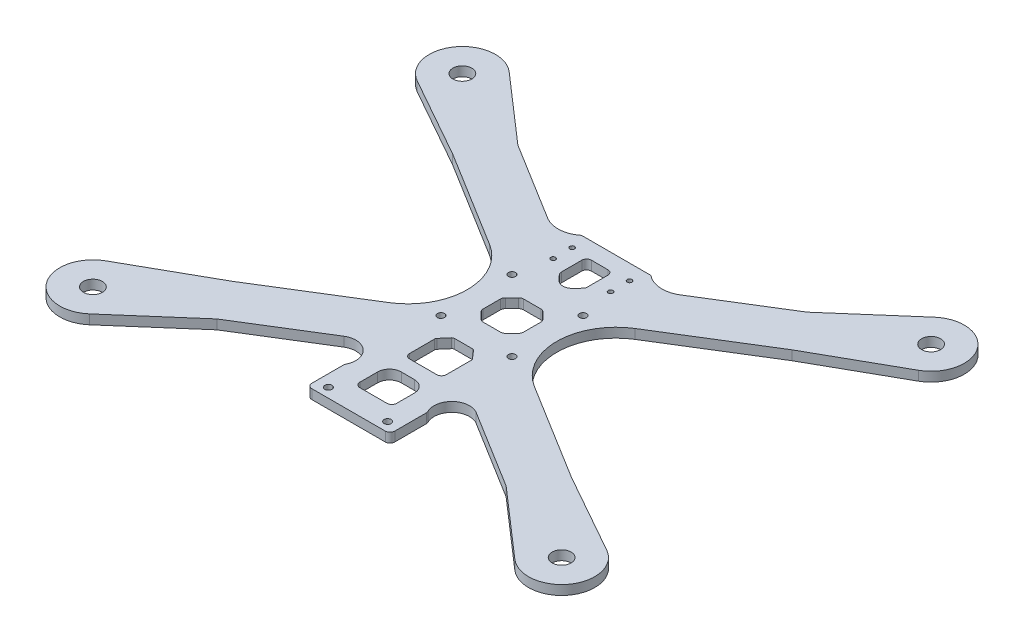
ISO-10303-21;
HEADER;
FILE_DESCRIPTION(('STEP AP214'),'2;1');
FILE_NAME('part.step','',(''),(''),'','','');
FILE_SCHEMA(('AUTOMOTIVE_DESIGN { 1 0 10303 214 1 1 1 1 }'));
ENDSEC;
DATA;
#1=APPLICATION_CONTEXT('core data for automotive mechanical design processes');
#2=APPLICATION_PROTOCOL_DEFINITION('international standard','automotive_design',2000,#1);
#3=PRODUCT_CONTEXT('',#1,'mechanical');
#4=PRODUCT('Part','Part','',(#3));
#5=PRODUCT_RELATED_PRODUCT_CATEGORY('part','',(#4));
#6=PRODUCT_DEFINITION_FORMATION('','',#4);
#7=PRODUCT_DEFINITION_CONTEXT('part definition',#1,'design');
#8=PRODUCT_DEFINITION('design','',#6,#7);
#9=PRODUCT_DEFINITION_SHAPE('','',#8);
#10=(LENGTH_UNIT() NAMED_UNIT(*) SI_UNIT(.MILLI.,.METRE.));
#11=(NAMED_UNIT(*) PLANE_ANGLE_UNIT() SI_UNIT($,.RADIAN.));
#12=(NAMED_UNIT(*) SI_UNIT($,.STERADIAN.) SOLID_ANGLE_UNIT());
#13=UNCERTAINTY_MEASURE_WITH_UNIT(LENGTH_MEASURE(1.E-05),#10,'distance_accuracy_value','');
#14=(GEOMETRIC_REPRESENTATION_CONTEXT(3) GLOBAL_UNCERTAINTY_ASSIGNED_CONTEXT((#13)) GLOBAL_UNIT_ASSIGNED_CONTEXT((#10,
#11,#12)) REPRESENTATION_CONTEXT('',''));
#15=CARTESIAN_POINT('',(0.,0.,0.));
#16=DIRECTION('',(0.,0.,1.));
#17=DIRECTION('',(1.,0.,0.));
#18=AXIS2_PLACEMENT_3D('',#15,#16,#17);
#19=CARTESIAN_POINT('',(-23.9999991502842,4002.,10565.2674668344));
#20=DIRECTION('',(0.,-1.,0.));
#21=DIRECTION('',(0.,0.,-1.));
#22=AXIS2_PLACEMENT_3D('',#19,#20,#21);
#23=PLANE('',#22);
#24=CARTESIAN_POINT('',(-5.75000000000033,4002.,10572.3361110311));
#25=DIRECTION('',(0.,1.,0.));
#26=DIRECTION('',(0.,0.,1.));
#27=AXIS2_PLACEMENT_3D('',#24,#25,#26);
#28=CIRCLE('',#27,2.);
#29=CARTESIAN_POINT('',(-7.75000000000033,4002.,10572.3361110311));
#30=VERTEX_POINT('',#29);
#31=CARTESIAN_POINT('',(-5.75000000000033,4002.,10574.3361110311));
#32=VERTEX_POINT('',#31);
#33=EDGE_CURVE('E993',#30,#32,#28,.T.);
#34=ORIENTED_EDGE('',*,*,#33,.F.);
#35=DIRECTION('',(0.,0.,1.));
#36=VECTOR('',#35,1.);
#37=CARTESIAN_POINT('',(-7.75000000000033,4002.,10564.8361110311));
#38=LINE('',#37,#36);
#39=CARTESIAN_POINT('',(-7.75000000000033,4002.,10564.8361110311));
#40=VERTEX_POINT('',#39);
#41=EDGE_CURVE('E1009',#40,#30,#38,.T.);
#42=ORIENTED_EDGE('',*,*,#41,.F.);
#43=CARTESIAN_POINT('',(-2.75000000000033,4002.,10564.8361110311));
#44=DIRECTION('',(0.,1.,0.));
#45=DIRECTION('',(0.,0.,1.));
#46=AXIS2_PLACEMENT_3D('',#43,#44,#45);
#47=CIRCLE('',#46,5.);
#48=CARTESIAN_POINT('',(-2.75000000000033,4002.,10559.8361110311));
#49=VERTEX_POINT('',#48);
#50=EDGE_CURVE('E1006',#49,#40,#47,.T.);
#51=ORIENTED_EDGE('',*,*,#50,.F.);
#52=DIRECTION('',(-1.,0.,0.));
#53=VECTOR('',#52,1.);
#54=CARTESIAN_POINT('',(2.74999999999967,4002.,10559.8361110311));
#55=LINE('',#54,#53);
#56=CARTESIAN_POINT('',(2.74999999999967,4002.,10559.8361110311));
#57=VERTEX_POINT('',#56);
#58=EDGE_CURVE('E1004',#57,#49,#55,.T.);
#59=ORIENTED_EDGE('',*,*,#58,.F.);
#60=CARTESIAN_POINT('',(2.74999999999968,4002.,10564.8361110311));
#61=DIRECTION('',(0.,1.,0.));
#62=DIRECTION('',(0.,0.,-1.));
#63=AXIS2_PLACEMENT_3D('',#60,#61,#62);
#64=CIRCLE('',#63,5.);
#65=CARTESIAN_POINT('',(7.74999999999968,4002.,10564.8361110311));
#66=VERTEX_POINT('',#65);
#67=EDGE_CURVE('E1002',#66,#57,#64,.T.);
#68=ORIENTED_EDGE('',*,*,#67,.F.);
#69=DIRECTION('',(0.,0.,-1.));
#70=VECTOR('',#69,1.);
#71=CARTESIAN_POINT('',(7.74999999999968,4002.,10564.8361110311));
#72=LINE('',#71,#70);
#73=CARTESIAN_POINT('',(7.74999999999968,4002.,10572.3361110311));
#74=VERTEX_POINT('',#73);
#75=EDGE_CURVE('E1000',#74,#66,#72,.T.);
#76=ORIENTED_EDGE('',*,*,#75,.F.);
#77=CARTESIAN_POINT('',(5.74999999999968,4002.,10572.3361110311));
#78=DIRECTION('',(0.,1.,0.));
#79=DIRECTION('',(0.,0.,-1.));
#80=AXIS2_PLACEMENT_3D('',#77,#78,#79);
#81=CIRCLE('',#80,2.);
#82=CARTESIAN_POINT('',(5.74999999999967,4002.,10574.3361110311));
#83=VERTEX_POINT('',#82);
#84=EDGE_CURVE('E998',#83,#74,#81,.T.);
#85=ORIENTED_EDGE('',*,*,#84,.F.);
#86=DIRECTION('',(1.,0.,0.));
#87=VECTOR('',#86,1.);
#88=CARTESIAN_POINT('',(-5.75000000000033,4002.,10574.3361110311));
#89=LINE('',#88,#87);
#90=EDGE_CURVE('E995',#32,#83,#89,.T.);
#91=ORIENTED_EDGE('',*,*,#90,.F.);
#92=EDGE_LOOP('',(#34,#42,#51,#59,#68,#76,#85,#91));
#93=FACE_BOUND('',#92,.T.);
#94=CARTESIAN_POINT('',(-14.9999999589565,4002.,10530.8361107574));
#95=DIRECTION('',(0.,1.,0.));
#96=DIRECTION('',(0.,0.,1.));
#97=AXIS2_PLACEMENT_3D('',#94,#95,#96);
#98=CIRCLE('',#97,1.49999959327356);
#99=CARTESIAN_POINT('',(-14.9999999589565,4002.,10532.3361103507));
#100=VERTEX_POINT('',#99);
#101=EDGE_CURVE('E1167',#100,#100,#98,.T.);
#102=ORIENTED_EDGE('',*,*,#101,.F.);
#103=EDGE_LOOP('',(#102));
#104=FACE_BOUND('',#103,.T.);
#105=CARTESIAN_POINT('',(-3.50000000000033,4002.,10480.8361110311));
#106=DIRECTION('',(0.,1.,0.));
#107=DIRECTION('',(0.,0.,1.));
#108=AXIS2_PLACEMENT_3D('',#105,#106,#107);
#109=CIRCLE('',#108,2.);
#110=CARTESIAN_POINT('',(-3.50000000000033,4002.,10478.8361110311));
#111=VERTEX_POINT('',#110);
#112=CARTESIAN_POINT('',(-5.50000000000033,4002.,10480.8361110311));
#113=VERTEX_POINT('',#112);
#114=EDGE_CURVE('E1173',#111,#113,#109,.T.);
#115=ORIENTED_EDGE('',*,*,#114,.F.);
#116=DIRECTION('',(-1.,0.,0.));
#117=VECTOR('',#116,1.);
#118=CARTESIAN_POINT('',(3.49999999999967,4002.,10478.8361110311));
#119=LINE('',#118,#117);
#120=CARTESIAN_POINT('',(3.49999999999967,4002.,10478.8361110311));
#121=VERTEX_POINT('',#120);
#122=EDGE_CURVE('E1195',#121,#111,#119,.T.);
#123=ORIENTED_EDGE('',*,*,#122,.F.);
#124=CARTESIAN_POINT('',(3.49999999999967,4002.,10480.8361110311));
#125=DIRECTION('',(0.,1.,0.));
#126=DIRECTION('',(0.,0.,-1.));
#127=AXIS2_PLACEMENT_3D('',#124,#125,#126);
#128=CIRCLE('',#127,2.);
#129=CARTESIAN_POINT('',(5.49999999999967,4002.,10480.8361110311));
#130=VERTEX_POINT('',#129);
#131=EDGE_CURVE('E1192',#130,#121,#128,.T.);
#132=ORIENTED_EDGE('',*,*,#131,.F.);
#133=DIRECTION('',(0.,0.,-1.));
#134=VECTOR('',#133,1.);
#135=CARTESIAN_POINT('',(5.49999999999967,4002.,10480.8361110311));
#136=LINE('',#135,#134);
#137=CARTESIAN_POINT('',(5.49999999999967,4002.,10489.5395564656));
#138=VERTEX_POINT('',#137);
#139=EDGE_CURVE('E1190',#138,#130,#136,.T.);
#140=ORIENTED_EDGE('',*,*,#139,.F.);
#141=CARTESIAN_POINT('',(3.50000004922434,4002.,10489.5395564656));
#142=DIRECTION('',(0.,1.,0.));
#143=DIRECTION('',(0.,0.,-1.));
#144=AXIS2_PLACEMENT_3D('',#141,#142,#143);
#145=CIRCLE('',#144,1.99999995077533);
#146=CARTESIAN_POINT('',(4.95236873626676,4002.,10490.9145564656));
#147=VERTEX_POINT('',#146);
#148=EDGE_CURVE('E1188',#147,#138,#145,.T.);
#149=ORIENTED_EDGE('',*,*,#148,.F.);
#150=DIRECTION('',(0.687500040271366,0.,-0.726184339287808));
#151=VECTOR('',#150,1.);
#152=CARTESIAN_POINT('',(2.90473747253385,4002.,10493.0774039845));
#153=LINE('',#152,#151);
#154=CARTESIAN_POINT('',(2.90473747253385,4002.,10493.0774039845));
#155=VERTEX_POINT('',#154);
#156=EDGE_CURVE('E1186',#155,#147,#153,.T.);
#157=ORIENTED_EDGE('',*,*,#156,.F.);
#158=CARTESIAN_POINT('',(-2.58946230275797E-07,4002.,10490.3274034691));
#159=DIRECTION('',(0.,1.,0.));
#160=DIRECTION('',(0.,0.,-1.));
#161=AXIS2_PLACEMENT_3D('',#158,#159,#160);
#162=CIRCLE('',#161,4.00000051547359);
#163=CARTESIAN_POINT('',(-3.30777206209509E-13,4002.,10494.3274039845));
#164=VERTEX_POINT('',#163);
#165=EDGE_CURVE('E1184',#164,#155,#162,.T.);
#166=ORIENTED_EDGE('',*,*,#165,.F.);
#167=CARTESIAN_POINT('',(2.58945566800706E-07,4002.,10490.3274034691));
#168=DIRECTION('',(0.,1.,0.));
#169=DIRECTION('',(0.,0.,1.));
#170=AXIS2_PLACEMENT_3D('',#167,#168,#169);
#171=CIRCLE('',#170,4.00000051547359);
#172=CARTESIAN_POINT('',(-2.90473747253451,4002.,10493.0774039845));
#173=VERTEX_POINT('',#172);
#174=EDGE_CURVE('E1182',#173,#164,#171,.T.);
#175=ORIENTED_EDGE('',*,*,#174,.F.);
#176=DIRECTION('',(0.687500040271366,0.,0.726184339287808));
#177=VECTOR('',#176,1.);
#178=CARTESIAN_POINT('',(-2.90473747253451,4002.,10493.0774039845));
#179=LINE('',#178,#177);
#180=CARTESIAN_POINT('',(-4.95236873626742,4002.,10490.9145564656));
#181=VERTEX_POINT('',#180);
#182=EDGE_CURVE('E1180',#181,#173,#179,.T.);
#183=ORIENTED_EDGE('',*,*,#182,.F.);
#184=CARTESIAN_POINT('',(-3.500000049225,4002.,10489.5395564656));
#185=DIRECTION('',(0.,1.,0.));
#186=DIRECTION('',(0.,0.,1.));
#187=AXIS2_PLACEMENT_3D('',#184,#185,#186);
#188=CIRCLE('',#187,1.99999995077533);
#189=CARTESIAN_POINT('',(-5.50000000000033,4002.,10489.5395564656));
#190=VERTEX_POINT('',#189);
#191=EDGE_CURVE('E1178',#190,#181,#188,.T.);
#192=ORIENTED_EDGE('',*,*,#191,.F.);
#193=DIRECTION('',(0.,0.,1.));
#194=VECTOR('',#193,1.);
#195=CARTESIAN_POINT('',(-5.50000000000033,4002.,10480.8361110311));
#196=LINE('',#195,#194);
#197=EDGE_CURVE('E1175',#113,#190,#196,.T.);
#198=ORIENTED_EDGE('',*,*,#197,.F.);
#199=EDGE_LOOP('',(#115,#123,#132,#140,#149,#157,#166,#175,#183,#192,#198));
#200=FACE_BOUND('',#199,.T.);
#201=CARTESIAN_POINT('',(-23.9999991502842,4002.,10565.2674668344));
#202=DIRECTION('',(0.,-1.,0.));
#203=DIRECTION('',(0.,0.,-1.));
#204=AXIS2_PLACEMENT_3D('',#201,#202,#203);
#205=CIRCLE('',#204,7.49999956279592);
#206=CARTESIAN_POINT('',(-27.9466037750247,4002.,10558.8898257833));
#207=VERTEX_POINT('',#206);
#208=CARTESIAN_POINT('',(-17.289474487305,4002.,10568.6169223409));
#209=VERTEX_POINT('',#208);
#210=EDGE_CURVE('E656',#207,#209,#205,.T.);
#211=ORIENTED_EDGE('',*,*,#210,.T.);
#212=CARTESIAN_POINT('',(-15.5000108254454,4002.,10569.5101056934));
#213=DIRECTION('',(0.,1.,0.));
#214=DIRECTION('',(0.,0.,-1.));
#215=AXIS2_PLACEMENT_3D('',#212,#213,#214);
#216=CIRCLE('',#215,1.9999891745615);
#217=CARTESIAN_POINT('',(-17.5000000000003,4002.,10569.5101108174));
#218=VERTEX_POINT('',#217);
#219=EDGE_CURVE('E741',#209,#218,#216,.T.);
#220=ORIENTED_EDGE('',*,*,#219,.T.);
#221=DIRECTION('',(0.,0.,1.));
#222=VECTOR('',#221,1.);
#223=CARTESIAN_POINT('',(-17.5000000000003,4002.,10569.5101108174));
#224=LINE('',#223,#222);
#225=CARTESIAN_POINT('',(-17.5000000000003,4002.,10582.8361110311));
#226=VERTEX_POINT('',#225);
#227=EDGE_CURVE('E612',#218,#226,#224,.T.);
#228=ORIENTED_EDGE('',*,*,#227,.T.);
#229=CARTESIAN_POINT('',(-15.5000016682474,4002.,10582.8361126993));
#230=DIRECTION('',(0.,1.,0.));
#231=DIRECTION('',(0.,0.,1.));
#232=AXIS2_PLACEMENT_3D('',#229,#230,#231);
#233=CIRCLE('',#232,1.9999983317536);
#234=CARTESIAN_POINT('',(-15.5000000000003,4002.,10584.8361110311));
#235=VERTEX_POINT('',#234);
#236=EDGE_CURVE('E744',#226,#235,#233,.T.);
#237=ORIENTED_EDGE('',*,*,#236,.T.);
#238=DIRECTION('',(1.,0.,0.));
#239=VECTOR('',#238,1.);
#240=CARTESIAN_POINT('',(-15.5000000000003,4002.,10584.8361110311));
#241=LINE('',#240,#239);
#242=CARTESIAN_POINT('',(15.4999999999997,4002.,10584.8361110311));
#243=VERTEX_POINT('',#242);
#244=EDGE_CURVE('E746',#235,#243,#241,.T.);
#245=ORIENTED_EDGE('',*,*,#244,.T.);
#246=CARTESIAN_POINT('',(15.5000016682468,4002.,10582.8361126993));
#247=DIRECTION('',(0.,1.,0.));
#248=DIRECTION('',(0.,0.,-1.));
#249=AXIS2_PLACEMENT_3D('',#246,#247,#248);
#250=CIRCLE('',#249,1.9999983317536);
#251=CARTESIAN_POINT('',(17.4999999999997,4002.,10582.8361110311));
#252=VERTEX_POINT('',#251);
#253=EDGE_CURVE('E748',#243,#252,#250,.T.);
#254=ORIENTED_EDGE('',*,*,#253,.T.);
#255=DIRECTION('',(0.,0.,-1.));
#256=VECTOR('',#255,1.);
#257=CARTESIAN_POINT('',(17.4999999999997,4002.,10569.5101108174));
#258=LINE('',#257,#256);
#259=CARTESIAN_POINT('',(17.4999999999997,4002.,10569.5101108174));
#260=VERTEX_POINT('',#259);
#261=EDGE_CURVE('E750',#252,#260,#258,.T.);
#262=ORIENTED_EDGE('',*,*,#261,.T.);
#263=CARTESIAN_POINT('',(15.5000108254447,4002.,10569.5101056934));
#264=DIRECTION('',(0.,1.,0.));
#265=DIRECTION('',(0.,0.,1.));
#266=AXIS2_PLACEMENT_3D('',#263,#264,#265);
#267=CIRCLE('',#266,1.99998917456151);
#268=CARTESIAN_POINT('',(17.2894744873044,4002.,10568.6169223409));
#269=VERTEX_POINT('',#268);
#270=EDGE_CURVE('E752',#260,#269,#267,.T.);
#271=ORIENTED_EDGE('',*,*,#270,.T.);
#272=CARTESIAN_POINT('',(23.9999991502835,4002.,10565.2674668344));
#273=DIRECTION('',(0.,-1.,0.));
#274=DIRECTION('',(0.,0.,1.));
#275=AXIS2_PLACEMENT_3D('',#272,#273,#274);
#276=CIRCLE('',#275,7.49999956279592);
#277=CARTESIAN_POINT('',(27.9466037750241,4002.,10558.8898257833));
#278=VERTEX_POINT('',#277);
#279=EDGE_CURVE('E754',#269,#278,#276,.T.);
#280=ORIENTED_EDGE('',*,*,#279,.T.);
#281=DIRECTION('',(0.85035218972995,0.,0.52621398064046));
#282=VECTOR('',#281,1.);
#283=CARTESIAN_POINT('',(61.065334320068,4002.,10579.3843211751));
#284=LINE('',#283,#282);
#285=CARTESIAN_POINT('',(61.065334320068,4002.,10579.3843211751));
#286=VERTEX_POINT('',#285);
#287=EDGE_CURVE('E756',#278,#286,#284,.T.);
#288=ORIENTED_EDGE('',*,*,#287,.T.);
#289=DIRECTION('',(0.753858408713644,0.,0.657036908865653));
#290=VECTOR('',#289,1.);
#291=CARTESIAN_POINT('',(61.0653343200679,4002.,10579.3843211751));
#292=LINE('',#291,#290);
#293=CARTESIAN_POINT('',(89.7560182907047,4002.,10604.390128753));
#294=VERTEX_POINT('',#293);
#295=EDGE_CURVE('E846',#286,#294,#292,.T.);
#296=ORIENTED_EDGE('',*,*,#295,.T.);
#297=CARTESIAN_POINT('',(98.9545350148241,4002.,10593.8361110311));
#298=DIRECTION('',(0.,1.,0.));
#299=DIRECTION('',(0.,0.,1.));
#300=AXIS2_PLACEMENT_3D('',#297,#298,#299);
#301=CIRCLE('',#300,13.9999999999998);
#302=CARTESIAN_POINT('',(105.819059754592,4002.,10581.6345414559));
#303=VERTEX_POINT('',#302);
#304=EDGE_CURVE('E842',#294,#303,#301,.T.);
#305=ORIENTED_EDGE('',*,*,#304,.T.);
#306=DIRECTION('',(-0.871540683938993,0.,-0.490323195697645));
#307=VECTOR('',#306,1.);
#308=CARTESIAN_POINT('',(71.5896148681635,4002.,10562.3772754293));
#309=LINE('',#308,#307);
#310=CARTESIAN_POINT('',(71.5896148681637,4002.,10562.3772754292));
#311=VERTEX_POINT('',#310);
#312=EDGE_CURVE('E849',#303,#311,#309,.T.);
#313=ORIENTED_EDGE('',*,*,#312,.T.);
#314=DIRECTION('',(-0.850352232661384,0.,-0.526213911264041));
#315=VECTOR('',#314,1.);
#316=CARTESIAN_POINT('',(30.7337779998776,4002.,10537.0949172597));
#317=LINE('',#316,#315);
#318=CARTESIAN_POINT('',(30.7337779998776,4002.,10537.0949172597));
#319=VERTEX_POINT('',#318);
#320=EDGE_CURVE('E758',#311,#319,#317,.T.);
#321=ORIENTED_EDGE('',*,*,#320,.T.);
#322=CARTESIAN_POINT('',(43.88912574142,4002.,10515.8361115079));
#323=DIRECTION('',(0.,-1.,0.));
#324=DIRECTION('',(0.,0.,1.));
#325=AXIS2_PLACEMENT_3D('',#322,#323,#324);
#326=CIRCLE('',#325,24.9999999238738);
#327=CARTESIAN_POINT('',(30.7337779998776,4002.,10494.5773057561));
#328=VERTEX_POINT('',#327);
#329=EDGE_CURVE('E760',#319,#328,#326,.T.);
#330=ORIENTED_EDGE('',*,*,#329,.T.);
#331=DIRECTION('',(0.850352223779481,0.,-0.526213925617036));
#332=VECTOR('',#331,1.);
#333=CARTESIAN_POINT('',(71.5896148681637,4002.,10469.2949466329));
#334=LINE('',#333,#332);
#335=CARTESIAN_POINT('',(71.5896148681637,4002.,10469.2949466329));
#336=VERTEX_POINT('',#335);
#337=EDGE_CURVE('E762',#328,#336,#334,.T.);
#338=ORIENTED_EDGE('',*,*,#337,.T.);
#339=DIRECTION('',(0.871540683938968,0.,-0.490323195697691));
#340=VECTOR('',#339,1.);
#341=CARTESIAN_POINT('',(105.819059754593,4002.,10450.0376806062));
#342=LINE('',#341,#340);
#343=CARTESIAN_POINT('',(105.819059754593,4002.,10450.0376806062));
#344=VERTEX_POINT('',#343);
#345=EDGE_CURVE('E568',#336,#344,#342,.T.);
#346=ORIENTED_EDGE('',*,*,#345,.T.);
#347=CARTESIAN_POINT('',(98.9545350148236,4002.,10437.8361110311));
#348=DIRECTION('',(0.,1.,0.));
#349=DIRECTION('',(0.,0.,-1.));
#350=AXIS2_PLACEMENT_3D('',#347,#348,#349);
#351=CIRCLE('',#350,14.0000000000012);
#352=CARTESIAN_POINT('',(89.756018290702,4002.,10427.2820933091));
#353=VERTEX_POINT('',#352);
#354=EDGE_CURVE('E1687',#344,#353,#351,.T.);
#355=ORIENTED_EDGE('',*,*,#354,.T.);
#356=DIRECTION('',(-0.753858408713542,0.,0.65703690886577));
#357=VECTOR('',#356,1.);
#358=CARTESIAN_POINT('',(61.0653343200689,4002.,10452.287900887));
#359=LINE('',#358,#357);
#360=CARTESIAN_POINT('',(61.065334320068,4002.,10452.287900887));
#361=VERTEX_POINT('',#360);
#362=EDGE_CURVE('E769',#353,#361,#359,.T.);
#363=ORIENTED_EDGE('',*,*,#362,.T.);
#364=DIRECTION('',(-0.850352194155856,0.,0.526213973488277));
#365=VECTOR('',#364,1.);
#366=CARTESIAN_POINT('',(61.065334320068,4002.,10452.287900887));
#367=LINE('',#366,#365);
#368=CARTESIAN_POINT('',(27.9089813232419,4002.,10472.8056773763));
#369=VERTEX_POINT('',#368);
#370=EDGE_CURVE('E764',#361,#369,#367,.T.);
#371=ORIENTED_EDGE('',*,*,#370,.T.);
#372=CARTESIAN_POINT('',(21.9592777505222,4002.,10462.9619041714));
#373=DIRECTION('',(0.,-1.,0.));
#374=DIRECTION('',(0.,0.,-1.));
#375=AXIS2_PLACEMENT_3D('',#372,#373,#374);
#376=CIRCLE('',#375,11.5021234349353);
#377=CARTESIAN_POINT('',(14.6416759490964,4002.,10471.8361110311));
#378=VERTEX_POINT('',#377);
#379=EDGE_CURVE('E692',#369,#378,#376,.T.);
#380=ORIENTED_EDGE('',*,*,#379,.T.);
#381=DIRECTION('',(-1.,0.,0.));
#382=VECTOR('',#381,1.);
#383=CARTESIAN_POINT('',(-14.641675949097,4002.,10471.8361110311));
#384=LINE('',#383,#382);
#385=CARTESIAN_POINT('',(-14.641675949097,4002.,10471.8361110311));
#386=VERTEX_POINT('',#385);
#387=EDGE_CURVE('E711',#378,#386,#384,.T.);
#388=ORIENTED_EDGE('',*,*,#387,.T.);
#389=CARTESIAN_POINT('',(-21.9592777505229,4002.,10462.9619041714));
#390=DIRECTION('',(0.,-1.,0.));
#391=DIRECTION('',(0.,0.,1.));
#392=AXIS2_PLACEMENT_3D('',#389,#390,#391);
#393=CIRCLE('',#392,11.5021234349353);
#394=CARTESIAN_POINT('',(-27.9089813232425,4002.,10472.8056773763));
#395=VERTEX_POINT('',#394);
#396=EDGE_CURVE('E707',#386,#395,#393,.T.);
#397=ORIENTED_EDGE('',*,*,#396,.T.);
#398=DIRECTION('',(-0.850352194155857,0.,-0.526213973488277));
#399=VECTOR('',#398,1.);
#400=CARTESIAN_POINT('',(-61.0653343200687,4002.,10452.287900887));
#401=LINE('',#400,#399);
#402=CARTESIAN_POINT('',(-61.0653343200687,4002.,10452.287900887));
#403=VERTEX_POINT('',#402);
#404=EDGE_CURVE('E710',#395,#403,#401,.T.);
#405=ORIENTED_EDGE('',*,*,#404,.T.);
#406=DIRECTION('',(-0.753858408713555,0.,-0.657036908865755));
#407=VECTOR('',#406,1.);
#408=CARTESIAN_POINT('',(-61.0653343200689,4002.,10452.287900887));
#409=LINE('',#408,#407);
#410=CARTESIAN_POINT('',(-89.7560182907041,4002.,10427.2820933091));
#411=VERTEX_POINT('',#410);
#412=EDGE_CURVE('E821',#403,#411,#409,.T.);
#413=ORIENTED_EDGE('',*,*,#412,.T.);
#414=CARTESIAN_POINT('',(-98.9545350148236,4002.,10437.8361110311));
#415=DIRECTION('',(0.,1.,0.));
#416=DIRECTION('',(0.,0.,1.));
#417=AXIS2_PLACEMENT_3D('',#414,#415,#416);
#418=CIRCLE('',#417,14.0000000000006);
#419=CARTESIAN_POINT('',(-105.819059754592,4002.,10450.0376806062));
#420=VERTEX_POINT('',#419);
#421=EDGE_CURVE('E818',#411,#420,#418,.T.);
#422=ORIENTED_EDGE('',*,*,#421,.T.);
#423=DIRECTION('',(0.871540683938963,0.,0.4903231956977));
#424=VECTOR('',#423,1.);
#425=CARTESIAN_POINT('',(-105.819059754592,4002.,10450.0376806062));
#426=LINE('',#425,#424);
#427=CARTESIAN_POINT('',(-71.5896148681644,4002.,10469.2949466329));
#428=VERTEX_POINT('',#427);
#429=EDGE_CURVE('E814',#420,#428,#426,.T.);
#430=ORIENTED_EDGE('',*,*,#429,.T.);
#431=DIRECTION('',(0.850352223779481,0.,0.526213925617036));
#432=VECTOR('',#431,1.);
#433=CARTESIAN_POINT('',(-71.5896148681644,4002.,10469.2949466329));
#434=LINE('',#433,#432);
#435=CARTESIAN_POINT('',(-30.7337779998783,4002.,10494.5773057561));
#436=VERTEX_POINT('',#435);
#437=EDGE_CURVE('E713',#428,#436,#434,.T.);
#438=ORIENTED_EDGE('',*,*,#437,.T.);
#439=CARTESIAN_POINT('',(-43.8891257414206,4002.,10515.8361115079));
#440=DIRECTION('',(0.,-1.,0.));
#441=DIRECTION('',(0.,0.,-1.));
#442=AXIS2_PLACEMENT_3D('',#439,#440,#441);
#443=CIRCLE('',#442,24.9999999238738);
#444=CARTESIAN_POINT('',(-30.7337779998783,4002.,10537.0949172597));
#445=VERTEX_POINT('',#444);
#446=EDGE_CURVE('E719',#436,#445,#443,.T.);
#447=ORIENTED_EDGE('',*,*,#446,.T.);
#448=DIRECTION('',(-0.850352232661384,0.,0.526213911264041));
#449=VECTOR('',#448,1.);
#450=CARTESIAN_POINT('',(-30.7337779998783,4002.,10537.0949172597));
#451=LINE('',#450,#449);
#452=CARTESIAN_POINT('',(-71.5896148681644,4002.,10562.3772754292));
#453=VERTEX_POINT('',#452);
#454=EDGE_CURVE('E721',#445,#453,#451,.T.);
#455=ORIENTED_EDGE('',*,*,#454,.T.);
#456=DIRECTION('',(-0.871540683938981,0.,0.490323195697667));
#457=VECTOR('',#456,1.);
#458=CARTESIAN_POINT('',(-71.5896148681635,4002.,10562.3772754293));
#459=LINE('',#458,#457);
#460=CARTESIAN_POINT('',(-105.819059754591,4002.,10581.6345414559));
#461=VERTEX_POINT('',#460);
#462=EDGE_CURVE('E785',#453,#461,#459,.T.);
#463=ORIENTED_EDGE('',*,*,#462,.T.);
#464=CARTESIAN_POINT('',(-98.9545350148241,4002.,10593.8361110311));
#465=DIRECTION('',(0.,1.,0.));
#466=DIRECTION('',(0.,0.,-1.));
#467=AXIS2_PLACEMENT_3D('',#464,#465,#466);
#468=CIRCLE('',#467,13.999999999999);
#469=CARTESIAN_POINT('',(-89.7560182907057,4002.,10604.390128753));
#470=VERTEX_POINT('',#469);
#471=EDGE_CURVE('E792',#461,#470,#468,.T.);
#472=ORIENTED_EDGE('',*,*,#471,.T.);
#473=DIRECTION('',(0.753858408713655,0.,-0.657036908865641));
#474=VECTOR('',#473,1.);
#475=CARTESIAN_POINT('',(-61.0653343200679,4002.,10579.3843211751));
#476=LINE('',#475,#474);
#477=CARTESIAN_POINT('',(-61.0653343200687,4002.,10579.3843211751));
#478=VERTEX_POINT('',#477);
#479=EDGE_CURVE('E789',#470,#478,#476,.T.);
#480=ORIENTED_EDGE('',*,*,#479,.T.);
#481=DIRECTION('',(0.85035218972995,0.,-0.52621398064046));
#482=VECTOR('',#481,1.);
#483=CARTESIAN_POINT('',(-61.0653343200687,4002.,10579.3843211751));
#484=LINE('',#483,#482);
#485=EDGE_CURVE('E661',#478,#207,#484,.T.);
#486=ORIENTED_EDGE('',*,*,#485,.T.);
#487=EDGE_LOOP('',(#211,#220,#228,#237,#245,#254,#262,#271,#280,#288,#296,#305,#313,#321,#330,
#338,#346,#355,#363,#371,#380,#388,#397,#405,#413,#422,#430,#438,#447,#455,#463,#472,#480,#486));
#488=FACE_BOUND('',#487,.T.);
#489=CARTESIAN_POINT('',(-14.999999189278,4002.,10500.8361110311));
#490=DIRECTION('',(0.,1.,0.));
#491=DIRECTION('',(0.,0.,1.));
#492=AXIS2_PLACEMENT_3D('',#489,#490,#491);
#493=CIRCLE('',#492,1.50000018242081);
#494=CARTESIAN_POINT('',(-14.999999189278,4002.,10502.3361112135));
#495=VERTEX_POINT('',#494);
#496=EDGE_CURVE('E724',#495,#495,#493,.T.);
#497=ORIENTED_EDGE('',*,*,#496,.F.);
#498=EDGE_LOOP('',(#497));
#499=FACE_BOUND('',#498,.T.);
#500=CARTESIAN_POINT('',(12.1249996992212,4002.,10486.3361110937));
#501=DIRECTION('',(0.,1.,0.));
#502=DIRECTION('',(0.,0.,-1.));
#503=AXIS2_PLACEMENT_3D('',#500,#501,#502);
#504=CIRCLE('',#503,1.0000001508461);
#505=CARTESIAN_POINT('',(12.1249996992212,4002.,10485.3361109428));
#506=VERTEX_POINT('',#505);
#507=EDGE_CURVE('E733',#506,#506,#504,.T.);
#508=ORIENTED_EDGE('',*,*,#507,.F.);
#509=EDGE_LOOP('',(#508));
#510=FACE_BOUND('',#509,.T.);
#511=CARTESIAN_POINT('',(-6.50000052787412,4002.,10512.1645379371));
#512=DIRECTION('',(0.,1.,0.));
#513=DIRECTION('',(0.,0.,1.));
#514=AXIS2_PLACEMENT_3D('',#511,#512,#513);
#515=CIRCLE('',#514,1.99999947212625);
#516=CARTESIAN_POINT('',(-7.91421365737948,4002.,10510.7503246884));
#517=VERTEX_POINT('',#516);
#518=CARTESIAN_POINT('',(-8.50000000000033,4002.,10512.1645383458));
#519=VERTEX_POINT('',#518);
#520=EDGE_CURVE('E1052',#517,#519,#515,.T.);
#521=ORIENTED_EDGE('',*,*,#520,.F.);
#522=DIRECTION('',(-0.707106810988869,0.,0.707106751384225));
#523=VECTOR('',#522,1.);
#524=CARTESIAN_POINT('',(-7.91421365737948,4002.,10510.7503246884));
#525=LINE('',#524,#523);
#526=CARTESIAN_POINT('',(-5.08578634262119,4002.,10507.9218976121));
#527=VERTEX_POINT('',#526);
#528=EDGE_CURVE('E1084',#527,#517,#525,.T.);
#529=ORIENTED_EDGE('',*,*,#528,.F.);
#530=CARTESIAN_POINT('',(-3.67157292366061,4002.,10509.3361103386));
#531=DIRECTION('',(0.,1.,0.));
#532=DIRECTION('',(0.,0.,1.));
#533=AXIS2_PLACEMENT_3D('',#530,#531,#532);
#534=CIRCLE('',#533,1.99999930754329);
#535=CARTESIAN_POINT('',(-3.67157292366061,4002.,10507.3361110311));
#536=VERTEX_POINT('',#535);
#537=EDGE_CURVE('E1081',#536,#527,#534,.T.);
#538=ORIENTED_EDGE('',*,*,#537,.F.);
#539=DIRECTION('',(-1.,0.,0.));
#540=VECTOR('',#539,1.);
#541=CARTESIAN_POINT('',(3.67157292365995,4002.,10507.3361110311));
#542=LINE('',#541,#540);
#543=CARTESIAN_POINT('',(3.67157292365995,4002.,10507.3361110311));
#544=VERTEX_POINT('',#543);
#545=EDGE_CURVE('E1079',#544,#536,#542,.T.);
#546=ORIENTED_EDGE('',*,*,#545,.F.);
#547=CARTESIAN_POINT('',(3.67157292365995,4002.,10509.3361103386));
#548=DIRECTION('',(0.,1.,0.));
#549=DIRECTION('',(0.,0.,-1.));
#550=AXIS2_PLACEMENT_3D('',#547,#548,#549);
#551=CIRCLE('',#550,1.99999930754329);
#552=CARTESIAN_POINT('',(5.08578634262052,4002.,10507.9218976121));
#553=VERTEX_POINT('',#552);
#554=EDGE_CURVE('E1077',#553,#544,#551,.T.);
#555=ORIENTED_EDGE('',*,*,#554,.F.);
#556=DIRECTION('',(-0.707106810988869,0.,-0.707106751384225));
#557=VECTOR('',#556,1.);
#558=CARTESIAN_POINT('',(7.91421365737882,4002.,10510.7503246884));
#559=LINE('',#558,#557);
#560=CARTESIAN_POINT('',(7.91421365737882,4002.,10510.7503246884));
#561=VERTEX_POINT('',#560);
#562=EDGE_CURVE('E1075',#561,#553,#559,.T.);
#563=ORIENTED_EDGE('',*,*,#562,.F.);
#564=CARTESIAN_POINT('',(6.50000052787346,4002.,10512.1645379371));
#565=DIRECTION('',(0.,1.,0.));
#566=DIRECTION('',(0.,0.,-1.));
#567=AXIS2_PLACEMENT_3D('',#564,#565,#566);
#568=CIRCLE('',#567,1.99999947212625);
#569=CARTESIAN_POINT('',(8.49999999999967,4002.,10512.1645383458));
#570=VERTEX_POINT('',#569);
#571=EDGE_CURVE('E1073',#570,#561,#568,.T.);
#572=ORIENTED_EDGE('',*,*,#571,.F.);
#573=DIRECTION('',(0.,0.,-1.));
#574=VECTOR('',#573,1.);
#575=CARTESIAN_POINT('',(8.49999999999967,4002.,10519.5076837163));
#576=LINE('',#575,#574);
#577=CARTESIAN_POINT('',(8.49999999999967,4002.,10519.5076837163));
#578=VERTEX_POINT('',#577);
#579=EDGE_CURVE('E1071',#578,#570,#576,.T.);
#580=ORIENTED_EDGE('',*,*,#579,.F.);
#581=CARTESIAN_POINT('',(6.49999839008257,4002.,10519.5076837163));
#582=DIRECTION('',(0.,1.,0.));
#583=DIRECTION('',(0.,0.,-1.));
#584=AXIS2_PLACEMENT_3D('',#581,#582,#583);
#585=CIRCLE('',#584,2.0000016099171);
#586=CARTESIAN_POINT('',(7.91421365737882,4002.,10520.9218978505));
#587=VERTEX_POINT('',#586);
#588=EDGE_CURVE('E1069',#587,#578,#585,.T.);
#589=ORIENTED_EDGE('',*,*,#588,.F.);
#590=DIRECTION('',(0.707106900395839,0.,-0.707106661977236));
#591=VECTOR('',#590,1.);
#592=CARTESIAN_POINT('',(7.91421365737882,4002.,10520.9218978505));
#593=LINE('',#592,#591);
#594=CARTESIAN_POINT('',(5.08578634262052,4002.,10523.7503242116));
#595=VERTEX_POINT('',#594);
#596=EDGE_CURVE('E1067',#595,#587,#593,.T.);
#597=ORIENTED_EDGE('',*,*,#596,.F.);
#598=CARTESIAN_POINT('',(3.6715715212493,4002.,10522.3361089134));
#599=DIRECTION('',(0.,1.,0.));
#600=DIRECTION('',(0.,0.,-1.));
#601=AXIS2_PLACEMENT_3D('',#598,#599,#600);
#602=CIRCLE('',#601,2.00000211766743);
#603=CARTESIAN_POINT('',(3.67157292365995,4002.,10524.3361110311));
#604=VERTEX_POINT('',#603);
#605=EDGE_CURVE('E1065',#604,#595,#602,.T.);
#606=ORIENTED_EDGE('',*,*,#605,.F.);
#607=DIRECTION('',(1.,0.,0.));
#608=VECTOR('',#607,1.);
#609=CARTESIAN_POINT('',(-3.67157292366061,4002.,10524.3361110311));
#610=LINE('',#609,#608);
#611=CARTESIAN_POINT('',(-3.67157292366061,4002.,10524.3361110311));
#612=VERTEX_POINT('',#611);
#613=EDGE_CURVE('E1063',#612,#604,#610,.T.);
#614=ORIENTED_EDGE('',*,*,#613,.F.);
#615=CARTESIAN_POINT('',(-3.67157152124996,4002.,10522.3361089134));
#616=DIRECTION('',(0.,1.,0.));
#617=DIRECTION('',(0.,0.,1.));
#618=AXIS2_PLACEMENT_3D('',#615,#616,#617);
#619=CIRCLE('',#618,2.00000211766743);
#620=CARTESIAN_POINT('',(-5.08578634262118,4002.,10523.7503242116));
#621=VERTEX_POINT('',#620);
#622=EDGE_CURVE('E1061',#621,#612,#619,.T.);
#623=ORIENTED_EDGE('',*,*,#622,.F.);
#624=DIRECTION('',(0.707106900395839,0.,0.707106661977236));
#625=VECTOR('',#624,1.);
#626=CARTESIAN_POINT('',(-7.91421365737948,4002.,10520.9218978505));
#627=LINE('',#626,#625);
#628=CARTESIAN_POINT('',(-7.91421365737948,4002.,10520.9218978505));
#629=VERTEX_POINT('',#628);
#630=EDGE_CURVE('E1059',#629,#621,#627,.T.);
#631=ORIENTED_EDGE('',*,*,#630,.F.);
#632=CARTESIAN_POINT('',(-6.49999839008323,4002.,10519.5076837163));
#633=DIRECTION('',(0.,1.,0.));
#634=DIRECTION('',(0.,0.,1.));
#635=AXIS2_PLACEMENT_3D('',#632,#633,#634);
#636=CIRCLE('',#635,2.0000016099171);
#637=CARTESIAN_POINT('',(-8.50000000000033,4002.,10519.5076837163));
#638=VERTEX_POINT('',#637);
#639=EDGE_CURVE('E1057',#638,#629,#636,.T.);
#640=ORIENTED_EDGE('',*,*,#639,.F.);
#641=DIRECTION('',(0.,0.,1.));
#642=VECTOR('',#641,1.);
#643=CARTESIAN_POINT('',(-8.50000000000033,4002.,10519.5076837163));
#644=LINE('',#643,#642);
#645=EDGE_CURVE('E1054',#519,#638,#644,.T.);
#646=ORIENTED_EDGE('',*,*,#645,.F.);
#647=EDGE_LOOP('',(#521,#529,#538,#546,#555,#563,#572,#580,#589,#597,#606,#614,#623,#631,#640,#646));
#648=FACE_BOUND('',#647,.T.);
#649=CARTESIAN_POINT('',(-5.75000000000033,4002.,10551.3361110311));
#650=DIRECTION('',(0.,1.,0.));
#651=DIRECTION('',(0.,0.,1.));
#652=AXIS2_PLACEMENT_3D('',#649,#650,#651);
#653=CIRCLE('',#652,2.);
#654=CARTESIAN_POINT('',(-7.75000000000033,4002.,10551.3361110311));
#655=VERTEX_POINT('',#654);
#656=CARTESIAN_POINT('',(-5.75000000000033,4002.,10553.3361110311));
#657=VERTEX_POINT('',#656);
#658=EDGE_CURVE('E911',#655,#657,#653,.T.);
#659=ORIENTED_EDGE('',*,*,#658,.F.);
#660=DIRECTION('',(0.,0.,1.));
#661=VECTOR('',#660,1.);
#662=CARTESIAN_POINT('',(-7.75000000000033,4002.,10540.7079181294));
#663=LINE('',#662,#661);
#664=CARTESIAN_POINT('',(-7.75000000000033,4002.,10540.7079181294));
#665=VERTEX_POINT('',#664);
#666=EDGE_CURVE('E934',#665,#655,#663,.T.);
#667=ORIENTED_EDGE('',*,*,#666,.F.);
#668=CARTESIAN_POINT('',(-6.75000406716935,4002.,10540.7079181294));
#669=DIRECTION('',(0.,1.,0.));
#670=DIRECTION('',(0.,0.,1.));
#671=AXIS2_PLACEMENT_3D('',#668,#669,#670);
#672=CIRCLE('',#671,0.999995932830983);
#673=CARTESIAN_POINT('',(-7.50709676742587,4002.,10540.0546168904));
#674=VERTEX_POINT('',#673);
#675=EDGE_CURVE('E932',#674,#665,#672,.T.);
#676=ORIENTED_EDGE('',*,*,#675,.F.);
#677=DIRECTION('',(-0.653302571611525,0.,0.75709692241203));
#678=VECTOR('',#677,1.);
#679=CARTESIAN_POINT('',(-4.59754657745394,4002.,10536.6828078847));
#680=LINE('',#679,#678);
#681=CARTESIAN_POINT('',(-4.59754657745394,4002.,10536.6828078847));
#682=VERTEX_POINT('',#681);
#683=EDGE_CURVE('E930',#682,#674,#680,.T.);
#684=ORIENTED_EDGE('',*,*,#683,.F.);
#685=CARTESIAN_POINT('',(-3.84045091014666,4002.,10537.3361093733));
#686=DIRECTION('',(0.,1.,0.));
#687=DIRECTION('',(0.,0.,1.));
#688=AXIS2_PLACEMENT_3D('',#685,#686,#687);
#689=CIRCLE('',#688,0.999998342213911);
#690=CARTESIAN_POINT('',(-3.84044981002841,4002.,10536.3361110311));
#691=VERTEX_POINT('',#690);
#692=EDGE_CURVE('E928',#691,#682,#689,.T.);
#693=ORIENTED_EDGE('',*,*,#692,.F.);
#694=DIRECTION('',(-1.,0.,0.));
#695=VECTOR('',#694,1.);
#696=CARTESIAN_POINT('',(3.84044981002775,4002.,10536.3361110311));
#697=LINE('',#696,#695);
#698=CARTESIAN_POINT('',(3.84044981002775,4002.,10536.3361110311));
#699=VERTEX_POINT('',#698);
#700=EDGE_CURVE('E926',#699,#691,#697,.T.);
#701=ORIENTED_EDGE('',*,*,#700,.F.);
#702=CARTESIAN_POINT('',(3.840450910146,4002.,10537.3361093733));
#703=DIRECTION('',(0.,1.,0.));
#704=DIRECTION('',(0.,0.,-1.));
#705=AXIS2_PLACEMENT_3D('',#702,#703,#704);
#706=CIRCLE('',#705,0.999998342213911);
#707=CARTESIAN_POINT('',(4.59754657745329,4002.,10536.6828078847));
#708=VERTEX_POINT('',#707);
#709=EDGE_CURVE('E924',#708,#699,#706,.T.);
#710=ORIENTED_EDGE('',*,*,#709,.F.);
#711=DIRECTION('',(-0.653302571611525,0.,-0.75709692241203));
#712=VECTOR('',#711,1.);
#713=CARTESIAN_POINT('',(4.59754657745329,4002.,10536.6828078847));
#714=LINE('',#713,#712);
#715=CARTESIAN_POINT('',(7.50709676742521,4002.,10540.0546168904));
#716=VERTEX_POINT('',#715);
#717=EDGE_CURVE('E922',#716,#708,#714,.T.);
#718=ORIENTED_EDGE('',*,*,#717,.F.);
#719=CARTESIAN_POINT('',(6.75000406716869,4002.,10540.7079181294));
#720=DIRECTION('',(0.,1.,0.));
#721=DIRECTION('',(0.,0.,-1.));
#722=AXIS2_PLACEMENT_3D('',#719,#720,#721);
#723=CIRCLE('',#722,0.999995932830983);
#724=CARTESIAN_POINT('',(7.74999999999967,4002.,10540.7079181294));
#725=VERTEX_POINT('',#724);
#726=EDGE_CURVE('E920',#725,#716,#723,.T.);
#727=ORIENTED_EDGE('',*,*,#726,.F.);
#728=DIRECTION('',(0.,0.,-1.));
#729=VECTOR('',#728,1.);
#730=CARTESIAN_POINT('',(7.74999999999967,4002.,10540.7079181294));
#731=LINE('',#730,#729);
#732=CARTESIAN_POINT('',(7.74999999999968,4002.,10551.3361110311));
#733=VERTEX_POINT('',#732);
#734=EDGE_CURVE('E918',#733,#725,#731,.T.);
#735=ORIENTED_EDGE('',*,*,#734,.F.);
#736=CARTESIAN_POINT('',(5.74999999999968,4002.,10551.3361110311));
#737=DIRECTION('',(0.,1.,0.));
#738=DIRECTION('',(0.,0.,-1.));
#739=AXIS2_PLACEMENT_3D('',#736,#737,#738);
#740=CIRCLE('',#739,2.);
#741=CARTESIAN_POINT('',(5.74999999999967,4002.,10553.3361110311));
#742=VERTEX_POINT('',#741);
#743=EDGE_CURVE('E916',#742,#733,#740,.T.);
#744=ORIENTED_EDGE('',*,*,#743,.F.);
#745=DIRECTION('',(1.,0.,0.));
#746=VECTOR('',#745,1.);
#747=CARTESIAN_POINT('',(-5.75000000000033,4002.,10553.3361110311));
#748=LINE('',#747,#746);
#749=EDGE_CURVE('E913',#657,#742,#748,.T.);
#750=ORIENTED_EDGE('',*,*,#749,.F.);
#751=EDGE_LOOP('',(#659,#667,#676,#684,#693,#701,#710,#718,#727,#735,#744,#750));
#752=FACE_BOUND('',#751,.T.);
#753=CARTESIAN_POINT('',(-12.4999971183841,4002.,10580.8361120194));
#754=DIRECTION('',(0.,1.,0.));
#755=DIRECTION('',(0.,0.,1.));
#756=AXIS2_PLACEMENT_3D('',#753,#754,#755);
#757=CIRCLE('',#756,1.50000085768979);
#758=CARTESIAN_POINT('',(-12.4999971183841,4002.,10582.336112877));
#759=VERTEX_POINT('',#758);
#760=EDGE_CURVE('E906',#759,#759,#757,.T.);
#761=ORIENTED_EDGE('',*,*,#760,.F.);
#762=EDGE_LOOP('',(#761));
#763=FACE_BOUND('',#762,.T.);
#764=CARTESIAN_POINT('',(-12.1249999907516,4002.,10478.3361109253));
#765=DIRECTION('',(0.,1.,0.));
#766=DIRECTION('',(0.,0.,1.));
#767=AXIS2_PLACEMENT_3D('',#764,#765,#766);
#768=CIRCLE('',#767,1.00000026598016);
#769=CARTESIAN_POINT('',(-12.1249999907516,4002.,10479.3361111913));
#770=VERTEX_POINT('',#769);
#771=EDGE_CURVE('E900',#770,#770,#768,.T.);
#772=ORIENTED_EDGE('',*,*,#771,.F.);
#773=EDGE_LOOP('',(#772));
#774=FACE_BOUND('',#773,.T.);
#775=CARTESIAN_POINT('',(-12.1249996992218,4002.,10486.3361110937));
#776=DIRECTION('',(0.,1.,0.));
#777=DIRECTION('',(0.,0.,1.));
#778=AXIS2_PLACEMENT_3D('',#775,#776,#777);
#779=CIRCLE('',#778,1.0000001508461);
#780=CARTESIAN_POINT('',(-12.1249996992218,4002.,10487.3361112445));
#781=VERTEX_POINT('',#780);
#782=EDGE_CURVE('E894',#781,#781,#779,.T.);
#783=ORIENTED_EDGE('',*,*,#782,.F.);
#784=EDGE_LOOP('',(#783));
#785=FACE_BOUND('',#784,.T.);
#786=CARTESIAN_POINT('',(12.1249999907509,4002.,10478.3361109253));
#787=DIRECTION('',(0.,1.,0.));
#788=DIRECTION('',(0.,0.,-1.));
#789=AXIS2_PLACEMENT_3D('',#786,#787,#788);
#790=CIRCLE('',#789,1.00000026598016);
#791=CARTESIAN_POINT('',(12.1249999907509,4002.,10477.3361106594));
#792=VERTEX_POINT('',#791);
#793=EDGE_CURVE('E888',#792,#792,#790,.T.);
#794=ORIENTED_EDGE('',*,*,#793,.F.);
#795=EDGE_LOOP('',(#794));
#796=FACE_BOUND('',#795,.T.);
#797=CARTESIAN_POINT('',(12.4999971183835,4002.,10580.8361120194));
#798=DIRECTION('',(0.,1.,0.));
#799=DIRECTION('',(0.,0.,-1.));
#800=AXIS2_PLACEMENT_3D('',#797,#798,#799);
#801=CIRCLE('',#800,1.50000085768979);
#802=CARTESIAN_POINT('',(12.4999971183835,4002.,10579.3361111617));
#803=VERTEX_POINT('',#802);
#804=EDGE_CURVE('E882',#803,#803,#801,.T.);
#805=ORIENTED_EDGE('',*,*,#804,.F.);
#806=EDGE_LOOP('',(#805));
#807=FACE_BOUND('',#806,.T.);
#808=CARTESIAN_POINT('',(14.9999999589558,4002.,10530.8361107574));
#809=DIRECTION('',(0.,1.,0.));
#810=DIRECTION('',(0.,0.,-1.));
#811=AXIS2_PLACEMENT_3D('',#808,#809,#810);
#812=CIRCLE('',#811,1.49999959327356);
#813=CARTESIAN_POINT('',(14.9999999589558,4002.,10529.3361111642));
#814=VERTEX_POINT('',#813);
#815=EDGE_CURVE('E876',#814,#814,#812,.T.);
#816=ORIENTED_EDGE('',*,*,#815,.F.);
#817=EDGE_LOOP('',(#816));
#818=FACE_BOUND('',#817,.T.);
#819=CARTESIAN_POINT('',(14.9999991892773,4002.,10500.8361110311));
#820=DIRECTION('',(0.,1.,0.));
#821=DIRECTION('',(0.,0.,-1.));
#822=AXIS2_PLACEMENT_3D('',#819,#820,#821);
#823=CIRCLE('',#822,1.50000018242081);
#824=CARTESIAN_POINT('',(14.9999991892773,4002.,10499.3361108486));
#825=VERTEX_POINT('',#824);
#826=EDGE_CURVE('E870',#825,#825,#823,.T.);
#827=ORIENTED_EDGE('',*,*,#826,.F.);
#828=EDGE_LOOP('',(#827));
#829=FACE_BOUND('',#828,.T.);
#830=CARTESIAN_POINT('',(98.9545350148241,4002.,10593.8361110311));
#831=DIRECTION('',(0.,1.,0.));
#832=DIRECTION('',(0.,0.,1.));
#833=AXIS2_PLACEMENT_3D('',#830,#831,#832);
#834=CIRCLE('',#833,3.99999999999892);
#835=CARTESIAN_POINT('',(98.9545350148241,4002.,10597.8361110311));
#836=VERTEX_POINT('',#835);
#837=EDGE_CURVE('E852',#836,#836,#834,.T.);
#838=ORIENTED_EDGE('',*,*,#837,.F.);
#839=EDGE_LOOP('',(#838));
#840=FACE_BOUND('',#839,.T.);
#841=CARTESIAN_POINT('',(-98.9545350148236,4002.,10437.8361110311));
#842=DIRECTION('',(0.,1.,0.));
#843=DIRECTION('',(0.,0.,1.));
#844=AXIS2_PLACEMENT_3D('',#841,#842,#843);
#845=CIRCLE('',#844,3.99999999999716);
#846=CARTESIAN_POINT('',(-98.9545350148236,4002.,10441.8361110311));
#847=VERTEX_POINT('',#846);
#848=EDGE_CURVE('E824',#847,#847,#845,.T.);
#849=ORIENTED_EDGE('',*,*,#848,.F.);
#850=EDGE_LOOP('',(#849));
#851=FACE_BOUND('',#850,.T.);
#852=CARTESIAN_POINT('',(-98.9545350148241,4002.,10593.8361110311));
#853=DIRECTION('',(0.,1.,0.));
#854=DIRECTION('',(0.,0.,-1.));
#855=AXIS2_PLACEMENT_3D('',#852,#853,#854);
#856=CIRCLE('',#855,3.99999999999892);
#857=CARTESIAN_POINT('',(-98.9545350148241,4002.,10589.8361110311));
#858=VERTEX_POINT('',#857);
#859=EDGE_CURVE('E795',#858,#858,#856,.T.);
#860=ORIENTED_EDGE('',*,*,#859,.F.);
#861=EDGE_LOOP('',(#860));
#862=FACE_BOUND('',#861,.T.);
#863=CARTESIAN_POINT('',(98.9545350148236,4002.,10437.8361110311));
#864=DIRECTION('',(0.,1.,0.));
#865=DIRECTION('',(0.,0.,-1.));
#866=AXIS2_PLACEMENT_3D('',#863,#864,#865);
#867=CIRCLE('',#866,3.9999999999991);
#868=CARTESIAN_POINT('',(98.9545350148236,4002.,10433.8361110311));
#869=VERTEX_POINT('',#868);
#870=EDGE_CURVE('E784',#869,#869,#867,.T.);
#871=ORIENTED_EDGE('',*,*,#870,.F.);
#872=EDGE_LOOP('',(#871));
#873=FACE_BOUND('',#872,.T.);
#874=ADVANCED_FACE('F34',(#93,#104,#200,#488,#499,#510,#648,#752,#763,#774,#785,#796,#807,#818,
#829,#840,#851,#862,#873),#23,.F.);
#875=CARTESIAN_POINT('',(-23.9999991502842,3998.,10565.2674668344));
#876=DIRECTION('',(0.,-1.,0.));
#877=DIRECTION('',(0.,0.,-1.));
#878=AXIS2_PLACEMENT_3D('',#875,#876,#877);
#879=PLANE('',#878);
#880=CARTESIAN_POINT('',(14.9999999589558,3998.,10530.8361107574));
#881=DIRECTION('',(0.,1.,0.));
#882=DIRECTION('',(0.,0.,-1.));
#883=AXIS2_PLACEMENT_3D('',#880,#881,#882);
#884=CIRCLE('',#883,1.49999959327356);
#885=CARTESIAN_POINT('',(14.9999999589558,3998.,10529.3361111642));
#886=VERTEX_POINT('',#885);
#887=EDGE_CURVE('E873',#886,#886,#884,.T.);
#888=ORIENTED_EDGE('',*,*,#887,.T.);
#889=EDGE_LOOP('',(#888));
#890=FACE_BOUND('',#889,.T.);
#891=CARTESIAN_POINT('',(12.1249999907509,3998.,10478.3361109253));
#892=DIRECTION('',(0.,1.,0.));
#893=DIRECTION('',(0.,0.,-1.));
#894=AXIS2_PLACEMENT_3D('',#891,#892,#893);
#895=CIRCLE('',#894,1.00000026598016);
#896=CARTESIAN_POINT('',(12.1249999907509,3998.,10477.3361106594));
#897=VERTEX_POINT('',#896);
#898=EDGE_CURVE('E885',#897,#897,#895,.T.);
#899=ORIENTED_EDGE('',*,*,#898,.T.);
#900=EDGE_LOOP('',(#899));
#901=FACE_BOUND('',#900,.T.);
#902=CARTESIAN_POINT('',(-12.1249999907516,3998.,10478.3361109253));
#903=DIRECTION('',(0.,1.,0.));
#904=DIRECTION('',(0.,0.,1.));
#905=AXIS2_PLACEMENT_3D('',#902,#903,#904);
#906=CIRCLE('',#905,1.00000026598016);
#907=CARTESIAN_POINT('',(-12.1249999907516,3998.,10479.3361111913));
#908=VERTEX_POINT('',#907);
#909=EDGE_CURVE('E897',#908,#908,#906,.T.);
#910=ORIENTED_EDGE('',*,*,#909,.T.);
#911=EDGE_LOOP('',(#910));
#912=FACE_BOUND('',#911,.T.);
#913=DIRECTION('',(0.,0.,1.));
#914=VECTOR('',#913,1.);
#915=CARTESIAN_POINT('',(-7.75000000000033,3998.,10540.7079181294));
#916=LINE('',#915,#914);
#917=CARTESIAN_POINT('',(-7.75000000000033,3998.,10540.7079181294));
#918=VERTEX_POINT('',#917);
#919=CARTESIAN_POINT('',(-7.75000000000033,3998.,10551.3361110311));
#920=VERTEX_POINT('',#919);
#921=EDGE_CURVE('E914',#918,#920,#916,.T.);
#922=ORIENTED_EDGE('',*,*,#921,.T.);
#923=CARTESIAN_POINT('',(-5.75000000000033,3998.,10551.3361110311));
#924=DIRECTION('',(0.,1.,0.));
#925=DIRECTION('',(0.,0.,1.));
#926=AXIS2_PLACEMENT_3D('',#923,#924,#925);
#927=CIRCLE('',#926,2.);
#928=CARTESIAN_POINT('',(-5.75000000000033,3998.,10553.3361110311));
#929=VERTEX_POINT('',#928);
#930=EDGE_CURVE('E57',#920,#929,#927,.T.);
#931=ORIENTED_EDGE('',*,*,#930,.T.);
#932=DIRECTION('',(1.,0.,0.));
#933=VECTOR('',#932,1.);
#934=CARTESIAN_POINT('',(-5.75000000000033,3998.,10553.3361110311));
#935=LINE('',#934,#933);
#936=CARTESIAN_POINT('',(5.74999999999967,3998.,10553.3361110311));
#937=VERTEX_POINT('',#936);
#938=EDGE_CURVE('E938',#929,#937,#935,.T.);
#939=ORIENTED_EDGE('',*,*,#938,.T.);
#940=CARTESIAN_POINT('',(5.74999999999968,3998.,10551.3361110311));
#941=DIRECTION('',(0.,1.,0.));
#942=DIRECTION('',(0.,0.,-1.));
#943=AXIS2_PLACEMENT_3D('',#940,#941,#942);
#944=CIRCLE('',#943,2.);
#945=CARTESIAN_POINT('',(7.74999999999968,3998.,10551.3361110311));
#946=VERTEX_POINT('',#945);
#947=EDGE_CURVE('E941',#937,#946,#944,.T.);
#948=ORIENTED_EDGE('',*,*,#947,.T.);
#949=DIRECTION('',(0.,0.,-1.));
#950=VECTOR('',#949,1.);
#951=CARTESIAN_POINT('',(7.74999999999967,3998.,10540.7079181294));
#952=LINE('',#951,#950);
#953=CARTESIAN_POINT('',(7.74999999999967,3998.,10540.7079181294));
#954=VERTEX_POINT('',#953);
#955=EDGE_CURVE('E944',#946,#954,#952,.T.);
#956=ORIENTED_EDGE('',*,*,#955,.T.);
#957=CARTESIAN_POINT('',(6.75000406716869,3998.,10540.7079181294));
#958=DIRECTION('',(0.,1.,0.));
#959=DIRECTION('',(0.,0.,-1.));
#960=AXIS2_PLACEMENT_3D('',#957,#958,#959);
#961=CIRCLE('',#960,0.999995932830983);
#962=CARTESIAN_POINT('',(7.50709676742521,3998.,10540.0546168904));
#963=VERTEX_POINT('',#962);
#964=EDGE_CURVE('E947',#954,#963,#961,.T.);
#965=ORIENTED_EDGE('',*,*,#964,.T.);
#966=DIRECTION('',(-0.653302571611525,0.,-0.75709692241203));
#967=VECTOR('',#966,1.);
#968=CARTESIAN_POINT('',(4.59754657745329,3998.,10536.6828078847));
#969=LINE('',#968,#967);
#970=CARTESIAN_POINT('',(4.59754657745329,3998.,10536.6828078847));
#971=VERTEX_POINT('',#970);
#972=EDGE_CURVE('E950',#963,#971,#969,.T.);
#973=ORIENTED_EDGE('',*,*,#972,.T.);
#974=CARTESIAN_POINT('',(3.840450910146,3998.,10537.3361093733));
#975=DIRECTION('',(0.,1.,0.));
#976=DIRECTION('',(0.,0.,-1.));
#977=AXIS2_PLACEMENT_3D('',#974,#975,#976);
#978=CIRCLE('',#977,0.999998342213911);
#979=CARTESIAN_POINT('',(3.84044981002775,3998.,10536.3361110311));
#980=VERTEX_POINT('',#979);
#981=EDGE_CURVE('E953',#971,#980,#978,.T.);
#982=ORIENTED_EDGE('',*,*,#981,.T.);
#983=DIRECTION('',(-1.,0.,0.));
#984=VECTOR('',#983,1.);
#985=CARTESIAN_POINT('',(3.84044981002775,3998.,10536.3361110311));
#986=LINE('',#985,#984);
#987=CARTESIAN_POINT('',(-3.84044981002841,3998.,10536.3361110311));
#988=VERTEX_POINT('',#987);
#989=EDGE_CURVE('E956',#980,#988,#986,.T.);
#990=ORIENTED_EDGE('',*,*,#989,.T.);
#991=CARTESIAN_POINT('',(-3.84045091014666,3998.,10537.3361093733));
#992=DIRECTION('',(0.,1.,0.));
#993=DIRECTION('',(0.,0.,1.));
#994=AXIS2_PLACEMENT_3D('',#991,#992,#993);
#995=CIRCLE('',#994,0.999998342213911);
#996=CARTESIAN_POINT('',(-4.59754657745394,3998.,10536.6828078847));
#997=VERTEX_POINT('',#996);
#998=EDGE_CURVE('E959',#988,#997,#995,.T.);
#999=ORIENTED_EDGE('',*,*,#998,.T.);
#1000=DIRECTION('',(-0.653302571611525,0.,0.75709692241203));
#1001=VECTOR('',#1000,1.);
#1002=CARTESIAN_POINT('',(-4.59754657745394,3998.,10536.6828078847));
#1003=LINE('',#1002,#1001);
#1004=CARTESIAN_POINT('',(-7.50709676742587,3998.,10540.0546168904));
#1005=VERTEX_POINT('',#1004);
#1006=EDGE_CURVE('E962',#997,#1005,#1003,.T.);
#1007=ORIENTED_EDGE('',*,*,#1006,.T.);
#1008=CARTESIAN_POINT('',(-6.75000406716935,3998.,10540.7079181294));
#1009=DIRECTION('',(0.,1.,0.));
#1010=DIRECTION('',(0.,0.,1.));
#1011=AXIS2_PLACEMENT_3D('',#1008,#1009,#1010);
#1012=CIRCLE('',#1011,0.999995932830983);
#1013=EDGE_CURVE('E965',#1005,#918,#1012,.T.);
#1014=ORIENTED_EDGE('',*,*,#1013,.T.);
#1015=EDGE_LOOP('',(#922,#931,#939,#948,#956,#965,#973,#982,#990,#999,#1007,#1014));
#1016=FACE_BOUND('',#1015,.T.);
#1017=DIRECTION('',(0.,0.,1.));
#1018=VECTOR('',#1017,1.);
#1019=CARTESIAN_POINT('',(-7.75000000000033,3998.,10564.8361110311));
#1020=LINE('',#1019,#1018);
#1021=CARTESIAN_POINT('',(-7.75000000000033,3998.,10564.8361110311));
#1022=VERTEX_POINT('',#1021);
#1023=CARTESIAN_POINT('',(-7.75000000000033,3998.,10572.3361110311));
#1024=VERTEX_POINT('',#1023);
#1025=EDGE_CURVE('E996',#1022,#1024,#1020,.T.);
#1026=ORIENTED_EDGE('',*,*,#1025,.T.);
#1027=CARTESIAN_POINT('',(-5.75000000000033,3998.,10572.3361110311));
#1028=DIRECTION('',(0.,1.,0.));
#1029=DIRECTION('',(0.,0.,1.));
#1030=AXIS2_PLACEMENT_3D('',#1027,#1028,#1029);
#1031=CIRCLE('',#1030,2.);
#1032=CARTESIAN_POINT('',(-5.75000000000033,3998.,10574.3361110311));
#1033=VERTEX_POINT('',#1032);
#1034=EDGE_CURVE('E992',#1024,#1033,#1031,.T.);
#1035=ORIENTED_EDGE('',*,*,#1034,.T.);
#1036=DIRECTION('',(1.,0.,0.));
#1037=VECTOR('',#1036,1.);
#1038=CARTESIAN_POINT('',(-5.75000000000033,3998.,10574.3361110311));
#1039=LINE('',#1038,#1037);
#1040=CARTESIAN_POINT('',(5.74999999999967,3998.,10574.3361110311));
#1041=VERTEX_POINT('',#1040);
#1042=EDGE_CURVE('E1014',#1033,#1041,#1039,.T.);
#1043=ORIENTED_EDGE('',*,*,#1042,.T.);
#1044=CARTESIAN_POINT('',(5.74999999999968,3998.,10572.3361110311));
#1045=DIRECTION('',(0.,1.,0.));
#1046=DIRECTION('',(0.,0.,-1.));
#1047=AXIS2_PLACEMENT_3D('',#1044,#1045,#1046);
#1048=CIRCLE('',#1047,2.);
#1049=CARTESIAN_POINT('',(7.74999999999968,3998.,10572.3361110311));
#1050=VERTEX_POINT('',#1049);
#1051=EDGE_CURVE('E1017',#1041,#1050,#1048,.T.);
#1052=ORIENTED_EDGE('',*,*,#1051,.T.);
#1053=DIRECTION('',(0.,0.,-1.));
#1054=VECTOR('',#1053,1.);
#1055=CARTESIAN_POINT('',(7.74999999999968,3998.,10564.8361110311));
#1056=LINE('',#1055,#1054);
#1057=CARTESIAN_POINT('',(7.74999999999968,3998.,10564.8361110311));
#1058=VERTEX_POINT('',#1057);
#1059=EDGE_CURVE('E1020',#1050,#1058,#1056,.T.);
#1060=ORIENTED_EDGE('',*,*,#1059,.T.);
#1061=CARTESIAN_POINT('',(2.74999999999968,3998.,10564.8361110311));
#1062=DIRECTION('',(0.,1.,0.));
#1063=DIRECTION('',(0.,0.,-1.));
#1064=AXIS2_PLACEMENT_3D('',#1061,#1062,#1063);
#1065=CIRCLE('',#1064,5.);
#1066=CARTESIAN_POINT('',(2.74999999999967,3998.,10559.8361110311));
#1067=VERTEX_POINT('',#1066);
#1068=EDGE_CURVE('E1023',#1058,#1067,#1065,.T.);
#1069=ORIENTED_EDGE('',*,*,#1068,.T.);
#1070=DIRECTION('',(-1.,0.,0.));
#1071=VECTOR('',#1070,1.);
#1072=CARTESIAN_POINT('',(2.74999999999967,3998.,10559.8361110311));
#1073=LINE('',#1072,#1071);
#1074=CARTESIAN_POINT('',(-2.75000000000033,3998.,10559.8361110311));
#1075=VERTEX_POINT('',#1074);
#1076=EDGE_CURVE('E1026',#1067,#1075,#1073,.T.);
#1077=ORIENTED_EDGE('',*,*,#1076,.T.);
#1078=CARTESIAN_POINT('',(-2.75000000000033,3998.,10564.8361110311));
#1079=DIRECTION('',(0.,1.,0.));
#1080=DIRECTION('',(0.,0.,1.));
#1081=AXIS2_PLACEMENT_3D('',#1078,#1079,#1080);
#1082=CIRCLE('',#1081,5.);
#1083=EDGE_CURVE('E1029',#1075,#1022,#1082,.T.);
#1084=ORIENTED_EDGE('',*,*,#1083,.T.);
#1085=EDGE_LOOP('',(#1026,#1035,#1043,#1052,#1060,#1069,#1077,#1084));
#1086=FACE_BOUND('',#1085,.T.);
#1087=DIRECTION('',(-0.707106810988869,0.,0.707106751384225));
#1088=VECTOR('',#1087,1.);
#1089=CARTESIAN_POINT('',(-7.91421365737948,3998.,10510.7503246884));
#1090=LINE('',#1089,#1088);
#1091=CARTESIAN_POINT('',(-5.08578634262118,3998.,10507.9218976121));
#1092=VERTEX_POINT('',#1091);
#1093=CARTESIAN_POINT('',(-7.91421365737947,3998.,10510.7503246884));
#1094=VERTEX_POINT('',#1093);
#1095=EDGE_CURVE('E1055',#1092,#1094,#1090,.T.);
#1096=ORIENTED_EDGE('',*,*,#1095,.T.);
#1097=CARTESIAN_POINT('',(-6.50000052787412,3998.,10512.1645379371));
#1098=DIRECTION('',(0.,1.,0.));
#1099=DIRECTION('',(0.,0.,1.));
#1100=AXIS2_PLACEMENT_3D('',#1097,#1098,#1099);
#1101=CIRCLE('',#1100,1.99999947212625);
#1102=CARTESIAN_POINT('',(-8.50000000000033,3998.,10512.1645383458));
#1103=VERTEX_POINT('',#1102);
#1104=EDGE_CURVE('E1051',#1094,#1103,#1101,.T.);
#1105=ORIENTED_EDGE('',*,*,#1104,.T.);
#1106=DIRECTION('',(0.,0.,1.));
#1107=VECTOR('',#1106,1.);
#1108=CARTESIAN_POINT('',(-8.50000000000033,3998.,10519.5076837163));
#1109=LINE('',#1108,#1107);
#1110=CARTESIAN_POINT('',(-8.50000000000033,3998.,10519.5076837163));
#1111=VERTEX_POINT('',#1110);
#1112=EDGE_CURVE('E1089',#1103,#1111,#1109,.T.);
#1113=ORIENTED_EDGE('',*,*,#1112,.T.);
#1114=CARTESIAN_POINT('',(-6.49999839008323,3998.,10519.5076837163));
#1115=DIRECTION('',(0.,1.,0.));
#1116=DIRECTION('',(0.,0.,1.));
#1117=AXIS2_PLACEMENT_3D('',#1114,#1115,#1116);
#1118=CIRCLE('',#1117,2.0000016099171);
#1119=CARTESIAN_POINT('',(-7.91421365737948,3998.,10520.9218978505));
#1120=VERTEX_POINT('',#1119);
#1121=EDGE_CURVE('E1092',#1111,#1120,#1118,.T.);
#1122=ORIENTED_EDGE('',*,*,#1121,.T.);
#1123=DIRECTION('',(0.707106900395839,0.,0.707106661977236));
#1124=VECTOR('',#1123,1.);
#1125=CARTESIAN_POINT('',(-7.91421365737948,3998.,10520.9218978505));
#1126=LINE('',#1125,#1124);
#1127=CARTESIAN_POINT('',(-5.08578634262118,3998.,10523.7503242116));
#1128=VERTEX_POINT('',#1127);
#1129=EDGE_CURVE('E1095',#1120,#1128,#1126,.T.);
#1130=ORIENTED_EDGE('',*,*,#1129,.T.);
#1131=CARTESIAN_POINT('',(-3.67157152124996,3998.,10522.3361089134));
#1132=DIRECTION('',(0.,1.,0.));
#1133=DIRECTION('',(0.,0.,1.));
#1134=AXIS2_PLACEMENT_3D('',#1131,#1132,#1133);
#1135=CIRCLE('',#1134,2.00000211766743);
#1136=CARTESIAN_POINT('',(-3.67157292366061,3998.,10524.3361110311));
#1137=VERTEX_POINT('',#1136);
#1138=EDGE_CURVE('E1098',#1128,#1137,#1135,.T.);
#1139=ORIENTED_EDGE('',*,*,#1138,.T.);
#1140=DIRECTION('',(1.,0.,0.));
#1141=VECTOR('',#1140,1.);
#1142=CARTESIAN_POINT('',(-3.67157292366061,3998.,10524.3361110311));
#1143=LINE('',#1142,#1141);
#1144=CARTESIAN_POINT('',(3.67157292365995,3998.,10524.3361110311));
#1145=VERTEX_POINT('',#1144);
#1146=EDGE_CURVE('E1101',#1137,#1145,#1143,.T.);
#1147=ORIENTED_EDGE('',*,*,#1146,.T.);
#1148=CARTESIAN_POINT('',(3.6715715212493,3998.,10522.3361089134));
#1149=DIRECTION('',(0.,1.,0.));
#1150=DIRECTION('',(0.,0.,-1.));
#1151=AXIS2_PLACEMENT_3D('',#1148,#1149,#1150);
#1152=CIRCLE('',#1151,2.00000211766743);
#1153=CARTESIAN_POINT('',(5.08578634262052,3998.,10523.7503242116));
#1154=VERTEX_POINT('',#1153);
#1155=EDGE_CURVE('E1104',#1145,#1154,#1152,.T.);
#1156=ORIENTED_EDGE('',*,*,#1155,.T.);
#1157=DIRECTION('',(0.707106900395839,0.,-0.707106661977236));
#1158=VECTOR('',#1157,1.);
#1159=CARTESIAN_POINT('',(7.91421365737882,3998.,10520.9218978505));
#1160=LINE('',#1159,#1158);
#1161=CARTESIAN_POINT('',(7.91421365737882,3998.,10520.9218978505));
#1162=VERTEX_POINT('',#1161);
#1163=EDGE_CURVE('E1107',#1154,#1162,#1160,.T.);
#1164=ORIENTED_EDGE('',*,*,#1163,.T.);
#1165=CARTESIAN_POINT('',(6.49999839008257,3998.,10519.5076837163));
#1166=DIRECTION('',(0.,1.,0.));
#1167=DIRECTION('',(0.,0.,-1.));
#1168=AXIS2_PLACEMENT_3D('',#1165,#1166,#1167);
#1169=CIRCLE('',#1168,2.0000016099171);
#1170=CARTESIAN_POINT('',(8.49999999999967,3998.,10519.5076837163));
#1171=VERTEX_POINT('',#1170);
#1172=EDGE_CURVE('E1110',#1162,#1171,#1169,.T.);
#1173=ORIENTED_EDGE('',*,*,#1172,.T.);
#1174=DIRECTION('',(0.,0.,-1.));
#1175=VECTOR('',#1174,1.);
#1176=CARTESIAN_POINT('',(8.49999999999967,3998.,10519.5076837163));
#1177=LINE('',#1176,#1175);
#1178=CARTESIAN_POINT('',(8.49999999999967,3998.,10512.1645383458));
#1179=VERTEX_POINT('',#1178);
#1180=EDGE_CURVE('E1113',#1171,#1179,#1177,.T.);
#1181=ORIENTED_EDGE('',*,*,#1180,.T.);
#1182=CARTESIAN_POINT('',(6.50000052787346,3998.,10512.1645379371));
#1183=DIRECTION('',(0.,1.,0.));
#1184=DIRECTION('',(0.,0.,-1.));
#1185=AXIS2_PLACEMENT_3D('',#1182,#1183,#1184);
#1186=CIRCLE('',#1185,1.99999947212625);
#1187=CARTESIAN_POINT('',(7.91421365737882,3998.,10510.7503246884));
#1188=VERTEX_POINT('',#1187);
#1189=EDGE_CURVE('E1116',#1179,#1188,#1186,.T.);
#1190=ORIENTED_EDGE('',*,*,#1189,.T.);
#1191=DIRECTION('',(-0.707106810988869,0.,-0.707106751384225));
#1192=VECTOR('',#1191,1.);
#1193=CARTESIAN_POINT('',(7.91421365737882,3998.,10510.7503246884));
#1194=LINE('',#1193,#1192);
#1195=CARTESIAN_POINT('',(5.08578634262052,3998.,10507.9218976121));
#1196=VERTEX_POINT('',#1195);
#1197=EDGE_CURVE('E1119',#1188,#1196,#1194,.T.);
#1198=ORIENTED_EDGE('',*,*,#1197,.T.);
#1199=CARTESIAN_POINT('',(3.67157292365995,3998.,10509.3361103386));
#1200=DIRECTION('',(0.,1.,0.));
#1201=DIRECTION('',(0.,0.,-1.));
#1202=AXIS2_PLACEMENT_3D('',#1199,#1200,#1201);
#1203=CIRCLE('',#1202,1.99999930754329);
#1204=CARTESIAN_POINT('',(3.67157292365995,3998.,10507.3361110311));
#1205=VERTEX_POINT('',#1204);
#1206=EDGE_CURVE('E1122',#1196,#1205,#1203,.T.);
#1207=ORIENTED_EDGE('',*,*,#1206,.T.);
#1208=DIRECTION('',(-1.,0.,0.));
#1209=VECTOR('',#1208,1.);
#1210=CARTESIAN_POINT('',(3.67157292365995,3998.,10507.3361110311));
#1211=LINE('',#1210,#1209);
#1212=CARTESIAN_POINT('',(-3.67157292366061,3998.,10507.3361110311));
#1213=VERTEX_POINT('',#1212);
#1214=EDGE_CURVE('E1125',#1205,#1213,#1211,.T.);
#1215=ORIENTED_EDGE('',*,*,#1214,.T.);
#1216=CARTESIAN_POINT('',(-3.67157292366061,3998.,10509.3361103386));
#1217=DIRECTION('',(0.,1.,0.));
#1218=DIRECTION('',(0.,0.,1.));
#1219=AXIS2_PLACEMENT_3D('',#1216,#1217,#1218);
#1220=CIRCLE('',#1219,1.99999930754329);
#1221=EDGE_CURVE('E1128',#1213,#1092,#1220,.T.);
#1222=ORIENTED_EDGE('',*,*,#1221,.T.);
#1223=EDGE_LOOP('',(#1096,#1105,#1113,#1122,#1130,#1139,#1147,#1156,#1164,#1173,#1181,#1190,
#1198,#1207,#1215,#1222));
#1224=FACE_BOUND('',#1223,.T.);
#1225=CARTESIAN_POINT('',(-14.9999999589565,3998.,10530.8361107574));
#1226=DIRECTION('',(0.,1.,0.));
#1227=DIRECTION('',(0.,0.,1.));
#1228=AXIS2_PLACEMENT_3D('',#1225,#1226,#1227);
#1229=CIRCLE('',#1228,1.49999959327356);
#1230=CARTESIAN_POINT('',(-14.9999999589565,3998.,10532.3361103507));
#1231=VERTEX_POINT('',#1230);
#1232=EDGE_CURVE('E1166',#1231,#1231,#1229,.T.);
#1233=ORIENTED_EDGE('',*,*,#1232,.T.);
#1234=EDGE_LOOP('',(#1233));
#1235=FACE_BOUND('',#1234,.T.);
#1236=CARTESIAN_POINT('',(-14.999999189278,3998.,10500.8361110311));
#1237=DIRECTION('',(0.,1.,0.));
#1238=DIRECTION('',(0.,0.,1.));
#1239=AXIS2_PLACEMENT_3D('',#1236,#1237,#1238);
#1240=CIRCLE('',#1239,1.50000018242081);
#1241=CARTESIAN_POINT('',(-14.999999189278,3998.,10502.3361112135));
#1242=VERTEX_POINT('',#1241);
#1243=EDGE_CURVE('E728',#1242,#1242,#1240,.T.);
#1244=ORIENTED_EDGE('',*,*,#1243,.T.);
#1245=EDGE_LOOP('',(#1244));
#1246=FACE_BOUND('',#1245,.T.);
#1247=CARTESIAN_POINT('',(-23.9999991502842,3998.,10565.2674668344));
#1248=DIRECTION('',(0.,-1.,0.));
#1249=DIRECTION('',(0.,0.,-1.));
#1250=AXIS2_PLACEMENT_3D('',#1247,#1248,#1249);
#1251=CIRCLE('',#1250,7.49999956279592);
#1252=CARTESIAN_POINT('',(-27.9466037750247,3998.,10558.8898257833));
#1253=VERTEX_POINT('',#1252);
#1254=CARTESIAN_POINT('',(-17.289474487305,3998.,10568.6169223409));
#1255=VERTEX_POINT('',#1254);
#1256=EDGE_CURVE('E621',#1253,#1255,#1251,.T.);
#1257=ORIENTED_EDGE('',*,*,#1256,.F.);
#1258=DIRECTION('',(0.85035218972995,0.,-0.52621398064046));
#1259=VECTOR('',#1258,1.);
#1260=CARTESIAN_POINT('',(-61.0653343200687,3998.,10579.3843211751));
#1261=LINE('',#1260,#1259);
#1262=CARTESIAN_POINT('',(-61.0653343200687,3998.,10579.3843211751));
#1263=VERTEX_POINT('',#1262);
#1264=EDGE_CURVE('E654',#1263,#1253,#1261,.T.);
#1265=ORIENTED_EDGE('',*,*,#1264,.F.);
#1266=DIRECTION('',(0.753858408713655,0.,-0.657036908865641));
#1267=VECTOR('',#1266,1.);
#1268=CARTESIAN_POINT('',(-61.0653343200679,3998.,10579.3843211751));
#1269=LINE('',#1268,#1267);
#1270=CARTESIAN_POINT('',(-89.7560182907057,3998.,10604.390128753));
#1271=VERTEX_POINT('',#1270);
#1272=EDGE_CURVE('E798',#1271,#1263,#1269,.T.);
#1273=ORIENTED_EDGE('',*,*,#1272,.F.);
#1274=CARTESIAN_POINT('',(-98.9545350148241,3998.,10593.8361110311));
#1275=DIRECTION('',(0.,-1.,0.));
#1276=DIRECTION('',(0.,0.,-1.));
#1277=AXIS2_PLACEMENT_3D('',#1274,#1275,#1276);
#1278=CIRCLE('',#1277,13.999999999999);
#1279=CARTESIAN_POINT('',(-105.819059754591,3998.,10581.6345414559));
#1280=VERTEX_POINT('',#1279);
#1281=EDGE_CURVE('E805',#1280,#1271,#1278,.F.);
#1282=ORIENTED_EDGE('',*,*,#1281,.F.);
#1283=DIRECTION('',(-0.871540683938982,0.,0.490323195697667));
#1284=VECTOR('',#1283,1.);
#1285=CARTESIAN_POINT('',(-71.5896148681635,3998.,10562.3772754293));
#1286=LINE('',#1285,#1284);
#1287=CARTESIAN_POINT('',(-71.5896148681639,3998.,10562.3772754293));
#1288=VERTEX_POINT('',#1287);
#1289=EDGE_CURVE('E809',#1288,#1280,#1286,.T.);
#1290=ORIENTED_EDGE('',*,*,#1289,.F.);
#1291=DIRECTION('',(-0.850352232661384,0.,0.526213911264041));
#1292=VECTOR('',#1291,1.);
#1293=CARTESIAN_POINT('',(-30.7337779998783,3998.,10537.0949172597));
#1294=LINE('',#1293,#1292);
#1295=CARTESIAN_POINT('',(-30.7337779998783,3998.,10537.0949172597));
#1296=VERTEX_POINT('',#1295);
#1297=EDGE_CURVE('E652',#1296,#1288,#1294,.T.);
#1298=ORIENTED_EDGE('',*,*,#1297,.F.);
#1299=CARTESIAN_POINT('',(-43.8891257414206,3998.,10515.8361115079));
#1300=DIRECTION('',(0.,-1.,0.));
#1301=DIRECTION('',(0.,0.,-1.));
#1302=AXIS2_PLACEMENT_3D('',#1299,#1300,#1301);
#1303=CIRCLE('',#1302,24.9999999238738);
#1304=CARTESIAN_POINT('',(-30.7337779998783,3998.,10494.5773057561));
#1305=VERTEX_POINT('',#1304);
#1306=EDGE_CURVE('E650',#1305,#1296,#1303,.T.);
#1307=ORIENTED_EDGE('',*,*,#1306,.F.);
#1308=DIRECTION('',(0.850352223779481,0.,0.526213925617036));
#1309=VECTOR('',#1308,1.);
#1310=CARTESIAN_POINT('',(-71.5896148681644,3998.,10469.2949466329));
#1311=LINE('',#1310,#1309);
#1312=CARTESIAN_POINT('',(-71.5896148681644,3998.,10469.2949466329));
#1313=VERTEX_POINT('',#1312);
#1314=EDGE_CURVE('E648',#1313,#1305,#1311,.T.);
#1315=ORIENTED_EDGE('',*,*,#1314,.F.);
#1316=DIRECTION('',(0.871540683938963,0.,0.4903231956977));
#1317=VECTOR('',#1316,1.);
#1318=CARTESIAN_POINT('',(-105.819059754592,3998.,10450.0376806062));
#1319=LINE('',#1318,#1317);
#1320=CARTESIAN_POINT('',(-105.819059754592,3998.,10450.0376806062));
#1321=VERTEX_POINT('',#1320);
#1322=EDGE_CURVE('E801',#1321,#1313,#1319,.T.);
#1323=ORIENTED_EDGE('',*,*,#1322,.F.);
#1324=CARTESIAN_POINT('',(-98.9545350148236,3998.,10437.8361110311));
#1325=DIRECTION('',(0.,-1.,0.));
#1326=DIRECTION('',(0.,0.,-1.));
#1327=AXIS2_PLACEMENT_3D('',#1324,#1325,#1326);
#1328=CIRCLE('',#1327,14.0000000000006);
#1329=CARTESIAN_POINT('',(-89.7560182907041,3998.,10427.2820933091));
#1330=VERTEX_POINT('',#1329);
#1331=EDGE_CURVE('E837',#1330,#1321,#1328,.F.);
#1332=ORIENTED_EDGE('',*,*,#1331,.F.);
#1333=DIRECTION('',(-0.753858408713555,0.,-0.657036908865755));
#1334=VECTOR('',#1333,1.);
#1335=CARTESIAN_POINT('',(-61.0653343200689,3998.,10452.287900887));
#1336=LINE('',#1335,#1334);
#1337=CARTESIAN_POINT('',(-61.0653343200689,3998.,10452.287900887));
#1338=VERTEX_POINT('',#1337);
#1339=EDGE_CURVE('E831',#1338,#1330,#1336,.T.);
#1340=ORIENTED_EDGE('',*,*,#1339,.F.);
#1341=DIRECTION('',(-0.850352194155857,0.,-0.526213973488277));
#1342=VECTOR('',#1341,1.);
#1343=CARTESIAN_POINT('',(-61.0653343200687,3998.,10452.287900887));
#1344=LINE('',#1343,#1342);
#1345=CARTESIAN_POINT('',(-27.9089813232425,3998.,10472.8056773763));
#1346=VERTEX_POINT('',#1345);
#1347=EDGE_CURVE('E646',#1346,#1338,#1344,.T.);
#1348=ORIENTED_EDGE('',*,*,#1347,.F.);
#1349=CARTESIAN_POINT('',(-21.9592777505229,3998.,10462.9619041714));
#1350=DIRECTION('',(0.,-1.,0.));
#1351=DIRECTION('',(0.,0.,1.));
#1352=AXIS2_PLACEMENT_3D('',#1349,#1350,#1351);
#1353=CIRCLE('',#1352,11.5021234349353);
#1354=CARTESIAN_POINT('',(-14.641675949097,3998.,10471.8361110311));
#1355=VERTEX_POINT('',#1354);
#1356=EDGE_CURVE('E644',#1355,#1346,#1353,.T.);
#1357=ORIENTED_EDGE('',*,*,#1356,.F.);
#1358=DIRECTION('',(-1.,0.,0.));
#1359=VECTOR('',#1358,1.);
#1360=CARTESIAN_POINT('',(-14.641675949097,3998.,10471.8361110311));
#1361=LINE('',#1360,#1359);
#1362=CARTESIAN_POINT('',(14.6416759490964,3998.,10471.8361110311));
#1363=VERTEX_POINT('',#1362);
#1364=EDGE_CURVE('E642',#1363,#1355,#1361,.T.);
#1365=ORIENTED_EDGE('',*,*,#1364,.F.);
#1366=CARTESIAN_POINT('',(21.9592777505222,3998.,10462.9619041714));
#1367=DIRECTION('',(0.,-1.,0.));
#1368=DIRECTION('',(0.,0.,-1.));
#1369=AXIS2_PLACEMENT_3D('',#1366,#1367,#1368);
#1370=CIRCLE('',#1369,11.5021234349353);
#1371=CARTESIAN_POINT('',(27.9089813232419,3998.,10472.8056773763));
#1372=VERTEX_POINT('',#1371);
#1373=EDGE_CURVE('E640',#1372,#1363,#1370,.T.);
#1374=ORIENTED_EDGE('',*,*,#1373,.F.);
#1375=DIRECTION('',(-0.850352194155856,0.,0.526213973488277));
#1376=VECTOR('',#1375,1.);
#1377=CARTESIAN_POINT('',(61.065334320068,3998.,10452.287900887));
#1378=LINE('',#1377,#1376);
#1379=CARTESIAN_POINT('',(61.065334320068,3998.,10452.287900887));
#1380=VERTEX_POINT('',#1379);
#1381=EDGE_CURVE('E551',#1380,#1372,#1378,.T.);
#1382=ORIENTED_EDGE('',*,*,#1381,.F.);
#1383=DIRECTION('',(-0.753858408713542,0.,0.65703690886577));
#1384=VECTOR('',#1383,1.);
#1385=CARTESIAN_POINT('',(61.0653343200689,3998.,10452.287900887));
#1386=LINE('',#1385,#1384);
#1387=CARTESIAN_POINT('',(89.7560182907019,3998.,10427.2820933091));
#1388=VERTEX_POINT('',#1387);
#1389=EDGE_CURVE('E775',#1388,#1380,#1386,.T.);
#1390=ORIENTED_EDGE('',*,*,#1389,.F.);
#1391=CARTESIAN_POINT('',(98.9545350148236,3998.,10437.8361110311));
#1392=DIRECTION('',(0.,-1.,0.));
#1393=DIRECTION('',(0.,0.,-1.));
#1394=AXIS2_PLACEMENT_3D('',#1391,#1392,#1393);
#1395=CIRCLE('',#1394,14.0000000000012);
#1396=CARTESIAN_POINT('',(105.819059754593,3998.,10450.0376806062));
#1397=VERTEX_POINT('',#1396);
#1398=EDGE_CURVE('E560',#1397,#1388,#1395,.F.);
#1399=ORIENTED_EDGE('',*,*,#1398,.F.);
#1400=DIRECTION('',(0.871540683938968,0.,-0.490323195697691));
#1401=VECTOR('',#1400,1.);
#1402=CARTESIAN_POINT('',(105.819059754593,3998.,10450.0376806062));
#1403=LINE('',#1402,#1401);
#1404=CARTESIAN_POINT('',(71.5896148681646,3998.,10469.2949466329));
#1405=VERTEX_POINT('',#1404);
#1406=EDGE_CURVE('E555',#1405,#1397,#1403,.T.);
#1407=ORIENTED_EDGE('',*,*,#1406,.F.);
#1408=DIRECTION('',(0.850352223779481,0.,-0.526213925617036));
#1409=VECTOR('',#1408,1.);
#1410=CARTESIAN_POINT('',(71.5896148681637,3998.,10469.2949466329));
#1411=LINE('',#1410,#1409);
#1412=CARTESIAN_POINT('',(30.7337779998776,3998.,10494.5773057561));
#1413=VERTEX_POINT('',#1412);
#1414=EDGE_CURVE('E540',#1413,#1405,#1411,.T.);
#1415=ORIENTED_EDGE('',*,*,#1414,.F.);
#1416=CARTESIAN_POINT('',(43.88912574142,3998.,10515.8361115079));
#1417=DIRECTION('',(0.,-1.,0.));
#1418=DIRECTION('',(0.,0.,1.));
#1419=AXIS2_PLACEMENT_3D('',#1416,#1417,#1418);
#1420=CIRCLE('',#1419,24.9999999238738);
#1421=CARTESIAN_POINT('',(30.7337779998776,3998.,10537.0949172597));
#1422=VERTEX_POINT('',#1421);
#1423=EDGE_CURVE('E552',#1422,#1413,#1420,.T.);
#1424=ORIENTED_EDGE('',*,*,#1423,.F.);
#1425=DIRECTION('',(-0.850352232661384,0.,-0.526213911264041));
#1426=VECTOR('',#1425,1.);
#1427=CARTESIAN_POINT('',(30.7337779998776,3998.,10537.0949172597));
#1428=LINE('',#1427,#1426);
#1429=CARTESIAN_POINT('',(71.5896148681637,3998.,10562.3772754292));
#1430=VERTEX_POINT('',#1429);
#1431=EDGE_CURVE('E636',#1430,#1422,#1428,.T.);
#1432=ORIENTED_EDGE('',*,*,#1431,.F.);
#1433=DIRECTION('',(-0.871540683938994,0.,-0.490323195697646));
#1434=VECTOR('',#1433,1.);
#1435=CARTESIAN_POINT('',(71.5896148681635,3998.,10562.3772754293));
#1436=LINE('',#1435,#1434);
#1437=CARTESIAN_POINT('',(105.819059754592,3998.,10581.6345414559));
#1438=VERTEX_POINT('',#1437);
#1439=EDGE_CURVE('E830',#1438,#1430,#1436,.T.);
#1440=ORIENTED_EDGE('',*,*,#1439,.F.);
#1441=CARTESIAN_POINT('',(98.9545350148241,3998.,10593.8361110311));
#1442=DIRECTION('',(0.,-1.,0.));
#1443=DIRECTION('',(0.,0.,-1.));
#1444=AXIS2_PLACEMENT_3D('',#1441,#1442,#1443);
#1445=CIRCLE('',#1444,13.9999999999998);
#1446=CARTESIAN_POINT('',(89.7560182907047,3998.,10604.390128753));
#1447=VERTEX_POINT('',#1446);
#1448=EDGE_CURVE('E861',#1447,#1438,#1445,.F.);
#1449=ORIENTED_EDGE('',*,*,#1448,.F.);
#1450=DIRECTION('',(0.753858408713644,0.,0.657036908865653));
#1451=VECTOR('',#1450,1.);
#1452=CARTESIAN_POINT('',(61.0653343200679,3998.,10579.3843211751));
#1453=LINE('',#1452,#1451);
#1454=CARTESIAN_POINT('',(61.0653343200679,3998.,10579.3843211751));
#1455=VERTEX_POINT('',#1454);
#1456=EDGE_CURVE('E865',#1455,#1447,#1453,.T.);
#1457=ORIENTED_EDGE('',*,*,#1456,.F.);
#1458=DIRECTION('',(0.85035218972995,0.,0.52621398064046));
#1459=VECTOR('',#1458,1.);
#1460=CARTESIAN_POINT('',(61.065334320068,3998.,10579.3843211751));
#1461=LINE('',#1460,#1459);
#1462=CARTESIAN_POINT('',(27.9466037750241,3998.,10558.8898257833));
#1463=VERTEX_POINT('',#1462);
#1464=EDGE_CURVE('E634',#1463,#1455,#1461,.T.);
#1465=ORIENTED_EDGE('',*,*,#1464,.F.);
#1466=CARTESIAN_POINT('',(23.9999991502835,3998.,10565.2674668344));
#1467=DIRECTION('',(0.,-1.,0.));
#1468=DIRECTION('',(0.,0.,1.));
#1469=AXIS2_PLACEMENT_3D('',#1466,#1467,#1468);
#1470=CIRCLE('',#1469,7.49999956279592);
#1471=CARTESIAN_POINT('',(17.2894744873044,3998.,10568.6169223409));
#1472=VERTEX_POINT('',#1471);
#1473=EDGE_CURVE('E632',#1472,#1463,#1470,.T.);
#1474=ORIENTED_EDGE('',*,*,#1473,.F.);
#1475=CARTESIAN_POINT('',(15.5000108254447,3998.,10569.5101056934));
#1476=DIRECTION('',(0.,1.,0.));
#1477=DIRECTION('',(0.,0.,1.));
#1478=AXIS2_PLACEMENT_3D('',#1475,#1476,#1477);
#1479=CIRCLE('',#1478,1.99998917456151);
#1480=CARTESIAN_POINT('',(17.4999999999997,3998.,10569.5101108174));
#1481=VERTEX_POINT('',#1480);
#1482=EDGE_CURVE('E630',#1481,#1472,#1479,.T.);
#1483=ORIENTED_EDGE('',*,*,#1482,.F.);
#1484=DIRECTION('',(0.,0.,-1.));
#1485=VECTOR('',#1484,1.);
#1486=CARTESIAN_POINT('',(17.4999999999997,3998.,10569.5101108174));
#1487=LINE('',#1486,#1485);
#1488=CARTESIAN_POINT('',(17.4999999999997,3998.,10582.8361110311));
#1489=VERTEX_POINT('',#1488);
#1490=EDGE_CURVE('E628',#1489,#1481,#1487,.T.);
#1491=ORIENTED_EDGE('',*,*,#1490,.F.);
#1492=CARTESIAN_POINT('',(15.5000016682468,3998.,10582.8361126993));
#1493=DIRECTION('',(0.,1.,0.));
#1494=DIRECTION('',(0.,0.,-1.));
#1495=AXIS2_PLACEMENT_3D('',#1492,#1493,#1494);
#1496=CIRCLE('',#1495,1.9999983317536);
#1497=CARTESIAN_POINT('',(15.4999999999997,3998.,10584.8361110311));
#1498=VERTEX_POINT('',#1497);
#1499=EDGE_CURVE('E626',#1498,#1489,#1496,.T.);
#1500=ORIENTED_EDGE('',*,*,#1499,.F.);
#1501=DIRECTION('',(1.,0.,0.));
#1502=VECTOR('',#1501,1.);
#1503=CARTESIAN_POINT('',(-15.5000000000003,3998.,10584.8361110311));
#1504=LINE('',#1503,#1502);
#1505=CARTESIAN_POINT('',(-15.5000000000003,3998.,10584.8361110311));
#1506=VERTEX_POINT('',#1505);
#1507=EDGE_CURVE('E619',#1506,#1498,#1504,.T.);
#1508=ORIENTED_EDGE('',*,*,#1507,.F.);
#1509=CARTESIAN_POINT('',(-15.5000016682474,3998.,10582.8361126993));
#1510=DIRECTION('',(0.,1.,0.));
#1511=DIRECTION('',(0.,0.,1.));
#1512=AXIS2_PLACEMENT_3D('',#1509,#1510,#1511);
#1513=CIRCLE('',#1512,1.9999983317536);
#1514=CARTESIAN_POINT('',(-17.5000000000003,3998.,10582.8361110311));
#1515=VERTEX_POINT('',#1514);
#1516=EDGE_CURVE('E617',#1515,#1506,#1513,.T.);
#1517=ORIENTED_EDGE('',*,*,#1516,.F.);
#1518=DIRECTION('',(0.,0.,1.));
#1519=VECTOR('',#1518,1.);
#1520=CARTESIAN_POINT('',(-17.5000000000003,3998.,10569.5101108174));
#1521=LINE('',#1520,#1519);
#1522=CARTESIAN_POINT('',(-17.5000000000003,3998.,10569.5101108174));
#1523=VERTEX_POINT('',#1522);
#1524=EDGE_CURVE('E611',#1523,#1515,#1521,.T.);
#1525=ORIENTED_EDGE('',*,*,#1524,.F.);
#1526=CARTESIAN_POINT('',(-15.5000108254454,3998.,10569.5101056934));
#1527=DIRECTION('',(0.,1.,0.));
#1528=DIRECTION('',(0.,0.,-1.));
#1529=AXIS2_PLACEMENT_3D('',#1526,#1527,#1528);
#1530=CIRCLE('',#1529,1.9999891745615);
#1531=EDGE_CURVE('E615',#1255,#1523,#1530,.T.);
#1532=ORIENTED_EDGE('',*,*,#1531,.F.);
#1533=EDGE_LOOP('',(#1257,#1265,#1273,#1282,#1290,#1298,#1307,#1315,#1323,#1332,#1340,#1348,
#1357,#1365,#1374,#1382,#1390,#1399,#1407,#1415,#1424,#1432,#1440,#1449,#1457,#1465,#1474,#1483,
#1491,#1500,#1508,#1517,#1525,#1532));
#1534=FACE_BOUND('',#1533,.T.);
#1535=CARTESIAN_POINT('',(12.1249996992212,3998.,10486.3361110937));
#1536=DIRECTION('',(0.,1.,0.));
#1537=DIRECTION('',(0.,0.,-1.));
#1538=AXIS2_PLACEMENT_3D('',#1535,#1536,#1537);
#1539=CIRCLE('',#1538,1.0000001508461);
#1540=CARTESIAN_POINT('',(12.1249996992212,3998.,10485.3361109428));
#1541=VERTEX_POINT('',#1540);
#1542=EDGE_CURVE('E736',#1541,#1541,#1539,.T.);
#1543=ORIENTED_EDGE('',*,*,#1542,.T.);
#1544=EDGE_LOOP('',(#1543));
#1545=FACE_BOUND('',#1544,.T.);
#1546=DIRECTION('',(-1.,0.,0.));
#1547=VECTOR('',#1546,1.);
#1548=CARTESIAN_POINT('',(3.49999999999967,3998.,10478.8361110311));
#1549=LINE('',#1548,#1547);
#1550=CARTESIAN_POINT('',(3.49999999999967,3998.,10478.8361110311));
#1551=VERTEX_POINT('',#1550);
#1552=CARTESIAN_POINT('',(-3.50000000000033,3998.,10478.8361110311));
#1553=VERTEX_POINT('',#1552);
#1554=EDGE_CURVE('E1176',#1551,#1553,#1549,.T.);
#1555=ORIENTED_EDGE('',*,*,#1554,.T.);
#1556=CARTESIAN_POINT('',(-3.50000000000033,3998.,10480.8361110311));
#1557=DIRECTION('',(0.,1.,0.));
#1558=DIRECTION('',(0.,0.,1.));
#1559=AXIS2_PLACEMENT_3D('',#1556,#1557,#1558);
#1560=CIRCLE('',#1559,2.);
#1561=CARTESIAN_POINT('',(-5.50000000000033,3998.,10480.8361110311));
#1562=VERTEX_POINT('',#1561);
#1563=EDGE_CURVE('E1170',#1553,#1562,#1560,.T.);
#1564=ORIENTED_EDGE('',*,*,#1563,.T.);
#1565=DIRECTION('',(0.,0.,1.));
#1566=VECTOR('',#1565,1.);
#1567=CARTESIAN_POINT('',(-5.50000000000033,3998.,10480.8361110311));
#1568=LINE('',#1567,#1566);
#1569=CARTESIAN_POINT('',(-5.50000000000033,3998.,10489.5395564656));
#1570=VERTEX_POINT('',#1569);
#1571=EDGE_CURVE('E1200',#1562,#1570,#1568,.T.);
#1572=ORIENTED_EDGE('',*,*,#1571,.T.);
#1573=CARTESIAN_POINT('',(-3.500000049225,3998.,10489.5395564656));
#1574=DIRECTION('',(0.,1.,0.));
#1575=DIRECTION('',(0.,0.,1.));
#1576=AXIS2_PLACEMENT_3D('',#1573,#1574,#1575);
#1577=CIRCLE('',#1576,1.99999995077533);
#1578=CARTESIAN_POINT('',(-4.95236873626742,3998.,10490.9145564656));
#1579=VERTEX_POINT('',#1578);
#1580=EDGE_CURVE('E1203',#1570,#1579,#1577,.T.);
#1581=ORIENTED_EDGE('',*,*,#1580,.T.);
#1582=DIRECTION('',(0.687500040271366,0.,0.726184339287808));
#1583=VECTOR('',#1582,1.);
#1584=CARTESIAN_POINT('',(-2.90473747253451,3998.,10493.0774039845));
#1585=LINE('',#1584,#1583);
#1586=CARTESIAN_POINT('',(-2.90473747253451,3998.,10493.0774039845));
#1587=VERTEX_POINT('',#1586);
#1588=EDGE_CURVE('E1206',#1579,#1587,#1585,.T.);
#1589=ORIENTED_EDGE('',*,*,#1588,.T.);
#1590=CARTESIAN_POINT('',(2.58945566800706E-07,3998.,10490.3274034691));
#1591=DIRECTION('',(0.,1.,0.));
#1592=DIRECTION('',(0.,0.,1.));
#1593=AXIS2_PLACEMENT_3D('',#1590,#1591,#1592);
#1594=CIRCLE('',#1593,4.00000051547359);
#1595=CARTESIAN_POINT('',(-3.30777206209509E-13,3998.,10494.3274039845));
#1596=VERTEX_POINT('',#1595);
#1597=EDGE_CURVE('E1209',#1587,#1596,#1594,.T.);
#1598=ORIENTED_EDGE('',*,*,#1597,.T.);
#1599=CARTESIAN_POINT('',(-2.58946230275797E-07,3998.,10490.3274034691));
#1600=DIRECTION('',(0.,1.,0.));
#1601=DIRECTION('',(0.,0.,-1.));
#1602=AXIS2_PLACEMENT_3D('',#1599,#1600,#1601);
#1603=CIRCLE('',#1602,4.00000051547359);
#1604=CARTESIAN_POINT('',(2.90473747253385,3998.,10493.0774039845));
#1605=VERTEX_POINT('',#1604);
#1606=EDGE_CURVE('E1212',#1596,#1605,#1603,.T.);
#1607=ORIENTED_EDGE('',*,*,#1606,.T.);
#1608=DIRECTION('',(0.687500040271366,0.,-0.726184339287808));
#1609=VECTOR('',#1608,1.);
#1610=CARTESIAN_POINT('',(2.90473747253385,3998.,10493.0774039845));
#1611=LINE('',#1610,#1609);
#1612=CARTESIAN_POINT('',(4.95236873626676,3998.,10490.9145564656));
#1613=VERTEX_POINT('',#1612);
#1614=EDGE_CURVE('E1215',#1605,#1613,#1611,.T.);
#1615=ORIENTED_EDGE('',*,*,#1614,.T.);
#1616=CARTESIAN_POINT('',(3.50000004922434,3998.,10489.5395564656));
#1617=DIRECTION('',(0.,1.,0.));
#1618=DIRECTION('',(0.,0.,-1.));
#1619=AXIS2_PLACEMENT_3D('',#1616,#1617,#1618);
#1620=CIRCLE('',#1619,1.99999995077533);
#1621=CARTESIAN_POINT('',(5.49999999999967,3998.,10489.5395564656));
#1622=VERTEX_POINT('',#1621);
#1623=EDGE_CURVE('E1218',#1613,#1622,#1620,.T.);
#1624=ORIENTED_EDGE('',*,*,#1623,.T.);
#1625=DIRECTION('',(0.,0.,-1.));
#1626=VECTOR('',#1625,1.);
#1627=CARTESIAN_POINT('',(5.49999999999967,3998.,10480.8361110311));
#1628=LINE('',#1627,#1626);
#1629=CARTESIAN_POINT('',(5.49999999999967,3998.,10480.8361110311));
#1630=VERTEX_POINT('',#1629);
#1631=EDGE_CURVE('E1221',#1622,#1630,#1628,.T.);
#1632=ORIENTED_EDGE('',*,*,#1631,.T.);
#1633=CARTESIAN_POINT('',(3.49999999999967,3998.,10480.8361110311));
#1634=DIRECTION('',(0.,1.,0.));
#1635=DIRECTION('',(0.,0.,-1.));
#1636=AXIS2_PLACEMENT_3D('',#1633,#1634,#1635);
#1637=CIRCLE('',#1636,2.);
#1638=EDGE_CURVE('E1224',#1630,#1551,#1637,.T.);
#1639=ORIENTED_EDGE('',*,*,#1638,.T.);
#1640=EDGE_LOOP('',(#1555,#1564,#1572,#1581,#1589,#1598,#1607,#1615,#1624,#1632,#1639));
#1641=FACE_BOUND('',#1640,.T.);
#1642=CARTESIAN_POINT('',(-12.4999971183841,3998.,10580.8361120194));
#1643=DIRECTION('',(0.,1.,0.));
#1644=DIRECTION('',(0.,0.,1.));
#1645=AXIS2_PLACEMENT_3D('',#1642,#1643,#1644);
#1646=CIRCLE('',#1645,1.50000085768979);
#1647=CARTESIAN_POINT('',(-12.4999971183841,3998.,10582.336112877));
#1648=VERTEX_POINT('',#1647);
#1649=EDGE_CURVE('E903',#1648,#1648,#1646,.T.);
#1650=ORIENTED_EDGE('',*,*,#1649,.T.);
#1651=EDGE_LOOP('',(#1650));
#1652=FACE_BOUND('',#1651,.T.);
#1653=CARTESIAN_POINT('',(-12.1249996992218,3998.,10486.3361110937));
#1654=DIRECTION('',(0.,1.,0.));
#1655=DIRECTION('',(0.,0.,1.));
#1656=AXIS2_PLACEMENT_3D('',#1653,#1654,#1655);
#1657=CIRCLE('',#1656,1.0000001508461);
#1658=CARTESIAN_POINT('',(-12.1249996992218,3998.,10487.3361112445));
#1659=VERTEX_POINT('',#1658);
#1660=EDGE_CURVE('E891',#1659,#1659,#1657,.T.);
#1661=ORIENTED_EDGE('',*,*,#1660,.T.);
#1662=EDGE_LOOP('',(#1661));
#1663=FACE_BOUND('',#1662,.T.);
#1664=CARTESIAN_POINT('',(12.4999971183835,3998.,10580.8361120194));
#1665=DIRECTION('',(0.,1.,0.));
#1666=DIRECTION('',(0.,0.,-1.));
#1667=AXIS2_PLACEMENT_3D('',#1664,#1665,#1666);
#1668=CIRCLE('',#1667,1.50000085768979);
#1669=CARTESIAN_POINT('',(12.4999971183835,3998.,10579.3361111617));
#1670=VERTEX_POINT('',#1669);
#1671=EDGE_CURVE('E879',#1670,#1670,#1668,.T.);
#1672=ORIENTED_EDGE('',*,*,#1671,.T.);
#1673=EDGE_LOOP('',(#1672));
#1674=FACE_BOUND('',#1673,.T.);
#1675=CARTESIAN_POINT('',(14.9999991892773,3998.,10500.8361110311));
#1676=DIRECTION('',(0.,1.,0.));
#1677=DIRECTION('',(0.,0.,-1.));
#1678=AXIS2_PLACEMENT_3D('',#1675,#1676,#1677);
#1679=CIRCLE('',#1678,1.50000018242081);
#1680=CARTESIAN_POINT('',(14.9999991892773,3998.,10499.3361108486));
#1681=VERTEX_POINT('',#1680);
#1682=EDGE_CURVE('E858',#1681,#1681,#1679,.T.);
#1683=ORIENTED_EDGE('',*,*,#1682,.T.);
#1684=EDGE_LOOP('',(#1683));
#1685=FACE_BOUND('',#1684,.T.);
#1686=CARTESIAN_POINT('',(98.9545350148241,3998.,10593.8361110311));
#1687=DIRECTION('',(0.,-1.,0.));
#1688=DIRECTION('',(0.,0.,-1.));
#1689=AXIS2_PLACEMENT_3D('',#1686,#1687,#1688);
#1690=CIRCLE('',#1689,3.99999999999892);
#1691=CARTESIAN_POINT('',(98.9545350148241,3998.,10589.8361110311));
#1692=VERTEX_POINT('',#1691);
#1693=EDGE_CURVE('E845',#1692,#1692,#1690,.F.);
#1694=ORIENTED_EDGE('',*,*,#1693,.T.);
#1695=EDGE_LOOP('',(#1694));
#1696=FACE_BOUND('',#1695,.T.);
#1697=CARTESIAN_POINT('',(-98.9545350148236,3998.,10437.8361110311));
#1698=DIRECTION('',(0.,-1.,0.));
#1699=DIRECTION('',(0.,0.,-1.));
#1700=AXIS2_PLACEMENT_3D('',#1697,#1698,#1699);
#1701=CIRCLE('',#1700,3.99999999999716);
#1702=CARTESIAN_POINT('',(-98.9545350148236,3998.,10433.8361110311));
#1703=VERTEX_POINT('',#1702);
#1704=EDGE_CURVE('E817',#1703,#1703,#1701,.F.);
#1705=ORIENTED_EDGE('',*,*,#1704,.T.);
#1706=EDGE_LOOP('',(#1705));
#1707=FACE_BOUND('',#1706,.T.);
#1708=CARTESIAN_POINT('',(-98.9545350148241,3998.,10593.8361110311));
#1709=DIRECTION('',(0.,-1.,0.));
#1710=DIRECTION('',(0.,0.,-1.));
#1711=AXIS2_PLACEMENT_3D('',#1708,#1709,#1710);
#1712=CIRCLE('',#1711,3.99999999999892);
#1713=CARTESIAN_POINT('',(-98.9545350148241,3998.,10589.8361110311));
#1714=VERTEX_POINT('',#1713);
#1715=EDGE_CURVE('E788',#1714,#1714,#1712,.F.);
#1716=ORIENTED_EDGE('',*,*,#1715,.T.);
#1717=EDGE_LOOP('',(#1716));
#1718=FACE_BOUND('',#1717,.T.);
#1719=CARTESIAN_POINT('',(98.9545350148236,3998.,10437.8361110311));
#1720=DIRECTION('',(0.,-1.,0.));
#1721=DIRECTION('',(0.,0.,-1.));
#1722=AXIS2_PLACEMENT_3D('',#1719,#1720,#1721);
#1723=CIRCLE('',#1722,3.9999999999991);
#1724=CARTESIAN_POINT('',(98.9545350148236,3998.,10433.8361110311));
#1725=VERTEX_POINT('',#1724);
#1726=EDGE_CURVE('E779',#1725,#1725,#1723,.F.);
#1727=ORIENTED_EDGE('',*,*,#1726,.T.);
#1728=EDGE_LOOP('',(#1727));
#1729=FACE_BOUND('',#1728,.T.);
#1730=ADVANCED_FACE('F557',(#890,#901,#912,#1016,#1086,#1224,#1235,#1246,#1534,#1545,#1641,
#1652,#1663,#1674,#1685,#1696,#1707,#1718,#1729),#879,.T.);
#1731=CARTESIAN_POINT('',(-23.9999991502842,4002.,10565.2674668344));
#1732=DIRECTION('',(0.,-1.,0.));
#1733=DIRECTION('',(0.,0.,-1.));
#1734=AXIS2_PLACEMENT_3D('',#1731,#1732,#1733);
#1735=CYLINDRICAL_SURFACE('',#1734,7.49999956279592);
#1736=ORIENTED_EDGE('',*,*,#1256,.T.);
#1737=DIRECTION('',(0.,-1.,0.));
#1738=VECTOR('',#1737,1.);
#1739=CARTESIAN_POINT('',(-17.289474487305,4002.,10568.6169223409));
#1740=LINE('',#1739,#1738);
#1741=EDGE_CURVE('E11',#209,#1255,#1740,.T.);
#1742=ORIENTED_EDGE('',*,*,#1741,.F.);
#1743=ORIENTED_EDGE('',*,*,#210,.F.);
#1744=DIRECTION('',(0.,-1.,0.));
#1745=VECTOR('',#1744,1.);
#1746=CARTESIAN_POINT('',(-27.9466037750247,4002.,10558.8898257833));
#1747=LINE('',#1746,#1745);
#1748=EDGE_CURVE('E657',#207,#1253,#1747,.T.);
#1749=ORIENTED_EDGE('',*,*,#1748,.T.);
#1750=EDGE_LOOP('',(#1736,#1742,#1743,#1749));
#1751=FACE_BOUND('',#1750,.T.);
#1752=ADVANCED_FACE('F36',(#1751),#1735,.F.);
#1753=CARTESIAN_POINT('',(-15.5000108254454,4002.,10569.5101056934));
#1754=DIRECTION('',(0.,-1.,0.));
#1755=DIRECTION('',(0.,0.,-1.));
#1756=AXIS2_PLACEMENT_3D('',#1753,#1754,#1755);
#1757=CYLINDRICAL_SURFACE('',#1756,1.9999891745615);
#1758=ORIENTED_EDGE('',*,*,#1531,.T.);
#1759=DIRECTION('',(0.,-1.,0.));
#1760=VECTOR('',#1759,1.);
#1761=CARTESIAN_POINT('',(-17.5000000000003,4002.,10569.5101108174));
#1762=LINE('',#1761,#1760);
#1763=EDGE_CURVE('E42',#218,#1523,#1762,.T.);
#1764=ORIENTED_EDGE('',*,*,#1763,.F.);
#1765=ORIENTED_EDGE('',*,*,#219,.F.);
#1766=ORIENTED_EDGE('',*,*,#1741,.T.);
#1767=EDGE_LOOP('',(#1758,#1764,#1765,#1766));
#1768=FACE_BOUND('',#1767,.T.);
#1769=ADVANCED_FACE('F1349',(#1768),#1757,.T.);
#1770=CARTESIAN_POINT('',(-17.5000000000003,4002.,10569.5101108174));
#1771=DIRECTION('',(1.,0.,0.));
#1772=DIRECTION('',(0.,0.,-1.));
#1773=AXIS2_PLACEMENT_3D('',#1770,#1771,#1772);
#1774=PLANE('',#1773);
#1775=ORIENTED_EDGE('',*,*,#1524,.T.);
#1776=DIRECTION('',(0.,-1.,0.));
#1777=VECTOR('',#1776,1.);
#1778=CARTESIAN_POINT('',(-17.5000000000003,4002.,10582.8361110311));
#1779=LINE('',#1778,#1777);
#1780=EDGE_CURVE('E602',#226,#1515,#1779,.T.);
#1781=ORIENTED_EDGE('',*,*,#1780,.F.);
#1782=ORIENTED_EDGE('',*,*,#227,.F.);
#1783=ORIENTED_EDGE('',*,*,#1763,.T.);
#1784=EDGE_LOOP('',(#1775,#1781,#1782,#1783));
#1785=FACE_BOUND('',#1784,.T.);
#1786=ADVANCED_FACE('F609',(#1785),#1774,.F.);
#1787=CARTESIAN_POINT('',(-15.5000016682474,4002.,10582.8361126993));
#1788=DIRECTION('',(0.,-1.,0.));
#1789=DIRECTION('',(0.,0.,-1.));
#1790=AXIS2_PLACEMENT_3D('',#1787,#1788,#1789);
#1791=CYLINDRICAL_SURFACE('',#1790,1.9999983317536);
#1792=ORIENTED_EDGE('',*,*,#1516,.T.);
#1793=DIRECTION('',(0.,-1.,0.));
#1794=VECTOR('',#1793,1.);
#1795=CARTESIAN_POINT('',(-15.5000000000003,4002.,10584.8361110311));
#1796=LINE('',#1795,#1794);
#1797=EDGE_CURVE('E599',#235,#1506,#1796,.T.);
#1798=ORIENTED_EDGE('',*,*,#1797,.F.);
#1799=ORIENTED_EDGE('',*,*,#236,.F.);
#1800=ORIENTED_EDGE('',*,*,#1780,.T.);
#1801=EDGE_LOOP('',(#1792,#1798,#1799,#1800));
#1802=FACE_BOUND('',#1801,.T.);
#1803=ADVANCED_FACE('F1343',(#1802),#1791,.T.);
#1804=CARTESIAN_POINT('',(-15.5000000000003,4002.,10584.8361110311));
#1805=DIRECTION('',(0.,0.,-1.));
#1806=DIRECTION('',(-1.,0.,0.));
#1807=AXIS2_PLACEMENT_3D('',#1804,#1805,#1806);
#1808=PLANE('',#1807);
#1809=ORIENTED_EDGE('',*,*,#1507,.T.);
#1810=DIRECTION('',(0.,-1.,0.));
#1811=VECTOR('',#1810,1.);
#1812=CARTESIAN_POINT('',(15.4999999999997,4002.,10584.8361110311));
#1813=LINE('',#1812,#1811);
#1814=EDGE_CURVE('E596',#243,#1498,#1813,.T.);
#1815=ORIENTED_EDGE('',*,*,#1814,.F.);
#1816=ORIENTED_EDGE('',*,*,#244,.F.);
#1817=ORIENTED_EDGE('',*,*,#1797,.T.);
#1818=EDGE_LOOP('',(#1809,#1815,#1816,#1817));
#1819=FACE_BOUND('',#1818,.T.);
#1820=ADVANCED_FACE('F1339',(#1819),#1808,.F.);
#1821=CARTESIAN_POINT('',(15.5000016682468,4002.,10582.8361126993));
#1822=DIRECTION('',(0.,-1.,0.));
#1823=DIRECTION('',(0.,0.,-1.));
#1824=AXIS2_PLACEMENT_3D('',#1821,#1822,#1823);
#1825=CYLINDRICAL_SURFACE('',#1824,1.9999983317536);
#1826=ORIENTED_EDGE('',*,*,#1499,.T.);
#1827=DIRECTION('',(0.,-1.,0.));
#1828=VECTOR('',#1827,1.);
#1829=CARTESIAN_POINT('',(17.4999999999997,4002.,10582.8361110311));
#1830=LINE('',#1829,#1828);
#1831=EDGE_CURVE('E593',#252,#1489,#1830,.T.);
#1832=ORIENTED_EDGE('',*,*,#1831,.F.);
#1833=ORIENTED_EDGE('',*,*,#253,.F.);
#1834=ORIENTED_EDGE('',*,*,#1814,.T.);
#1835=EDGE_LOOP('',(#1826,#1832,#1833,#1834));
#1836=FACE_BOUND('',#1835,.T.);
#1837=ADVANCED_FACE('F1335',(#1836),#1825,.T.);
#1838=CARTESIAN_POINT('',(17.4999999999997,4002.,10569.5101108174));
#1839=DIRECTION('',(-1.,0.,0.));
#1840=DIRECTION('',(0.,0.,1.));
#1841=AXIS2_PLACEMENT_3D('',#1838,#1839,#1840);
#1842=PLANE('',#1841);
#1843=ORIENTED_EDGE('',*,*,#1490,.T.);
#1844=DIRECTION('',(0.,-1.,0.));
#1845=VECTOR('',#1844,1.);
#1846=CARTESIAN_POINT('',(17.4999999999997,4002.,10569.5101108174));
#1847=LINE('',#1846,#1845);
#1848=EDGE_CURVE('E590',#260,#1481,#1847,.T.);
#1849=ORIENTED_EDGE('',*,*,#1848,.F.);
#1850=ORIENTED_EDGE('',*,*,#261,.F.);
#1851=ORIENTED_EDGE('',*,*,#1831,.T.);
#1852=EDGE_LOOP('',(#1843,#1849,#1850,#1851));
#1853=FACE_BOUND('',#1852,.T.);
#1854=ADVANCED_FACE('F1331',(#1853),#1842,.F.);
#1855=CARTESIAN_POINT('',(15.5000108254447,4002.,10569.5101056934));
#1856=DIRECTION('',(0.,-1.,0.));
#1857=DIRECTION('',(0.,0.,-1.));
#1858=AXIS2_PLACEMENT_3D('',#1855,#1856,#1857);
#1859=CYLINDRICAL_SURFACE('',#1858,1.99998917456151);
#1860=ORIENTED_EDGE('',*,*,#1482,.T.);
#1861=DIRECTION('',(0.,-1.,0.));
#1862=VECTOR('',#1861,1.);
#1863=CARTESIAN_POINT('',(17.2894744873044,4002.,10568.6169223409));
#1864=LINE('',#1863,#1862);
#1865=EDGE_CURVE('E587',#269,#1472,#1864,.T.);
#1866=ORIENTED_EDGE('',*,*,#1865,.F.);
#1867=ORIENTED_EDGE('',*,*,#270,.F.);
#1868=ORIENTED_EDGE('',*,*,#1848,.T.);
#1869=EDGE_LOOP('',(#1860,#1866,#1867,#1868));
#1870=FACE_BOUND('',#1869,.T.);
#1871=ADVANCED_FACE('F1327',(#1870),#1859,.T.);
#1872=CARTESIAN_POINT('',(23.9999991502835,4002.,10565.2674668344));
#1873=DIRECTION('',(0.,-1.,0.));
#1874=DIRECTION('',(0.,0.,-1.));
#1875=AXIS2_PLACEMENT_3D('',#1872,#1873,#1874);
#1876=CYLINDRICAL_SURFACE('',#1875,7.49999956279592);
#1877=ORIENTED_EDGE('',*,*,#1473,.T.);
#1878=DIRECTION('',(0.,-1.,0.));
#1879=VECTOR('',#1878,1.);
#1880=CARTESIAN_POINT('',(27.9466037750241,4002.,10558.8898257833));
#1881=LINE('',#1880,#1879);
#1882=EDGE_CURVE('E584',#278,#1463,#1881,.T.);
#1883=ORIENTED_EDGE('',*,*,#1882,.F.);
#1884=ORIENTED_EDGE('',*,*,#279,.F.);
#1885=ORIENTED_EDGE('',*,*,#1865,.T.);
#1886=EDGE_LOOP('',(#1877,#1883,#1884,#1885));
#1887=FACE_BOUND('',#1886,.T.);
#1888=ADVANCED_FACE('F1323',(#1887),#1876,.F.);
#1889=CARTESIAN_POINT('',(61.065334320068,4002.,10579.3843211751));
#1890=DIRECTION('',(0.52621398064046,0.,-0.850352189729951));
#1891=DIRECTION('',(-0.850352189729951,0.,-0.52621398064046));
#1892=AXIS2_PLACEMENT_3D('',#1889,#1890,#1891);
#1893=PLANE('',#1892);
#1894=ORIENTED_EDGE('',*,*,#1464,.T.);
#1895=DIRECTION('',(0.,-1.,0.));
#1896=VECTOR('',#1895,1.);
#1897=CARTESIAN_POINT('',(61.065334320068,4002.,10579.3843211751));
#1898=LINE('',#1897,#1896);
#1899=EDGE_CURVE('E581',#286,#1455,#1898,.T.);
#1900=ORIENTED_EDGE('',*,*,#1899,.F.);
#1901=ORIENTED_EDGE('',*,*,#287,.F.);
#1902=ORIENTED_EDGE('',*,*,#1882,.T.);
#1903=EDGE_LOOP('',(#1894,#1900,#1901,#1902));
#1904=FACE_BOUND('',#1903,.T.);
#1905=ADVANCED_FACE('F1319',(#1904),#1893,.F.);
#1906=CARTESIAN_POINT('',(30.7337779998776,4002.,10537.0949172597));
#1907=DIRECTION('',(-0.526213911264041,0.,0.850352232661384));
#1908=DIRECTION('',(0.850352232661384,0.,0.526213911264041));
#1909=AXIS2_PLACEMENT_3D('',#1906,#1907,#1908);
#1910=PLANE('',#1909);
#1911=ORIENTED_EDGE('',*,*,#1431,.T.);
#1912=DIRECTION('',(0.,-1.,0.));
#1913=VECTOR('',#1912,1.);
#1914=CARTESIAN_POINT('',(30.7337779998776,4002.,10537.0949172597));
#1915=LINE('',#1914,#1913);
#1916=EDGE_CURVE('E571',#319,#1422,#1915,.T.);
#1917=ORIENTED_EDGE('',*,*,#1916,.F.);
#1918=ORIENTED_EDGE('',*,*,#320,.F.);
#1919=DIRECTION('',(0.,-1.,0.));
#1920=VECTOR('',#1919,1.);
#1921=CARTESIAN_POINT('',(71.5896148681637,4002.,10562.3772754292));
#1922=LINE('',#1921,#1920);
#1923=EDGE_CURVE('E579',#311,#1430,#1922,.T.);
#1924=ORIENTED_EDGE('',*,*,#1923,.T.);
#1925=EDGE_LOOP('',(#1911,#1917,#1918,#1924));
#1926=FACE_BOUND('',#1925,.T.);
#1927=ADVANCED_FACE('F1315',(#1926),#1910,.F.);
#1928=CARTESIAN_POINT('',(43.88912574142,4002.,10515.8361115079));
#1929=DIRECTION('',(0.,-1.,0.));
#1930=DIRECTION('',(0.,0.,-1.));
#1931=AXIS2_PLACEMENT_3D('',#1928,#1929,#1930);
#1932=CYLINDRICAL_SURFACE('',#1931,24.9999999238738);
#1933=ORIENTED_EDGE('',*,*,#1423,.T.);
#1934=DIRECTION('',(0.,-1.,0.));
#1935=VECTOR('',#1934,1.);
#1936=CARTESIAN_POINT('',(30.7337779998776,4002.,10494.5773057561));
#1937=LINE('',#1936,#1935);
#1938=EDGE_CURVE('E548',#328,#1413,#1937,.T.);
#1939=ORIENTED_EDGE('',*,*,#1938,.F.);
#1940=ORIENTED_EDGE('',*,*,#329,.F.);
#1941=ORIENTED_EDGE('',*,*,#1916,.T.);
#1942=EDGE_LOOP('',(#1933,#1939,#1940,#1941));
#1943=FACE_BOUND('',#1942,.T.);
#1944=ADVANCED_FACE('F1312',(#1943),#1932,.F.);
#1945=CARTESIAN_POINT('',(71.5896148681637,4002.,10469.2949466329));
#1946=DIRECTION('',(-0.526213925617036,0.,-0.850352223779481));
#1947=DIRECTION('',(-0.850352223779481,0.,0.526213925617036));
#1948=AXIS2_PLACEMENT_3D('',#1945,#1946,#1947);
#1949=PLANE('',#1948);
#1950=ORIENTED_EDGE('',*,*,#1414,.T.);
#1951=DIRECTION('',(0.,-1.,0.));
#1952=VECTOR('',#1951,1.);
#1953=CARTESIAN_POINT('',(71.5896148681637,4002.,10469.2949466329));
#1954=LINE('',#1953,#1952);
#1955=EDGE_CURVE('E545',#336,#1405,#1954,.T.);
#1956=ORIENTED_EDGE('',*,*,#1955,.F.);
#1957=ORIENTED_EDGE('',*,*,#337,.F.);
#1958=ORIENTED_EDGE('',*,*,#1938,.T.);
#1959=EDGE_LOOP('',(#1950,#1956,#1957,#1958));
#1960=FACE_BOUND('',#1959,.T.);
#1961=ADVANCED_FACE('F542',(#1960),#1949,.F.);
#1962=CARTESIAN_POINT('',(61.065334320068,4002.,10452.287900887));
#1963=DIRECTION('',(0.526213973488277,0.,0.850352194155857));
#1964=DIRECTION('',(0.850352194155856,0.,-0.526213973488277));
#1965=AXIS2_PLACEMENT_3D('',#1962,#1963,#1964);
#1966=PLANE('',#1965);
#1967=ORIENTED_EDGE('',*,*,#1381,.T.);
#1968=DIRECTION('',(0.,-1.,0.));
#1969=VECTOR('',#1968,1.);
#1970=CARTESIAN_POINT('',(27.9089813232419,4002.,10472.8056773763));
#1971=LINE('',#1970,#1969);
#1972=EDGE_CURVE('E573',#369,#1372,#1971,.T.);
#1973=ORIENTED_EDGE('',*,*,#1972,.F.);
#1974=ORIENTED_EDGE('',*,*,#370,.F.);
#1975=DIRECTION('',(0.,-1.,0.));
#1976=VECTOR('',#1975,1.);
#1977=CARTESIAN_POINT('',(61.065334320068,4002.,10452.287900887));
#1978=LINE('',#1977,#1976);
#1979=EDGE_CURVE('E569',#361,#1380,#1978,.T.);
#1980=ORIENTED_EDGE('',*,*,#1979,.T.);
#1981=EDGE_LOOP('',(#1967,#1973,#1974,#1980));
#1982=FACE_BOUND('',#1981,.T.);
#1983=ADVANCED_FACE('F771',(#1982),#1966,.F.);
#1984=CARTESIAN_POINT('',(21.9592777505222,4002.,10462.9619041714));
#1985=DIRECTION('',(0.,-1.,0.));
#1986=DIRECTION('',(0.,0.,-1.));
#1987=AXIS2_PLACEMENT_3D('',#1984,#1985,#1986);
#1988=CYLINDRICAL_SURFACE('',#1987,11.5021234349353);
#1989=ORIENTED_EDGE('',*,*,#1373,.T.);
#1990=DIRECTION('',(0.,-1.,0.));
#1991=VECTOR('',#1990,1.);
#1992=CARTESIAN_POINT('',(14.6416759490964,4002.,10471.8361110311));
#1993=LINE('',#1992,#1991);
#1994=EDGE_CURVE('E683',#378,#1363,#1993,.T.);
#1995=ORIENTED_EDGE('',*,*,#1994,.F.);
#1996=ORIENTED_EDGE('',*,*,#379,.F.);
#1997=ORIENTED_EDGE('',*,*,#1972,.T.);
#1998=EDGE_LOOP('',(#1989,#1995,#1996,#1997));
#1999=FACE_BOUND('',#1998,.T.);
#2000=ADVANCED_FACE('F690',(#1999),#1988,.F.);
#2001=CARTESIAN_POINT('',(-14.641675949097,4002.,10471.8361110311));
#2002=DIRECTION('',(0.,0.,1.));
#2003=DIRECTION('',(1.,0.,0.));
#2004=AXIS2_PLACEMENT_3D('',#2001,#2002,#2003);
#2005=PLANE('',#2004);
#2006=ORIENTED_EDGE('',*,*,#1364,.T.);
#2007=DIRECTION('',(0.,-1.,0.));
#2008=VECTOR('',#2007,1.);
#2009=CARTESIAN_POINT('',(-14.641675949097,4002.,10471.8361110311));
#2010=LINE('',#2009,#2008);
#2011=EDGE_CURVE('E680',#386,#1355,#2010,.T.);
#2012=ORIENTED_EDGE('',*,*,#2011,.F.);
#2013=ORIENTED_EDGE('',*,*,#387,.F.);
#2014=ORIENTED_EDGE('',*,*,#1994,.T.);
#2015=EDGE_LOOP('',(#2006,#2012,#2013,#2014));
#2016=FACE_BOUND('',#2015,.T.);
#2017=ADVANCED_FACE('F701',(#2016),#2005,.F.);
#2018=CARTESIAN_POINT('',(-21.9592777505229,4002.,10462.9619041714));
#2019=DIRECTION('',(0.,-1.,0.));
#2020=DIRECTION('',(0.,0.,-1.));
#2021=AXIS2_PLACEMENT_3D('',#2018,#2019,#2020);
#2022=CYLINDRICAL_SURFACE('',#2021,11.5021234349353);
#2023=ORIENTED_EDGE('',*,*,#1356,.T.);
#2024=DIRECTION('',(0.,-1.,0.));
#2025=VECTOR('',#2024,1.);
#2026=CARTESIAN_POINT('',(-27.9089813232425,4002.,10472.8056773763));
#2027=LINE('',#2026,#2025);
#2028=EDGE_CURVE('E677',#395,#1346,#2027,.T.);
#2029=ORIENTED_EDGE('',*,*,#2028,.F.);
#2030=ORIENTED_EDGE('',*,*,#396,.F.);
#2031=ORIENTED_EDGE('',*,*,#2011,.T.);
#2032=EDGE_LOOP('',(#2023,#2029,#2030,#2031));
#2033=FACE_BOUND('',#2032,.T.);
#2034=ADVANCED_FACE('F705',(#2033),#2022,.F.);
#2035=CARTESIAN_POINT('',(-61.0653343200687,4002.,10452.287900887));
#2036=DIRECTION('',(-0.526213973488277,0.,0.850352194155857));
#2037=DIRECTION('',(0.850352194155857,0.,0.526213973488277));
#2038=AXIS2_PLACEMENT_3D('',#2035,#2036,#2037);
#2039=PLANE('',#2038);
#2040=ORIENTED_EDGE('',*,*,#1347,.T.);
#2041=DIRECTION('',(0.,-1.,0.));
#2042=VECTOR('',#2041,1.);
#2043=CARTESIAN_POINT('',(-61.0653343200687,4002.,10452.287900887));
#2044=LINE('',#2043,#2042);
#2045=EDGE_CURVE('E674',#403,#1338,#2044,.T.);
#2046=ORIENTED_EDGE('',*,*,#2045,.F.);
#2047=ORIENTED_EDGE('',*,*,#404,.F.);
#2048=ORIENTED_EDGE('',*,*,#2028,.T.);
#2049=EDGE_LOOP('',(#2040,#2046,#2047,#2048));
#2050=FACE_BOUND('',#2049,.T.);
#2051=ADVANCED_FACE('F1297',(#2050),#2039,.F.);
#2052=CARTESIAN_POINT('',(-71.5896148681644,4002.,10469.2949466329));
#2053=DIRECTION('',(0.526213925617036,0.,-0.850352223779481));
#2054=DIRECTION('',(-0.850352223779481,0.,-0.526213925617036));
#2055=AXIS2_PLACEMENT_3D('',#2052,#2053,#2054);
#2056=PLANE('',#2055);
#2057=ORIENTED_EDGE('',*,*,#1314,.T.);
#2058=DIRECTION('',(0.,-1.,0.));
#2059=VECTOR('',#2058,1.);
#2060=CARTESIAN_POINT('',(-30.7337779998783,4002.,10494.5773057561));
#2061=LINE('',#2060,#2059);
#2062=EDGE_CURVE('E669',#436,#1305,#2061,.T.);
#2063=ORIENTED_EDGE('',*,*,#2062,.F.);
#2064=ORIENTED_EDGE('',*,*,#437,.F.);
#2065=DIRECTION('',(0.,-1.,0.));
#2066=VECTOR('',#2065,1.);
#2067=CARTESIAN_POINT('',(-71.5896148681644,4002.,10469.2949466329));
#2068=LINE('',#2067,#2066);
#2069=EDGE_CURVE('E672',#428,#1313,#2068,.T.);
#2070=ORIENTED_EDGE('',*,*,#2069,.T.);
#2071=EDGE_LOOP('',(#2057,#2063,#2064,#2070));
#2072=FACE_BOUND('',#2071,.T.);
#2073=ADVANCED_FACE('F1293',(#2072),#2056,.F.);
#2074=CARTESIAN_POINT('',(-43.8891257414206,4002.,10515.8361115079));
#2075=DIRECTION('',(0.,-1.,0.));
#2076=DIRECTION('',(0.,0.,-1.));
#2077=AXIS2_PLACEMENT_3D('',#2074,#2075,#2076);
#2078=CYLINDRICAL_SURFACE('',#2077,24.9999999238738);
#2079=ORIENTED_EDGE('',*,*,#1306,.T.);
#2080=DIRECTION('',(0.,-1.,0.));
#2081=VECTOR('',#2080,1.);
#2082=CARTESIAN_POINT('',(-30.7337779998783,4002.,10537.0949172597));
#2083=LINE('',#2082,#2081);
#2084=EDGE_CURVE('E666',#445,#1296,#2083,.T.);
#2085=ORIENTED_EDGE('',*,*,#2084,.F.);
#2086=ORIENTED_EDGE('',*,*,#446,.F.);
#2087=ORIENTED_EDGE('',*,*,#2062,.T.);
#2088=EDGE_LOOP('',(#2079,#2085,#2086,#2087));
#2089=FACE_BOUND('',#2088,.T.);
#2090=ADVANCED_FACE('F1289',(#2089),#2078,.F.);
#2091=CARTESIAN_POINT('',(-30.7337779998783,4002.,10537.0949172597));
#2092=DIRECTION('',(0.526213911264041,0.,0.850352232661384));
#2093=DIRECTION('',(0.850352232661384,0.,-0.526213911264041));
#2094=AXIS2_PLACEMENT_3D('',#2091,#2092,#2093);
#2095=PLANE('',#2094);
#2096=ORIENTED_EDGE('',*,*,#1297,.T.);
#2097=DIRECTION('',(0.,-1.,0.));
#2098=VECTOR('',#2097,1.);
#2099=CARTESIAN_POINT('',(-71.5896148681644,4002.,10562.3772754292));
#2100=LINE('',#2099,#2098);
#2101=EDGE_CURVE('E663',#453,#1288,#2100,.T.);
#2102=ORIENTED_EDGE('',*,*,#2101,.F.);
#2103=ORIENTED_EDGE('',*,*,#454,.F.);
#2104=ORIENTED_EDGE('',*,*,#2084,.T.);
#2105=EDGE_LOOP('',(#2096,#2102,#2103,#2104));
#2106=FACE_BOUND('',#2105,.T.);
#2107=ADVANCED_FACE('F1285',(#2106),#2095,.F.);
#2108=CARTESIAN_POINT('',(-61.0653343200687,4002.,10579.3843211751));
#2109=DIRECTION('',(-0.52621398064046,0.,-0.85035218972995));
#2110=DIRECTION('',(-0.85035218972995,0.,0.52621398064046));
#2111=AXIS2_PLACEMENT_3D('',#2108,#2109,#2110);
#2112=PLANE('',#2111);
#2113=ORIENTED_EDGE('',*,*,#1264,.T.);
#2114=ORIENTED_EDGE('',*,*,#1748,.F.);
#2115=ORIENTED_EDGE('',*,*,#485,.F.);
#2116=DIRECTION('',(0.,-1.,0.));
#2117=VECTOR('',#2116,1.);
#2118=CARTESIAN_POINT('',(-61.0653343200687,4002.,10579.3843211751));
#2119=LINE('',#2118,#2117);
#2120=EDGE_CURVE('E660',#478,#1263,#2119,.T.);
#2121=ORIENTED_EDGE('',*,*,#2120,.T.);
#2122=EDGE_LOOP('',(#2113,#2114,#2115,#2121));
#2123=FACE_BOUND('',#2122,.T.);
#2124=ADVANCED_FACE('F1270',(#2123),#2112,.F.);
#2125=CARTESIAN_POINT('',(-14.999999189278,4002.,10500.8361110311));
#2126=DIRECTION('',(0.,-1.,0.));
#2127=DIRECTION('',(0.,0.,-1.));
#2128=AXIS2_PLACEMENT_3D('',#2125,#2126,#2127);
#2129=CYLINDRICAL_SURFACE('',#2128,1.50000018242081);
#2130=ORIENTED_EDGE('',*,*,#496,.T.);
#2131=EDGE_LOOP('',(#2130));
#2132=FACE_BOUND('',#2131,.T.);
#2133=ORIENTED_EDGE('',*,*,#1243,.F.);
#2134=EDGE_LOOP('',(#2133));
#2135=FACE_BOUND('',#2134,.T.);
#2136=ADVANCED_FACE('F1261',(#2132,#2135),#2129,.F.);
#2137=CARTESIAN_POINT('',(12.1249996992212,4002.,10486.3361110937));
#2138=DIRECTION('',(0.,-1.,0.));
#2139=DIRECTION('',(0.,0.,-1.));
#2140=AXIS2_PLACEMENT_3D('',#2137,#2138,#2139);
#2141=CYLINDRICAL_SURFACE('',#2140,1.0000001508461);
#2142=ORIENTED_EDGE('',*,*,#507,.T.);
#2143=EDGE_LOOP('',(#2142));
#2144=FACE_BOUND('',#2143,.T.);
#2145=ORIENTED_EDGE('',*,*,#1542,.F.);
#2146=EDGE_LOOP('',(#2145));
#2147=FACE_BOUND('',#2146,.T.);
#2148=ADVANCED_FACE('F1258',(#2144,#2147),#2141,.F.);
#2149=CARTESIAN_POINT('',(-3.50000000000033,4002.,10480.8361110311));
#2150=DIRECTION('',(0.,-1.,0.));
#2151=DIRECTION('',(0.,0.,-1.));
#2152=AXIS2_PLACEMENT_3D('',#2149,#2150,#2151);
#2153=CYLINDRICAL_SURFACE('',#2152,2.);
#2154=ORIENTED_EDGE('',*,*,#1563,.F.);
#2155=DIRECTION('',(0.,-1.,0.));
#2156=VECTOR('',#2155,1.);
#2157=CARTESIAN_POINT('',(-3.50000000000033,4002.,10478.8361110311));
#2158=LINE('',#2157,#2156);
#2159=EDGE_CURVE('E1197',#111,#1553,#2158,.T.);
#2160=ORIENTED_EDGE('',*,*,#2159,.F.);
#2161=ORIENTED_EDGE('',*,*,#114,.T.);
#2162=DIRECTION('',(0.,-1.,0.));
#2163=VECTOR('',#2162,1.);
#2164=CARTESIAN_POINT('',(-5.50000000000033,4002.,10480.8361110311));
#2165=LINE('',#2164,#2163);
#2166=EDGE_CURVE('E1249',#113,#1562,#2165,.T.);
#2167=ORIENTED_EDGE('',*,*,#2166,.T.);
#2168=EDGE_LOOP('',(#2154,#2160,#2161,#2167));
#2169=FACE_BOUND('',#2168,.T.);
#2170=ADVANCED_FACE('F1260',(#2169),#2153,.F.);
#2171=CARTESIAN_POINT('',(-5.50000000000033,4002.,10480.8361110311));
#2172=DIRECTION('',(1.,0.,0.));
#2173=DIRECTION('',(0.,0.,-1.));
#2174=AXIS2_PLACEMENT_3D('',#2171,#2172,#2173);
#2175=PLANE('',#2174);
#2176=ORIENTED_EDGE('',*,*,#1571,.F.);
#2177=ORIENTED_EDGE('',*,*,#2166,.F.);
#2178=ORIENTED_EDGE('',*,*,#197,.T.);
#2179=DIRECTION('',(0.,-1.,0.));
#2180=VECTOR('',#2179,1.);
#2181=CARTESIAN_POINT('',(-5.50000000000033,4002.,10489.5395564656));
#2182=LINE('',#2181,#2180);
#2183=EDGE_CURVE('E1247',#190,#1570,#2182,.T.);
#2184=ORIENTED_EDGE('',*,*,#2183,.T.);
#2185=EDGE_LOOP('',(#2176,#2177,#2178,#2184));
#2186=FACE_BOUND('',#2185,.T.);
#2187=ADVANCED_FACE('F1267',(#2186),#2175,.T.);
#2188=CARTESIAN_POINT('',(-3.500000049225,4002.,10489.5395564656));
#2189=DIRECTION('',(0.,-1.,0.));
#2190=DIRECTION('',(0.,0.,-1.));
#2191=AXIS2_PLACEMENT_3D('',#2188,#2189,#2190);
#2192=CYLINDRICAL_SURFACE('',#2191,1.99999995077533);
#2193=ORIENTED_EDGE('',*,*,#1580,.F.);
#2194=ORIENTED_EDGE('',*,*,#2183,.F.);
#2195=ORIENTED_EDGE('',*,*,#191,.T.);
#2196=DIRECTION('',(0.,-1.,0.));
#2197=VECTOR('',#2196,1.);
#2198=CARTESIAN_POINT('',(-4.95236873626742,4002.,10490.9145564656));
#2199=LINE('',#2198,#2197);
#2200=EDGE_CURVE('E1245',#181,#1579,#2199,.T.);
#2201=ORIENTED_EDGE('',*,*,#2200,.T.);
#2202=EDGE_LOOP('',(#2193,#2194,#2195,#2201));
#2203=FACE_BOUND('',#2202,.T.);
#2204=ADVANCED_FACE('F1629',(#2203),#2192,.F.);
#2205=CARTESIAN_POINT('',(-2.90473747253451,4002.,10493.0774039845));
#2206=DIRECTION('',(0.726184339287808,0.,-0.687500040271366));
#2207=DIRECTION('',(-0.687500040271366,0.,-0.726184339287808));
#2208=AXIS2_PLACEMENT_3D('',#2205,#2206,#2207);
#2209=PLANE('',#2208);
#2210=ORIENTED_EDGE('',*,*,#1588,.F.);
#2211=ORIENTED_EDGE('',*,*,#2200,.F.);
#2212=ORIENTED_EDGE('',*,*,#182,.T.);
#2213=DIRECTION('',(0.,-1.,0.));
#2214=VECTOR('',#2213,1.);
#2215=CARTESIAN_POINT('',(-2.90473747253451,4002.,10493.0774039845));
#2216=LINE('',#2215,#2214);
#2217=EDGE_CURVE('E1243',#173,#1587,#2216,.T.);
#2218=ORIENTED_EDGE('',*,*,#2217,.T.);
#2219=EDGE_LOOP('',(#2210,#2211,#2212,#2218));
#2220=FACE_BOUND('',#2219,.T.);
#2221=ADVANCED_FACE('F1625',(#2220),#2209,.T.);
#2222=CARTESIAN_POINT('',(2.58945566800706E-07,4002.,10490.3274034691));
#2223=DIRECTION('',(0.,-1.,0.));
#2224=DIRECTION('',(0.,0.,-1.));
#2225=AXIS2_PLACEMENT_3D('',#2222,#2223,#2224);
#2226=CYLINDRICAL_SURFACE('',#2225,4.00000051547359);
#2227=ORIENTED_EDGE('',*,*,#1597,.F.);
#2228=ORIENTED_EDGE('',*,*,#2217,.F.);
#2229=ORIENTED_EDGE('',*,*,#174,.T.);
#2230=DIRECTION('',(0.,-1.,0.));
#2231=VECTOR('',#2230,1.);
#2232=CARTESIAN_POINT('',(-3.30777206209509E-13,4002.,10494.3274039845));
#2233=LINE('',#2232,#2231);
#2234=EDGE_CURVE('E1241',#164,#1596,#2233,.T.);
#2235=ORIENTED_EDGE('',*,*,#2234,.T.);
#2236=EDGE_LOOP('',(#2227,#2228,#2229,#2235));
#2237=FACE_BOUND('',#2236,.T.);
#2238=ADVANCED_FACE('F1621',(#2237),#2226,.F.);
#2239=CARTESIAN_POINT('',(-2.58946230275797E-07,4002.,10490.3274034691));
#2240=DIRECTION('',(0.,-1.,0.));
#2241=DIRECTION('',(0.,0.,-1.));
#2242=AXIS2_PLACEMENT_3D('',#2239,#2240,#2241);
#2243=CYLINDRICAL_SURFACE('',#2242,4.00000051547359);
#2244=ORIENTED_EDGE('',*,*,#1606,.F.);
#2245=ORIENTED_EDGE('',*,*,#2234,.F.);
#2246=ORIENTED_EDGE('',*,*,#165,.T.);
#2247=DIRECTION('',(0.,-1.,0.));
#2248=VECTOR('',#2247,1.);
#2249=CARTESIAN_POINT('',(2.90473747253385,4002.,10493.0774039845));
#2250=LINE('',#2249,#2248);
#2251=EDGE_CURVE('E1239',#155,#1605,#2250,.T.);
#2252=ORIENTED_EDGE('',*,*,#2251,.T.);
#2253=EDGE_LOOP('',(#2244,#2245,#2246,#2252));
#2254=FACE_BOUND('',#2253,.T.);
#2255=ADVANCED_FACE('F1617',(#2254),#2243,.F.);
#2256=CARTESIAN_POINT('',(2.90473747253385,4002.,10493.0774039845));
#2257=DIRECTION('',(-0.726184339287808,0.,-0.687500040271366));
#2258=DIRECTION('',(-0.687500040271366,0.,0.726184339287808));
#2259=AXIS2_PLACEMENT_3D('',#2256,#2257,#2258);
#2260=PLANE('',#2259);
#2261=ORIENTED_EDGE('',*,*,#1614,.F.);
#2262=ORIENTED_EDGE('',*,*,#2251,.F.);
#2263=ORIENTED_EDGE('',*,*,#156,.T.);
#2264=DIRECTION('',(0.,-1.,0.));
#2265=VECTOR('',#2264,1.);
#2266=CARTESIAN_POINT('',(4.95236873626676,4002.,10490.9145564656));
#2267=LINE('',#2266,#2265);
#2268=EDGE_CURVE('E1237',#147,#1613,#2267,.T.);
#2269=ORIENTED_EDGE('',*,*,#2268,.T.);
#2270=EDGE_LOOP('',(#2261,#2262,#2263,#2269));
#2271=FACE_BOUND('',#2270,.T.);
#2272=ADVANCED_FACE('F1613',(#2271),#2260,.T.);
#2273=CARTESIAN_POINT('',(3.50000004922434,4002.,10489.5395564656));
#2274=DIRECTION('',(0.,-1.,0.));
#2275=DIRECTION('',(0.,0.,-1.));
#2276=AXIS2_PLACEMENT_3D('',#2273,#2274,#2275);
#2277=CYLINDRICAL_SURFACE('',#2276,1.99999995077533);
#2278=ORIENTED_EDGE('',*,*,#1623,.F.);
#2279=ORIENTED_EDGE('',*,*,#2268,.F.);
#2280=ORIENTED_EDGE('',*,*,#148,.T.);
#2281=DIRECTION('',(0.,-1.,0.));
#2282=VECTOR('',#2281,1.);
#2283=CARTESIAN_POINT('',(5.49999999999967,4002.,10489.5395564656));
#2284=LINE('',#2283,#2282);
#2285=EDGE_CURVE('E1235',#138,#1622,#2284,.T.);
#2286=ORIENTED_EDGE('',*,*,#2285,.T.);
#2287=EDGE_LOOP('',(#2278,#2279,#2280,#2286));
#2288=FACE_BOUND('',#2287,.T.);
#2289=ADVANCED_FACE('F1609',(#2288),#2277,.F.);
#2290=CARTESIAN_POINT('',(5.49999999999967,4002.,10480.8361110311));
#2291=DIRECTION('',(-1.,0.,0.));
#2292=DIRECTION('',(0.,0.,1.));
#2293=AXIS2_PLACEMENT_3D('',#2290,#2291,#2292);
#2294=PLANE('',#2293);
#2295=ORIENTED_EDGE('',*,*,#1631,.F.);
#2296=ORIENTED_EDGE('',*,*,#2285,.F.);
#2297=ORIENTED_EDGE('',*,*,#139,.T.);
#2298=DIRECTION('',(0.,-1.,0.));
#2299=VECTOR('',#2298,1.);
#2300=CARTESIAN_POINT('',(5.49999999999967,4002.,10480.8361110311));
#2301=LINE('',#2300,#2299);
#2302=EDGE_CURVE('E1233',#130,#1630,#2301,.T.);
#2303=ORIENTED_EDGE('',*,*,#2302,.T.);
#2304=EDGE_LOOP('',(#2295,#2296,#2297,#2303));
#2305=FACE_BOUND('',#2304,.T.);
#2306=ADVANCED_FACE('F1605',(#2305),#2294,.T.);
#2307=CARTESIAN_POINT('',(3.49999999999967,4002.,10480.8361110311));
#2308=DIRECTION('',(0.,-1.,0.));
#2309=DIRECTION('',(0.,0.,-1.));
#2310=AXIS2_PLACEMENT_3D('',#2307,#2308,#2309);
#2311=CYLINDRICAL_SURFACE('',#2310,2.);
#2312=ORIENTED_EDGE('',*,*,#1638,.F.);
#2313=ORIENTED_EDGE('',*,*,#2302,.F.);
#2314=ORIENTED_EDGE('',*,*,#131,.T.);
#2315=DIRECTION('',(0.,-1.,0.));
#2316=VECTOR('',#2315,1.);
#2317=CARTESIAN_POINT('',(3.49999999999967,4002.,10478.8361110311));
#2318=LINE('',#2317,#2316);
#2319=EDGE_CURVE('E1231',#121,#1551,#2318,.T.);
#2320=ORIENTED_EDGE('',*,*,#2319,.T.);
#2321=EDGE_LOOP('',(#2312,#2313,#2314,#2320));
#2322=FACE_BOUND('',#2321,.T.);
#2323=ADVANCED_FACE('F1601',(#2322),#2311,.F.);
#2324=CARTESIAN_POINT('',(3.49999999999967,4002.,10478.8361110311));
#2325=DIRECTION('',(0.,0.,1.));
#2326=DIRECTION('',(1.,0.,0.));
#2327=AXIS2_PLACEMENT_3D('',#2324,#2325,#2326);
#2328=PLANE('',#2327);
#2329=ORIENTED_EDGE('',*,*,#1554,.F.);
#2330=ORIENTED_EDGE('',*,*,#2319,.F.);
#2331=ORIENTED_EDGE('',*,*,#122,.T.);
#2332=ORIENTED_EDGE('',*,*,#2159,.T.);
#2333=EDGE_LOOP('',(#2329,#2330,#2331,#2332));
#2334=FACE_BOUND('',#2333,.T.);
#2335=ADVANCED_FACE('F1597',(#2334),#2328,.T.);
#2336=CARTESIAN_POINT('',(-14.9999999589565,4002.,10530.8361107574));
#2337=DIRECTION('',(0.,-1.,0.));
#2338=DIRECTION('',(0.,0.,-1.));
#2339=AXIS2_PLACEMENT_3D('',#2336,#2337,#2338);
#2340=CYLINDRICAL_SURFACE('',#2339,1.49999959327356);
#2341=ORIENTED_EDGE('',*,*,#101,.T.);
#2342=EDGE_LOOP('',(#2341));
#2343=FACE_BOUND('',#2342,.T.);
#2344=ORIENTED_EDGE('',*,*,#1232,.F.);
#2345=EDGE_LOOP('',(#2344));
#2346=FACE_BOUND('',#2345,.T.);
#2347=ADVANCED_FACE('F1593',(#2343,#2346),#2340,.F.);
#2348=CARTESIAN_POINT('',(-6.50000052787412,4002.,10512.1645379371));
#2349=DIRECTION('',(0.,-1.,0.));
#2350=DIRECTION('',(0.,0.,-1.));
#2351=AXIS2_PLACEMENT_3D('',#2348,#2349,#2350);
#2352=CYLINDRICAL_SURFACE('',#2351,1.99999947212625);
#2353=ORIENTED_EDGE('',*,*,#1104,.F.);
#2354=DIRECTION('',(0.,-1.,0.));
#2355=VECTOR('',#2354,1.);
#2356=CARTESIAN_POINT('',(-7.91421365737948,4002.,10510.7503246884));
#2357=LINE('',#2356,#2355);
#2358=EDGE_CURVE('E1086',#517,#1094,#2357,.T.);
#2359=ORIENTED_EDGE('',*,*,#2358,.F.);
#2360=ORIENTED_EDGE('',*,*,#520,.T.);
#2361=DIRECTION('',(0.,-1.,0.));
#2362=VECTOR('',#2361,1.);
#2363=CARTESIAN_POINT('',(-8.50000000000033,4002.,10512.1645383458));
#2364=LINE('',#2363,#2362);
#2365=EDGE_CURVE('E1163',#519,#1103,#2364,.T.);
#2366=ORIENTED_EDGE('',*,*,#2365,.T.);
#2367=EDGE_LOOP('',(#2353,#2359,#2360,#2366));
#2368=FACE_BOUND('',#2367,.T.);
#2369=ADVANCED_FACE('F1589',(#2368),#2352,.F.);
#2370=CARTESIAN_POINT('',(-8.50000000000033,4002.,10519.5076837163));
#2371=DIRECTION('',(1.,0.,0.));
#2372=DIRECTION('',(0.,0.,-1.));
#2373=AXIS2_PLACEMENT_3D('',#2370,#2371,#2372);
#2374=PLANE('',#2373);
#2375=ORIENTED_EDGE('',*,*,#1112,.F.);
#2376=ORIENTED_EDGE('',*,*,#2365,.F.);
#2377=ORIENTED_EDGE('',*,*,#645,.T.);
#2378=DIRECTION('',(0.,-1.,0.));
#2379=VECTOR('',#2378,1.);
#2380=CARTESIAN_POINT('',(-8.50000000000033,4002.,10519.5076837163));
#2381=LINE('',#2380,#2379);
#2382=EDGE_CURVE('E1161',#638,#1111,#2381,.T.);
#2383=ORIENTED_EDGE('',*,*,#2382,.T.);
#2384=EDGE_LOOP('',(#2375,#2376,#2377,#2383));
#2385=FACE_BOUND('',#2384,.T.);
#2386=ADVANCED_FACE('F1585',(#2385),#2374,.T.);
#2387=CARTESIAN_POINT('',(-6.49999839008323,4002.,10519.5076837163));
#2388=DIRECTION('',(0.,-1.,0.));
#2389=DIRECTION('',(0.,0.,-1.));
#2390=AXIS2_PLACEMENT_3D('',#2387,#2388,#2389);
#2391=CYLINDRICAL_SURFACE('',#2390,2.0000016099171);
#2392=ORIENTED_EDGE('',*,*,#1121,.F.);
#2393=ORIENTED_EDGE('',*,*,#2382,.F.);
#2394=ORIENTED_EDGE('',*,*,#639,.T.);
#2395=DIRECTION('',(0.,-1.,0.));
#2396=VECTOR('',#2395,1.);
#2397=CARTESIAN_POINT('',(-7.91421365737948,4002.,10520.9218978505));
#2398=LINE('',#2397,#2396);
#2399=EDGE_CURVE('E1159',#629,#1120,#2398,.T.);
#2400=ORIENTED_EDGE('',*,*,#2399,.T.);
#2401=EDGE_LOOP('',(#2392,#2393,#2394,#2400));
#2402=FACE_BOUND('',#2401,.T.);
#2403=ADVANCED_FACE('F1581',(#2402),#2391,.F.);
#2404=CARTESIAN_POINT('',(-7.91421365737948,4002.,10520.9218978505));
#2405=DIRECTION('',(0.707106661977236,0.,-0.707106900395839));
#2406=DIRECTION('',(-0.707106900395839,0.,-0.707106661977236));
#2407=AXIS2_PLACEMENT_3D('',#2404,#2405,#2406);
#2408=PLANE('',#2407);
#2409=ORIENTED_EDGE('',*,*,#1129,.F.);
#2410=ORIENTED_EDGE('',*,*,#2399,.F.);
#2411=ORIENTED_EDGE('',*,*,#630,.T.);
#2412=DIRECTION('',(0.,-1.,0.));
#2413=VECTOR('',#2412,1.);
#2414=CARTESIAN_POINT('',(-5.08578634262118,4002.,10523.7503242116));
#2415=LINE('',#2414,#2413);
#2416=EDGE_CURVE('E1157',#621,#1128,#2415,.T.);
#2417=ORIENTED_EDGE('',*,*,#2416,.T.);
#2418=EDGE_LOOP('',(#2409,#2410,#2411,#2417));
#2419=FACE_BOUND('',#2418,.T.);
#2420=ADVANCED_FACE('F1577',(#2419),#2408,.T.);
#2421=CARTESIAN_POINT('',(-3.67157152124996,4002.,10522.3361089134));
#2422=DIRECTION('',(0.,-1.,0.));
#2423=DIRECTION('',(0.,0.,-1.));
#2424=AXIS2_PLACEMENT_3D('',#2421,#2422,#2423);
#2425=CYLINDRICAL_SURFACE('',#2424,2.00000211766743);
#2426=ORIENTED_EDGE('',*,*,#1138,.F.);
#2427=ORIENTED_EDGE('',*,*,#2416,.F.);
#2428=ORIENTED_EDGE('',*,*,#622,.T.);
#2429=DIRECTION('',(0.,-1.,0.));
#2430=VECTOR('',#2429,1.);
#2431=CARTESIAN_POINT('',(-3.67157292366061,4002.,10524.3361110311));
#2432=LINE('',#2431,#2430);
#2433=EDGE_CURVE('E1155',#612,#1137,#2432,.T.);
#2434=ORIENTED_EDGE('',*,*,#2433,.T.);
#2435=EDGE_LOOP('',(#2426,#2427,#2428,#2434));
#2436=FACE_BOUND('',#2435,.T.);
#2437=ADVANCED_FACE('F1573',(#2436),#2425,.F.);
#2438=CARTESIAN_POINT('',(-3.67157292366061,4002.,10524.3361110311));
#2439=DIRECTION('',(0.,0.,-1.));
#2440=DIRECTION('',(-1.,0.,0.));
#2441=AXIS2_PLACEMENT_3D('',#2438,#2439,#2440);
#2442=PLANE('',#2441);
#2443=ORIENTED_EDGE('',*,*,#1146,.F.);
#2444=ORIENTED_EDGE('',*,*,#2433,.F.);
#2445=ORIENTED_EDGE('',*,*,#613,.T.);
#2446=DIRECTION('',(0.,-1.,0.));
#2447=VECTOR('',#2446,1.);
#2448=CARTESIAN_POINT('',(3.67157292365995,4002.,10524.3361110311));
#2449=LINE('',#2448,#2447);
#2450=EDGE_CURVE('E1153',#604,#1145,#2449,.T.);
#2451=ORIENTED_EDGE('',*,*,#2450,.T.);
#2452=EDGE_LOOP('',(#2443,#2444,#2445,#2451));
#2453=FACE_BOUND('',#2452,.T.);
#2454=ADVANCED_FACE('F1569',(#2453),#2442,.T.);
#2455=CARTESIAN_POINT('',(3.6715715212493,4002.,10522.3361089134));
#2456=DIRECTION('',(0.,-1.,0.));
#2457=DIRECTION('',(0.,0.,-1.));
#2458=AXIS2_PLACEMENT_3D('',#2455,#2456,#2457);
#2459=CYLINDRICAL_SURFACE('',#2458,2.00000211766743);
#2460=ORIENTED_EDGE('',*,*,#1155,.F.);
#2461=ORIENTED_EDGE('',*,*,#2450,.F.);
#2462=ORIENTED_EDGE('',*,*,#605,.T.);
#2463=DIRECTION('',(0.,-1.,0.));
#2464=VECTOR('',#2463,1.);
#2465=CARTESIAN_POINT('',(5.08578634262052,4002.,10523.7503242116));
#2466=LINE('',#2465,#2464);
#2467=EDGE_CURVE('E1151',#595,#1154,#2466,.T.);
#2468=ORIENTED_EDGE('',*,*,#2467,.T.);
#2469=EDGE_LOOP('',(#2460,#2461,#2462,#2468));
#2470=FACE_BOUND('',#2469,.T.);
#2471=ADVANCED_FACE('F1565',(#2470),#2459,.F.);
#2472=CARTESIAN_POINT('',(7.91421365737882,4002.,10520.9218978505));
#2473=DIRECTION('',(-0.707106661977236,0.,-0.707106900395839));
#2474=DIRECTION('',(-0.707106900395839,0.,0.707106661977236));
#2475=AXIS2_PLACEMENT_3D('',#2472,#2473,#2474);
#2476=PLANE('',#2475);
#2477=ORIENTED_EDGE('',*,*,#1163,.F.);
#2478=ORIENTED_EDGE('',*,*,#2467,.F.);
#2479=ORIENTED_EDGE('',*,*,#596,.T.);
#2480=DIRECTION('',(0.,-1.,0.));
#2481=VECTOR('',#2480,1.);
#2482=CARTESIAN_POINT('',(7.91421365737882,4002.,10520.9218978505));
#2483=LINE('',#2482,#2481);
#2484=EDGE_CURVE('E1149',#587,#1162,#2483,.T.);
#2485=ORIENTED_EDGE('',*,*,#2484,.T.);
#2486=EDGE_LOOP('',(#2477,#2478,#2479,#2485));
#2487=FACE_BOUND('',#2486,.T.);
#2488=ADVANCED_FACE('F1561',(#2487),#2476,.T.);
#2489=CARTESIAN_POINT('',(6.49999839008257,4002.,10519.5076837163));
#2490=DIRECTION('',(0.,-1.,0.));
#2491=DIRECTION('',(0.,0.,-1.));
#2492=AXIS2_PLACEMENT_3D('',#2489,#2490,#2491);
#2493=CYLINDRICAL_SURFACE('',#2492,2.0000016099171);
#2494=ORIENTED_EDGE('',*,*,#1172,.F.);
#2495=ORIENTED_EDGE('',*,*,#2484,.F.);
#2496=ORIENTED_EDGE('',*,*,#588,.T.);
#2497=DIRECTION('',(0.,-1.,0.));
#2498=VECTOR('',#2497,1.);
#2499=CARTESIAN_POINT('',(8.49999999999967,4002.,10519.5076837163));
#2500=LINE('',#2499,#2498);
#2501=EDGE_CURVE('E1147',#578,#1171,#2500,.T.);
#2502=ORIENTED_EDGE('',*,*,#2501,.T.);
#2503=EDGE_LOOP('',(#2494,#2495,#2496,#2502));
#2504=FACE_BOUND('',#2503,.T.);
#2505=ADVANCED_FACE('F1557',(#2504),#2493,.F.);
#2506=CARTESIAN_POINT('',(8.49999999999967,4002.,10519.5076837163));
#2507=DIRECTION('',(-1.,0.,0.));
#2508=DIRECTION('',(0.,0.,1.));
#2509=AXIS2_PLACEMENT_3D('',#2506,#2507,#2508);
#2510=PLANE('',#2509);
#2511=ORIENTED_EDGE('',*,*,#1180,.F.);
#2512=ORIENTED_EDGE('',*,*,#2501,.F.);
#2513=ORIENTED_EDGE('',*,*,#579,.T.);
#2514=DIRECTION('',(0.,-1.,0.));
#2515=VECTOR('',#2514,1.);
#2516=CARTESIAN_POINT('',(8.49999999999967,4002.,10512.1645383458));
#2517=LINE('',#2516,#2515);
#2518=EDGE_CURVE('E1145',#570,#1179,#2517,.T.);
#2519=ORIENTED_EDGE('',*,*,#2518,.T.);
#2520=EDGE_LOOP('',(#2511,#2512,#2513,#2519));
#2521=FACE_BOUND('',#2520,.T.);
#2522=ADVANCED_FACE('F1553',(#2521),#2510,.T.);
#2523=CARTESIAN_POINT('',(6.50000052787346,4002.,10512.1645379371));
#2524=DIRECTION('',(0.,-1.,0.));
#2525=DIRECTION('',(0.,0.,-1.));
#2526=AXIS2_PLACEMENT_3D('',#2523,#2524,#2525);
#2527=CYLINDRICAL_SURFACE('',#2526,1.99999947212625);
#2528=ORIENTED_EDGE('',*,*,#1189,.F.);
#2529=ORIENTED_EDGE('',*,*,#2518,.F.);
#2530=ORIENTED_EDGE('',*,*,#571,.T.);
#2531=DIRECTION('',(0.,-1.,0.));
#2532=VECTOR('',#2531,1.);
#2533=CARTESIAN_POINT('',(7.91421365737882,4002.,10510.7503246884));
#2534=LINE('',#2533,#2532);
#2535=EDGE_CURVE('E1143',#561,#1188,#2534,.T.);
#2536=ORIENTED_EDGE('',*,*,#2535,.T.);
#2537=EDGE_LOOP('',(#2528,#2529,#2530,#2536));
#2538=FACE_BOUND('',#2537,.T.);
#2539=ADVANCED_FACE('F1549',(#2538),#2527,.F.);
#2540=CARTESIAN_POINT('',(7.91421365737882,4002.,10510.7503246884));
#2541=DIRECTION('',(-0.707106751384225,0.,0.707106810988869));
#2542=DIRECTION('',(0.707106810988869,0.,0.707106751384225));
#2543=AXIS2_PLACEMENT_3D('',#2540,#2541,#2542);
#2544=PLANE('',#2543);
#2545=ORIENTED_EDGE('',*,*,#1197,.F.);
#2546=ORIENTED_EDGE('',*,*,#2535,.F.);
#2547=ORIENTED_EDGE('',*,*,#562,.T.);
#2548=DIRECTION('',(0.,-1.,0.));
#2549=VECTOR('',#2548,1.);
#2550=CARTESIAN_POINT('',(5.08578634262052,4002.,10507.9218976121));
#2551=LINE('',#2550,#2549);
#2552=EDGE_CURVE('E1141',#553,#1196,#2551,.T.);
#2553=ORIENTED_EDGE('',*,*,#2552,.T.);
#2554=EDGE_LOOP('',(#2545,#2546,#2547,#2553));
#2555=FACE_BOUND('',#2554,.T.);
#2556=ADVANCED_FACE('F1545',(#2555),#2544,.T.);
#2557=CARTESIAN_POINT('',(3.67157292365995,4002.,10509.3361103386));
#2558=DIRECTION('',(0.,-1.,0.));
#2559=DIRECTION('',(0.,0.,-1.));
#2560=AXIS2_PLACEMENT_3D('',#2557,#2558,#2559);
#2561=CYLINDRICAL_SURFACE('',#2560,1.99999930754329);
#2562=ORIENTED_EDGE('',*,*,#1206,.F.);
#2563=ORIENTED_EDGE('',*,*,#2552,.F.);
#2564=ORIENTED_EDGE('',*,*,#554,.T.);
#2565=DIRECTION('',(0.,-1.,0.));
#2566=VECTOR('',#2565,1.);
#2567=CARTESIAN_POINT('',(3.67157292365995,4002.,10507.3361110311));
#2568=LINE('',#2567,#2566);
#2569=EDGE_CURVE('E1139',#544,#1205,#2568,.T.);
#2570=ORIENTED_EDGE('',*,*,#2569,.T.);
#2571=EDGE_LOOP('',(#2562,#2563,#2564,#2570));
#2572=FACE_BOUND('',#2571,.T.);
#2573=ADVANCED_FACE('F1541',(#2572),#2561,.F.);
#2574=CARTESIAN_POINT('',(3.67157292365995,4002.,10507.3361110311));
#2575=DIRECTION('',(0.,0.,1.));
#2576=DIRECTION('',(1.,0.,0.));
#2577=AXIS2_PLACEMENT_3D('',#2574,#2575,#2576);
#2578=PLANE('',#2577);
#2579=ORIENTED_EDGE('',*,*,#1214,.F.);
#2580=ORIENTED_EDGE('',*,*,#2569,.F.);
#2581=ORIENTED_EDGE('',*,*,#545,.T.);
#2582=DIRECTION('',(0.,-1.,0.));
#2583=VECTOR('',#2582,1.);
#2584=CARTESIAN_POINT('',(-3.67157292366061,4002.,10507.3361110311));
#2585=LINE('',#2584,#2583);
#2586=EDGE_CURVE('E1137',#536,#1213,#2585,.T.);
#2587=ORIENTED_EDGE('',*,*,#2586,.T.);
#2588=EDGE_LOOP('',(#2579,#2580,#2581,#2587));
#2589=FACE_BOUND('',#2588,.T.);
#2590=ADVANCED_FACE('F1537',(#2589),#2578,.T.);
#2591=CARTESIAN_POINT('',(-3.67157292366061,4002.,10509.3361103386));
#2592=DIRECTION('',(0.,-1.,0.));
#2593=DIRECTION('',(0.,0.,-1.));
#2594=AXIS2_PLACEMENT_3D('',#2591,#2592,#2593);
#2595=CYLINDRICAL_SURFACE('',#2594,1.99999930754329);
#2596=ORIENTED_EDGE('',*,*,#1221,.F.);
#2597=ORIENTED_EDGE('',*,*,#2586,.F.);
#2598=ORIENTED_EDGE('',*,*,#537,.T.);
#2599=DIRECTION('',(0.,-1.,0.));
#2600=VECTOR('',#2599,1.);
#2601=CARTESIAN_POINT('',(-5.08578634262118,4002.,10507.9218976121));
#2602=LINE('',#2601,#2600);
#2603=EDGE_CURVE('E1135',#527,#1092,#2602,.T.);
#2604=ORIENTED_EDGE('',*,*,#2603,.T.);
#2605=EDGE_LOOP('',(#2596,#2597,#2598,#2604));
#2606=FACE_BOUND('',#2605,.T.);
#2607=ADVANCED_FACE('F1533',(#2606),#2595,.F.);
#2608=CARTESIAN_POINT('',(-7.91421365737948,4002.,10510.7503246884));
#2609=DIRECTION('',(0.707106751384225,0.,0.707106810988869));
#2610=DIRECTION('',(0.707106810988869,0.,-0.707106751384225));
#2611=AXIS2_PLACEMENT_3D('',#2608,#2609,#2610);
#2612=PLANE('',#2611);
#2613=ORIENTED_EDGE('',*,*,#1095,.F.);
#2614=ORIENTED_EDGE('',*,*,#2603,.F.);
#2615=ORIENTED_EDGE('',*,*,#528,.T.);
#2616=ORIENTED_EDGE('',*,*,#2358,.T.);
#2617=EDGE_LOOP('',(#2613,#2614,#2615,#2616));
#2618=FACE_BOUND('',#2617,.T.);
#2619=ADVANCED_FACE('F1529',(#2618),#2612,.T.);
#2620=CARTESIAN_POINT('',(-5.75000000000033,4002.,10572.3361110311));
#2621=DIRECTION('',(0.,-1.,0.));
#2622=DIRECTION('',(0.,0.,-1.));
#2623=AXIS2_PLACEMENT_3D('',#2620,#2621,#2622);
#2624=CYLINDRICAL_SURFACE('',#2623,2.);
#2625=ORIENTED_EDGE('',*,*,#1034,.F.);
#2626=DIRECTION('',(0.,-1.,0.));
#2627=VECTOR('',#2626,1.);
#2628=CARTESIAN_POINT('',(-7.75000000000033,4002.,10572.3361110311));
#2629=LINE('',#2628,#2627);
#2630=EDGE_CURVE('E1011',#30,#1024,#2629,.T.);
#2631=ORIENTED_EDGE('',*,*,#2630,.F.);
#2632=ORIENTED_EDGE('',*,*,#33,.T.);
#2633=DIRECTION('',(0.,-1.,0.));
#2634=VECTOR('',#2633,1.);
#2635=CARTESIAN_POINT('',(-5.75000000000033,4002.,10574.3361110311));
#2636=LINE('',#2635,#2634);
#2637=EDGE_CURVE('E1048',#32,#1033,#2636,.T.);
#2638=ORIENTED_EDGE('',*,*,#2637,.T.);
#2639=EDGE_LOOP('',(#2625,#2631,#2632,#2638));
#2640=FACE_BOUND('',#2639,.T.);
#2641=ADVANCED_FACE('F1525',(#2640),#2624,.F.);
#2642=CARTESIAN_POINT('',(-5.75000000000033,4002.,10574.3361110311));
#2643=DIRECTION('',(0.,0.,-1.));
#2644=DIRECTION('',(-1.,0.,0.));
#2645=AXIS2_PLACEMENT_3D('',#2642,#2643,#2644);
#2646=PLANE('',#2645);
#2647=ORIENTED_EDGE('',*,*,#1042,.F.);
#2648=ORIENTED_EDGE('',*,*,#2637,.F.);
#2649=ORIENTED_EDGE('',*,*,#90,.T.);
#2650=DIRECTION('',(0.,-1.,0.));
#2651=VECTOR('',#2650,1.);
#2652=CARTESIAN_POINT('',(5.74999999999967,4002.,10574.3361110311));
#2653=LINE('',#2652,#2651);
#2654=EDGE_CURVE('E1046',#83,#1041,#2653,.T.);
#2655=ORIENTED_EDGE('',*,*,#2654,.T.);
#2656=EDGE_LOOP('',(#2647,#2648,#2649,#2655));
#2657=FACE_BOUND('',#2656,.T.);
#2658=ADVANCED_FACE('F1521',(#2657),#2646,.T.);
#2659=CARTESIAN_POINT('',(5.74999999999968,4002.,10572.3361110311));
#2660=DIRECTION('',(0.,-1.,0.));
#2661=DIRECTION('',(0.,0.,-1.));
#2662=AXIS2_PLACEMENT_3D('',#2659,#2660,#2661);
#2663=CYLINDRICAL_SURFACE('',#2662,2.);
#2664=ORIENTED_EDGE('',*,*,#1051,.F.);
#2665=ORIENTED_EDGE('',*,*,#2654,.F.);
#2666=ORIENTED_EDGE('',*,*,#84,.T.);
#2667=DIRECTION('',(0.,-1.,0.));
#2668=VECTOR('',#2667,1.);
#2669=CARTESIAN_POINT('',(7.74999999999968,4002.,10572.3361110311));
#2670=LINE('',#2669,#2668);
#2671=EDGE_CURVE('E1044',#74,#1050,#2670,.T.);
#2672=ORIENTED_EDGE('',*,*,#2671,.T.);
#2673=EDGE_LOOP('',(#2664,#2665,#2666,#2672));
#2674=FACE_BOUND('',#2673,.T.);
#2675=ADVANCED_FACE('F1517',(#2674),#2663,.F.);
#2676=CARTESIAN_POINT('',(7.74999999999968,4002.,10564.8361110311));
#2677=DIRECTION('',(-1.,0.,0.));
#2678=DIRECTION('',(0.,0.,1.));
#2679=AXIS2_PLACEMENT_3D('',#2676,#2677,#2678);
#2680=PLANE('',#2679);
#2681=ORIENTED_EDGE('',*,*,#1059,.F.);
#2682=ORIENTED_EDGE('',*,*,#2671,.F.);
#2683=ORIENTED_EDGE('',*,*,#75,.T.);
#2684=DIRECTION('',(0.,-1.,0.));
#2685=VECTOR('',#2684,1.);
#2686=CARTESIAN_POINT('',(7.74999999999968,4002.,10564.8361110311));
#2687=LINE('',#2686,#2685);
#2688=EDGE_CURVE('E1042',#66,#1058,#2687,.T.);
#2689=ORIENTED_EDGE('',*,*,#2688,.T.);
#2690=EDGE_LOOP('',(#2681,#2682,#2683,#2689));
#2691=FACE_BOUND('',#2690,.T.);
#2692=ADVANCED_FACE('F1513',(#2691),#2680,.T.);
#2693=CARTESIAN_POINT('',(2.74999999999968,4002.,10564.8361110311));
#2694=DIRECTION('',(0.,-1.,0.));
#2695=DIRECTION('',(0.,0.,-1.));
#2696=AXIS2_PLACEMENT_3D('',#2693,#2694,#2695);
#2697=CYLINDRICAL_SURFACE('',#2696,5.);
#2698=ORIENTED_EDGE('',*,*,#1068,.F.);
#2699=ORIENTED_EDGE('',*,*,#2688,.F.);
#2700=ORIENTED_EDGE('',*,*,#67,.T.);
#2701=DIRECTION('',(0.,-1.,0.));
#2702=VECTOR('',#2701,1.);
#2703=CARTESIAN_POINT('',(2.74999999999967,4002.,10559.8361110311));
#2704=LINE('',#2703,#2702);
#2705=EDGE_CURVE('E1040',#57,#1067,#2704,.T.);
#2706=ORIENTED_EDGE('',*,*,#2705,.T.);
#2707=EDGE_LOOP('',(#2698,#2699,#2700,#2706));
#2708=FACE_BOUND('',#2707,.T.);
#2709=ADVANCED_FACE('F1509',(#2708),#2697,.F.);
#2710=CARTESIAN_POINT('',(2.74999999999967,4002.,10559.8361110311));
#2711=DIRECTION('',(0.,0.,1.));
#2712=DIRECTION('',(1.,0.,0.));
#2713=AXIS2_PLACEMENT_3D('',#2710,#2711,#2712);
#2714=PLANE('',#2713);
#2715=ORIENTED_EDGE('',*,*,#1076,.F.);
#2716=ORIENTED_EDGE('',*,*,#2705,.F.);
#2717=ORIENTED_EDGE('',*,*,#58,.T.);
#2718=DIRECTION('',(0.,-1.,0.));
#2719=VECTOR('',#2718,1.);
#2720=CARTESIAN_POINT('',(-2.75000000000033,4002.,10559.8361110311));
#2721=LINE('',#2720,#2719);
#2722=EDGE_CURVE('E1038',#49,#1075,#2721,.T.);
#2723=ORIENTED_EDGE('',*,*,#2722,.T.);
#2724=EDGE_LOOP('',(#2715,#2716,#2717,#2723));
#2725=FACE_BOUND('',#2724,.T.);
#2726=ADVANCED_FACE('F1505',(#2725),#2714,.T.);
#2727=CARTESIAN_POINT('',(-2.75000000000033,4002.,10564.8361110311));
#2728=DIRECTION('',(0.,-1.,0.));
#2729=DIRECTION('',(0.,0.,-1.));
#2730=AXIS2_PLACEMENT_3D('',#2727,#2728,#2729);
#2731=CYLINDRICAL_SURFACE('',#2730,5.);
#2732=ORIENTED_EDGE('',*,*,#1083,.F.);
#2733=ORIENTED_EDGE('',*,*,#2722,.F.);
#2734=ORIENTED_EDGE('',*,*,#50,.T.);
#2735=DIRECTION('',(0.,-1.,0.));
#2736=VECTOR('',#2735,1.);
#2737=CARTESIAN_POINT('',(-7.75000000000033,4002.,10564.8361110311));
#2738=LINE('',#2737,#2736);
#2739=EDGE_CURVE('E1036',#40,#1022,#2738,.T.);
#2740=ORIENTED_EDGE('',*,*,#2739,.T.);
#2741=EDGE_LOOP('',(#2732,#2733,#2734,#2740));
#2742=FACE_BOUND('',#2741,.T.);
#2743=ADVANCED_FACE('F1501',(#2742),#2731,.F.);
#2744=CARTESIAN_POINT('',(-7.75000000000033,4002.,10564.8361110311));
#2745=DIRECTION('',(1.,0.,0.));
#2746=DIRECTION('',(0.,0.,-1.));
#2747=AXIS2_PLACEMENT_3D('',#2744,#2745,#2746);
#2748=PLANE('',#2747);
#2749=ORIENTED_EDGE('',*,*,#1025,.F.);
#2750=ORIENTED_EDGE('',*,*,#2739,.F.);
#2751=ORIENTED_EDGE('',*,*,#41,.T.);
#2752=ORIENTED_EDGE('',*,*,#2630,.T.);
#2753=EDGE_LOOP('',(#2749,#2750,#2751,#2752));
#2754=FACE_BOUND('',#2753,.T.);
#2755=ADVANCED_FACE('F1498',(#2754),#2748,.T.);
#2756=CARTESIAN_POINT('',(-5.75000000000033,4002.,10551.3361110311));
#2757=DIRECTION('',(0.,-1.,0.));
#2758=DIRECTION('',(0.,0.,-1.));
#2759=AXIS2_PLACEMENT_3D('',#2756,#2757,#2758);
#2760=CYLINDRICAL_SURFACE('',#2759,2.);
#2761=ORIENTED_EDGE('',*,*,#930,.F.);
#2762=DIRECTION('',(0.,-1.,0.));
#2763=VECTOR('',#2762,1.);
#2764=CARTESIAN_POINT('',(-7.75000000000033,4002.,10551.3361110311));
#2765=LINE('',#2764,#2763);
#2766=EDGE_CURVE('E936',#655,#920,#2765,.T.);
#2767=ORIENTED_EDGE('',*,*,#2766,.F.);
#2768=ORIENTED_EDGE('',*,*,#658,.T.);
#2769=DIRECTION('',(0.,-1.,0.));
#2770=VECTOR('',#2769,1.);
#2771=CARTESIAN_POINT('',(-5.75000000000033,4002.,10553.3361110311));
#2772=LINE('',#2771,#2770);
#2773=EDGE_CURVE('E990',#657,#929,#2772,.T.);
#2774=ORIENTED_EDGE('',*,*,#2773,.T.);
#2775=EDGE_LOOP('',(#2761,#2767,#2768,#2774));
#2776=FACE_BOUND('',#2775,.T.);
#2777=ADVANCED_FACE('F1494',(#2776),#2760,.F.);
#2778=CARTESIAN_POINT('',(-5.75000000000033,4002.,10553.3361110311));
#2779=DIRECTION('',(0.,0.,-1.));
#2780=DIRECTION('',(-1.,0.,0.));
#2781=AXIS2_PLACEMENT_3D('',#2778,#2779,#2780);
#2782=PLANE('',#2781);
#2783=ORIENTED_EDGE('',*,*,#938,.F.);
#2784=ORIENTED_EDGE('',*,*,#2773,.F.);
#2785=ORIENTED_EDGE('',*,*,#749,.T.);
#2786=DIRECTION('',(0.,-1.,0.));
#2787=VECTOR('',#2786,1.);
#2788=CARTESIAN_POINT('',(5.74999999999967,4002.,10553.3361110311));
#2789=LINE('',#2788,#2787);
#2790=EDGE_CURVE('E988',#742,#937,#2789,.T.);
#2791=ORIENTED_EDGE('',*,*,#2790,.T.);
#2792=EDGE_LOOP('',(#2783,#2784,#2785,#2791));
#2793=FACE_BOUND('',#2792,.T.);
#2794=ADVANCED_FACE('F1490',(#2793),#2782,.T.);
#2795=CARTESIAN_POINT('',(5.74999999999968,4002.,10551.3361110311));
#2796=DIRECTION('',(0.,-1.,0.));
#2797=DIRECTION('',(0.,0.,-1.));
#2798=AXIS2_PLACEMENT_3D('',#2795,#2796,#2797);
#2799=CYLINDRICAL_SURFACE('',#2798,2.);
#2800=ORIENTED_EDGE('',*,*,#947,.F.);
#2801=ORIENTED_EDGE('',*,*,#2790,.F.);
#2802=ORIENTED_EDGE('',*,*,#743,.T.);
#2803=DIRECTION('',(0.,-1.,0.));
#2804=VECTOR('',#2803,1.);
#2805=CARTESIAN_POINT('',(7.74999999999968,4002.,10551.3361110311));
#2806=LINE('',#2805,#2804);
#2807=EDGE_CURVE('E986',#733,#946,#2806,.T.);
#2808=ORIENTED_EDGE('',*,*,#2807,.T.);
#2809=EDGE_LOOP('',(#2800,#2801,#2802,#2808));
#2810=FACE_BOUND('',#2809,.T.);
#2811=ADVANCED_FACE('F1486',(#2810),#2799,.F.);
#2812=CARTESIAN_POINT('',(7.74999999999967,4002.,10540.7079181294));
#2813=DIRECTION('',(-1.,0.,0.));
#2814=DIRECTION('',(0.,0.,1.));
#2815=AXIS2_PLACEMENT_3D('',#2812,#2813,#2814);
#2816=PLANE('',#2815);
#2817=ORIENTED_EDGE('',*,*,#955,.F.);
#2818=ORIENTED_EDGE('',*,*,#2807,.F.);
#2819=ORIENTED_EDGE('',*,*,#734,.T.);
#2820=DIRECTION('',(0.,-1.,0.));
#2821=VECTOR('',#2820,1.);
#2822=CARTESIAN_POINT('',(7.74999999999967,4002.,10540.7079181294));
#2823=LINE('',#2822,#2821);
#2824=EDGE_CURVE('E984',#725,#954,#2823,.T.);
#2825=ORIENTED_EDGE('',*,*,#2824,.T.);
#2826=EDGE_LOOP('',(#2817,#2818,#2819,#2825));
#2827=FACE_BOUND('',#2826,.T.);
#2828=ADVANCED_FACE('F1482',(#2827),#2816,.T.);
#2829=CARTESIAN_POINT('',(6.75000406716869,4002.,10540.7079181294));
#2830=DIRECTION('',(0.,-1.,0.));
#2831=DIRECTION('',(0.,0.,-1.));
#2832=AXIS2_PLACEMENT_3D('',#2829,#2830,#2831);
#2833=CYLINDRICAL_SURFACE('',#2832,0.999995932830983);
#2834=ORIENTED_EDGE('',*,*,#964,.F.);
#2835=ORIENTED_EDGE('',*,*,#2824,.F.);
#2836=ORIENTED_EDGE('',*,*,#726,.T.);
#2837=DIRECTION('',(0.,-1.,0.));
#2838=VECTOR('',#2837,1.);
#2839=CARTESIAN_POINT('',(7.50709676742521,4002.,10540.0546168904));
#2840=LINE('',#2839,#2838);
#2841=EDGE_CURVE('E982',#716,#963,#2840,.T.);
#2842=ORIENTED_EDGE('',*,*,#2841,.T.);
#2843=EDGE_LOOP('',(#2834,#2835,#2836,#2842));
#2844=FACE_BOUND('',#2843,.T.);
#2845=ADVANCED_FACE('F1478',(#2844),#2833,.F.);
#2846=CARTESIAN_POINT('',(4.59754657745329,4002.,10536.6828078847));
#2847=DIRECTION('',(-0.75709692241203,0.,0.653302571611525));
#2848=DIRECTION('',(0.653302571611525,0.,0.75709692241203));
#2849=AXIS2_PLACEMENT_3D('',#2846,#2847,#2848);
#2850=PLANE('',#2849);
#2851=ORIENTED_EDGE('',*,*,#972,.F.);
#2852=ORIENTED_EDGE('',*,*,#2841,.F.);
#2853=ORIENTED_EDGE('',*,*,#717,.T.);
#2854=DIRECTION('',(0.,-1.,0.));
#2855=VECTOR('',#2854,1.);
#2856=CARTESIAN_POINT('',(4.59754657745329,4002.,10536.6828078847));
#2857=LINE('',#2856,#2855);
#2858=EDGE_CURVE('E980',#708,#971,#2857,.T.);
#2859=ORIENTED_EDGE('',*,*,#2858,.T.);
#2860=EDGE_LOOP('',(#2851,#2852,#2853,#2859));
#2861=FACE_BOUND('',#2860,.T.);
#2862=ADVANCED_FACE('F1474',(#2861),#2850,.T.);
#2863=CARTESIAN_POINT('',(3.840450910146,4002.,10537.3361093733));
#2864=DIRECTION('',(0.,-1.,0.));
#2865=DIRECTION('',(0.,0.,-1.));
#2866=AXIS2_PLACEMENT_3D('',#2863,#2864,#2865);
#2867=CYLINDRICAL_SURFACE('',#2866,0.999998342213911);
#2868=ORIENTED_EDGE('',*,*,#981,.F.);
#2869=ORIENTED_EDGE('',*,*,#2858,.F.);
#2870=ORIENTED_EDGE('',*,*,#709,.T.);
#2871=DIRECTION('',(0.,-1.,0.));
#2872=VECTOR('',#2871,1.);
#2873=CARTESIAN_POINT('',(3.84044981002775,4002.,10536.3361110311));
#2874=LINE('',#2873,#2872);
#2875=EDGE_CURVE('E978',#699,#980,#2874,.T.);
#2876=ORIENTED_EDGE('',*,*,#2875,.T.);
#2877=EDGE_LOOP('',(#2868,#2869,#2870,#2876));
#2878=FACE_BOUND('',#2877,.T.);
#2879=ADVANCED_FACE('F1470',(#2878),#2867,.F.);
#2880=CARTESIAN_POINT('',(3.84044981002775,4002.,10536.3361110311));
#2881=DIRECTION('',(0.,0.,1.));
#2882=DIRECTION('',(1.,0.,0.));
#2883=AXIS2_PLACEMENT_3D('',#2880,#2881,#2882);
#2884=PLANE('',#2883);
#2885=ORIENTED_EDGE('',*,*,#989,.F.);
#2886=ORIENTED_EDGE('',*,*,#2875,.F.);
#2887=ORIENTED_EDGE('',*,*,#700,.T.);
#2888=DIRECTION('',(0.,-1.,0.));
#2889=VECTOR('',#2888,1.);
#2890=CARTESIAN_POINT('',(-3.84044981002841,4002.,10536.3361110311));
#2891=LINE('',#2890,#2889);
#2892=EDGE_CURVE('E976',#691,#988,#2891,.T.);
#2893=ORIENTED_EDGE('',*,*,#2892,.T.);
#2894=EDGE_LOOP('',(#2885,#2886,#2887,#2893));
#2895=FACE_BOUND('',#2894,.T.);
#2896=ADVANCED_FACE('F1466',(#2895),#2884,.T.);
#2897=CARTESIAN_POINT('',(-3.84045091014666,4002.,10537.3361093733));
#2898=DIRECTION('',(0.,-1.,0.));
#2899=DIRECTION('',(0.,0.,-1.));
#2900=AXIS2_PLACEMENT_3D('',#2897,#2898,#2899);
#2901=CYLINDRICAL_SURFACE('',#2900,0.999998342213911);
#2902=ORIENTED_EDGE('',*,*,#998,.F.);
#2903=ORIENTED_EDGE('',*,*,#2892,.F.);
#2904=ORIENTED_EDGE('',*,*,#692,.T.);
#2905=DIRECTION('',(0.,-1.,0.));
#2906=VECTOR('',#2905,1.);
#2907=CARTESIAN_POINT('',(-4.59754657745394,4002.,10536.6828078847));
#2908=LINE('',#2907,#2906);
#2909=EDGE_CURVE('E974',#682,#997,#2908,.T.);
#2910=ORIENTED_EDGE('',*,*,#2909,.T.);
#2911=EDGE_LOOP('',(#2902,#2903,#2904,#2910));
#2912=FACE_BOUND('',#2911,.T.);
#2913=ADVANCED_FACE('F1462',(#2912),#2901,.F.);
#2914=CARTESIAN_POINT('',(-4.59754657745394,4002.,10536.6828078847));
#2915=DIRECTION('',(0.75709692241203,0.,0.653302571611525));
#2916=DIRECTION('',(0.653302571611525,0.,-0.75709692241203));
#2917=AXIS2_PLACEMENT_3D('',#2914,#2915,#2916);
#2918=PLANE('',#2917);
#2919=ORIENTED_EDGE('',*,*,#1006,.F.);
#2920=ORIENTED_EDGE('',*,*,#2909,.F.);
#2921=ORIENTED_EDGE('',*,*,#683,.T.);
#2922=DIRECTION('',(0.,-1.,0.));
#2923=VECTOR('',#2922,1.);
#2924=CARTESIAN_POINT('',(-7.50709676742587,4002.,10540.0546168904));
#2925=LINE('',#2924,#2923);
#2926=EDGE_CURVE('E972',#674,#1005,#2925,.T.);
#2927=ORIENTED_EDGE('',*,*,#2926,.T.);
#2928=EDGE_LOOP('',(#2919,#2920,#2921,#2927));
#2929=FACE_BOUND('',#2928,.T.);
#2930=ADVANCED_FACE('F1458',(#2929),#2918,.T.);
#2931=CARTESIAN_POINT('',(-6.75000406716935,4002.,10540.7079181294));
#2932=DIRECTION('',(0.,-1.,0.));
#2933=DIRECTION('',(0.,0.,-1.));
#2934=AXIS2_PLACEMENT_3D('',#2931,#2932,#2933);
#2935=CYLINDRICAL_SURFACE('',#2934,0.999995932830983);
#2936=ORIENTED_EDGE('',*,*,#1013,.F.);
#2937=ORIENTED_EDGE('',*,*,#2926,.F.);
#2938=ORIENTED_EDGE('',*,*,#675,.T.);
#2939=DIRECTION('',(0.,-1.,0.));
#2940=VECTOR('',#2939,1.);
#2941=CARTESIAN_POINT('',(-7.75000000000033,4002.,10540.7079181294));
#2942=LINE('',#2941,#2940);
#2943=EDGE_CURVE('E49',#665,#918,#2942,.T.);
#2944=ORIENTED_EDGE('',*,*,#2943,.T.);
#2945=EDGE_LOOP('',(#2936,#2937,#2938,#2944));
#2946=FACE_BOUND('',#2945,.T.);
#2947=ADVANCED_FACE('F1455',(#2946),#2935,.F.);
#2948=CARTESIAN_POINT('',(-7.75000000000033,4002.,10540.7079181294));
#2949=DIRECTION('',(1.,0.,0.));
#2950=DIRECTION('',(0.,0.,-1.));
#2951=AXIS2_PLACEMENT_3D('',#2948,#2949,#2950);
#2952=PLANE('',#2951);
#2953=ORIENTED_EDGE('',*,*,#921,.F.);
#2954=ORIENTED_EDGE('',*,*,#2943,.F.);
#2955=ORIENTED_EDGE('',*,*,#666,.T.);
#2956=ORIENTED_EDGE('',*,*,#2766,.T.);
#2957=EDGE_LOOP('',(#2953,#2954,#2955,#2956));
#2958=FACE_BOUND('',#2957,.T.);
#2959=ADVANCED_FACE('F1451',(#2958),#2952,.T.);
#2960=CARTESIAN_POINT('',(-12.4999971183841,4002.,10580.8361120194));
#2961=DIRECTION('',(0.,-1.,0.));
#2962=DIRECTION('',(0.,0.,-1.));
#2963=AXIS2_PLACEMENT_3D('',#2960,#2961,#2962);
#2964=CYLINDRICAL_SURFACE('',#2963,1.50000085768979);
#2965=ORIENTED_EDGE('',*,*,#760,.T.);
#2966=EDGE_LOOP('',(#2965));
#2967=FACE_BOUND('',#2966,.T.);
#2968=ORIENTED_EDGE('',*,*,#1649,.F.);
#2969=EDGE_LOOP('',(#2968));
#2970=FACE_BOUND('',#2969,.T.);
#2971=ADVANCED_FACE('F1447',(#2967,#2970),#2964,.F.);
#2972=CARTESIAN_POINT('',(-12.1249999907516,4002.,10478.3361109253));
#2973=DIRECTION('',(0.,-1.,0.));
#2974=DIRECTION('',(0.,0.,-1.));
#2975=AXIS2_PLACEMENT_3D('',#2972,#2973,#2974);
#2976=CYLINDRICAL_SURFACE('',#2975,1.00000026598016);
#2977=ORIENTED_EDGE('',*,*,#771,.T.);
#2978=EDGE_LOOP('',(#2977));
#2979=FACE_BOUND('',#2978,.T.);
#2980=ORIENTED_EDGE('',*,*,#909,.F.);
#2981=EDGE_LOOP('',(#2980));
#2982=FACE_BOUND('',#2981,.T.);
#2983=ADVANCED_FACE('F1443',(#2979,#2982),#2976,.F.);
#2984=CARTESIAN_POINT('',(-12.1249996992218,4002.,10486.3361110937));
#2985=DIRECTION('',(0.,-1.,0.));
#2986=DIRECTION('',(0.,0.,-1.));
#2987=AXIS2_PLACEMENT_3D('',#2984,#2985,#2986);
#2988=CYLINDRICAL_SURFACE('',#2987,1.0000001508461);
#2989=ORIENTED_EDGE('',*,*,#782,.T.);
#2990=EDGE_LOOP('',(#2989));
#2991=FACE_BOUND('',#2990,.T.);
#2992=ORIENTED_EDGE('',*,*,#1660,.F.);
#2993=EDGE_LOOP('',(#2992));
#2994=FACE_BOUND('',#2993,.T.);
#2995=ADVANCED_FACE('F1439',(#2991,#2994),#2988,.F.);
#2996=CARTESIAN_POINT('',(12.1249999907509,4002.,10478.3361109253));
#2997=DIRECTION('',(0.,-1.,0.));
#2998=DIRECTION('',(0.,0.,-1.));
#2999=AXIS2_PLACEMENT_3D('',#2996,#2997,#2998);
#3000=CYLINDRICAL_SURFACE('',#2999,1.00000026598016);
#3001=ORIENTED_EDGE('',*,*,#793,.T.);
#3002=EDGE_LOOP('',(#3001));
#3003=FACE_BOUND('',#3002,.T.);
#3004=ORIENTED_EDGE('',*,*,#898,.F.);
#3005=EDGE_LOOP('',(#3004));
#3006=FACE_BOUND('',#3005,.T.);
#3007=ADVANCED_FACE('F1435',(#3003,#3006),#3000,.F.);
#3008=CARTESIAN_POINT('',(12.4999971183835,4002.,10580.8361120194));
#3009=DIRECTION('',(0.,-1.,0.));
#3010=DIRECTION('',(0.,0.,-1.));
#3011=AXIS2_PLACEMENT_3D('',#3008,#3009,#3010);
#3012=CYLINDRICAL_SURFACE('',#3011,1.50000085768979);
#3013=ORIENTED_EDGE('',*,*,#804,.T.);
#3014=EDGE_LOOP('',(#3013));
#3015=FACE_BOUND('',#3014,.T.);
#3016=ORIENTED_EDGE('',*,*,#1671,.F.);
#3017=EDGE_LOOP('',(#3016));
#3018=FACE_BOUND('',#3017,.T.);
#3019=ADVANCED_FACE('F1431',(#3015,#3018),#3012,.F.);
#3020=CARTESIAN_POINT('',(14.9999999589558,4002.,10530.8361107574));
#3021=DIRECTION('',(0.,-1.,0.));
#3022=DIRECTION('',(0.,0.,-1.));
#3023=AXIS2_PLACEMENT_3D('',#3020,#3021,#3022);
#3024=CYLINDRICAL_SURFACE('',#3023,1.49999959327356);
#3025=ORIENTED_EDGE('',*,*,#815,.T.);
#3026=EDGE_LOOP('',(#3025));
#3027=FACE_BOUND('',#3026,.T.);
#3028=ORIENTED_EDGE('',*,*,#887,.F.);
#3029=EDGE_LOOP('',(#3028));
#3030=FACE_BOUND('',#3029,.T.);
#3031=ADVANCED_FACE('F1427',(#3027,#3030),#3024,.F.);
#3032=CARTESIAN_POINT('',(14.9999991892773,4002.,10500.8361110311));
#3033=DIRECTION('',(0.,-1.,0.));
#3034=DIRECTION('',(0.,0.,-1.));
#3035=AXIS2_PLACEMENT_3D('',#3032,#3033,#3034);
#3036=CYLINDRICAL_SURFACE('',#3035,1.50000018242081);
#3037=ORIENTED_EDGE('',*,*,#826,.T.);
#3038=EDGE_LOOP('',(#3037));
#3039=FACE_BOUND('',#3038,.T.);
#3040=ORIENTED_EDGE('',*,*,#1682,.F.);
#3041=EDGE_LOOP('',(#3040));
#3042=FACE_BOUND('',#3041,.T.);
#3043=ADVANCED_FACE('F1420',(#3039,#3042),#3036,.F.);
#3044=CARTESIAN_POINT('',(71.5896148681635,3929.01453136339,10562.3772754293));
#3045=DIRECTION('',(0.490323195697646,0.,-0.871540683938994));
#3046=DIRECTION('',(-0.871540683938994,0.,-0.490323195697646));
#3047=AXIS2_PLACEMENT_3D('',#3044,#3045,#3046);
#3048=PLANE('',#3047);
#3049=DIRECTION('',(0.,1.,0.));
#3050=VECTOR('',#3049,1.);
#3051=CARTESIAN_POINT('',(105.819059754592,3929.01453136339,10581.6345414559));
#3052=LINE('',#3051,#3050);
#3053=EDGE_CURVE('E864',#1438,#303,#3052,.T.);
#3054=ORIENTED_EDGE('',*,*,#3053,.F.);
#3055=ORIENTED_EDGE('',*,*,#1439,.T.);
#3056=ORIENTED_EDGE('',*,*,#1923,.F.);
#3057=ORIENTED_EDGE('',*,*,#312,.F.);
#3058=EDGE_LOOP('',(#3054,#3055,#3056,#3057));
#3059=FACE_BOUND('',#3058,.T.);
#3060=ADVANCED_FACE('F1416',(#3059),#3048,.T.);
#3061=CARTESIAN_POINT('',(98.9545350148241,3929.01453136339,10593.8361110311));
#3062=DIRECTION('',(0.,1.,0.));
#3063=DIRECTION('',(0.,0.,1.));
#3064=AXIS2_PLACEMENT_3D('',#3061,#3062,#3063);
#3065=CYLINDRICAL_SURFACE('',#3064,13.9999999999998);
#3066=DIRECTION('',(0.,1.,0.));
#3067=VECTOR('',#3066,1.);
#3068=CARTESIAN_POINT('',(89.7560182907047,3929.01453136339,10604.390128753));
#3069=LINE('',#3068,#3067);
#3070=EDGE_CURVE('E855',#1447,#294,#3069,.T.);
#3071=ORIENTED_EDGE('',*,*,#3070,.F.);
#3072=ORIENTED_EDGE('',*,*,#1448,.T.);
#3073=ORIENTED_EDGE('',*,*,#3053,.T.);
#3074=ORIENTED_EDGE('',*,*,#304,.F.);
#3075=EDGE_LOOP('',(#3071,#3072,#3073,#3074));
#3076=FACE_BOUND('',#3075,.T.);
#3077=ADVANCED_FACE('F1412',(#3076),#3065,.T.);
#3078=CARTESIAN_POINT('',(61.0653343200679,3929.01453136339,10579.3843211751));
#3079=DIRECTION('',(-0.657036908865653,0.,0.753858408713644));
#3080=DIRECTION('',(0.753858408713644,0.,0.657036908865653));
#3081=AXIS2_PLACEMENT_3D('',#3078,#3079,#3080);
#3082=PLANE('',#3081);
#3083=ORIENTED_EDGE('',*,*,#1899,.T.);
#3084=ORIENTED_EDGE('',*,*,#1456,.T.);
#3085=ORIENTED_EDGE('',*,*,#3070,.T.);
#3086=ORIENTED_EDGE('',*,*,#295,.F.);
#3087=EDGE_LOOP('',(#3083,#3084,#3085,#3086));
#3088=FACE_BOUND('',#3087,.T.);
#3089=ADVANCED_FACE('F1409',(#3088),#3082,.T.);
#3090=CARTESIAN_POINT('',(98.9545350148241,3929.01453136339,10593.8361110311));
#3091=DIRECTION('',(0.,1.,0.));
#3092=DIRECTION('',(0.,0.,1.));
#3093=AXIS2_PLACEMENT_3D('',#3090,#3091,#3092);
#3094=CYLINDRICAL_SURFACE('',#3093,3.99999999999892);
#3095=ORIENTED_EDGE('',*,*,#837,.T.);
#3096=EDGE_LOOP('',(#3095));
#3097=FACE_BOUND('',#3096,.T.);
#3098=ORIENTED_EDGE('',*,*,#1693,.F.);
#3099=EDGE_LOOP('',(#3098));
#3100=FACE_BOUND('',#3099,.T.);
#3101=ADVANCED_FACE('F1407',(#3097,#3100),#3094,.F.);
#3102=CARTESIAN_POINT('',(-105.819059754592,3929.01453136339,10450.0376806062));
#3103=DIRECTION('',(-0.4903231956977,0.,0.871540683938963));
#3104=DIRECTION('',(0.871540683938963,0.,0.4903231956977));
#3105=AXIS2_PLACEMENT_3D('',#3102,#3103,#3104);
#3106=PLANE('',#3105);
#3107=DIRECTION('',(0.,1.,0.));
#3108=VECTOR('',#3107,1.);
#3109=CARTESIAN_POINT('',(-105.819059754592,3929.01453136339,10450.0376806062));
#3110=LINE('',#3109,#3108);
#3111=EDGE_CURVE('E834',#1321,#420,#3110,.T.);
#3112=ORIENTED_EDGE('',*,*,#3111,.F.);
#3113=ORIENTED_EDGE('',*,*,#1322,.T.);
#3114=ORIENTED_EDGE('',*,*,#2069,.F.);
#3115=ORIENTED_EDGE('',*,*,#429,.F.);
#3116=EDGE_LOOP('',(#3112,#3113,#3114,#3115));
#3117=FACE_BOUND('',#3116,.T.);
#3118=ADVANCED_FACE('F1381',(#3117),#3106,.T.);
#3119=CARTESIAN_POINT('',(-98.9545350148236,3929.01453136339,10437.8361110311));
#3120=DIRECTION('',(0.,1.,0.));
#3121=DIRECTION('',(0.,0.,1.));
#3122=AXIS2_PLACEMENT_3D('',#3119,#3120,#3121);
#3123=CYLINDRICAL_SURFACE('',#3122,14.0000000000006);
#3124=DIRECTION('',(0.,1.,0.));
#3125=VECTOR('',#3124,1.);
#3126=CARTESIAN_POINT('',(-89.7560182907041,3929.01453136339,10427.2820933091));
#3127=LINE('',#3126,#3125);
#3128=EDGE_CURVE('E827',#1330,#411,#3127,.T.);
#3129=ORIENTED_EDGE('',*,*,#3128,.F.);
#3130=ORIENTED_EDGE('',*,*,#1331,.T.);
#3131=ORIENTED_EDGE('',*,*,#3111,.T.);
#3132=ORIENTED_EDGE('',*,*,#421,.F.);
#3133=EDGE_LOOP('',(#3129,#3130,#3131,#3132));
#3134=FACE_BOUND('',#3133,.T.);
#3135=ADVANCED_FACE('F1386',(#3134),#3123,.T.);
#3136=CARTESIAN_POINT('',(-61.0653343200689,3929.01453136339,10452.287900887));
#3137=DIRECTION('',(0.657036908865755,0.,-0.753858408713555));
#3138=DIRECTION('',(-0.753858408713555,0.,-0.657036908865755));
#3139=AXIS2_PLACEMENT_3D('',#3136,#3137,#3138);
#3140=PLANE('',#3139);
#3141=ORIENTED_EDGE('',*,*,#2045,.T.);
#3142=ORIENTED_EDGE('',*,*,#1339,.T.);
#3143=ORIENTED_EDGE('',*,*,#3128,.T.);
#3144=ORIENTED_EDGE('',*,*,#412,.F.);
#3145=EDGE_LOOP('',(#3141,#3142,#3143,#3144));
#3146=FACE_BOUND('',#3145,.T.);
#3147=ADVANCED_FACE('F1391',(#3146),#3140,.T.);
#3148=CARTESIAN_POINT('',(-98.9545350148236,3929.01453136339,10437.8361110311));
#3149=DIRECTION('',(0.,1.,0.));
#3150=DIRECTION('',(0.,0.,1.));
#3151=AXIS2_PLACEMENT_3D('',#3148,#3149,#3150);
#3152=CYLINDRICAL_SURFACE('',#3151,3.99999999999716);
#3153=ORIENTED_EDGE('',*,*,#848,.T.);
#3154=EDGE_LOOP('',(#3153));
#3155=FACE_BOUND('',#3154,.T.);
#3156=ORIENTED_EDGE('',*,*,#1704,.F.);
#3157=EDGE_LOOP('',(#3156));
#3158=FACE_BOUND('',#3157,.T.);
#3159=ADVANCED_FACE('F1393',(#3155,#3158),#3152,.F.);
#3160=CARTESIAN_POINT('',(-98.9545350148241,3929.01453136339,10593.8361110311));
#3161=DIRECTION('',(0.,1.,0.));
#3162=DIRECTION('',(0.,0.,1.));
#3163=AXIS2_PLACEMENT_3D('',#3160,#3161,#3162);
#3164=CYLINDRICAL_SURFACE('',#3163,13.999999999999);
#3165=DIRECTION('',(0.,1.,0.));
#3166=VECTOR('',#3165,1.);
#3167=CARTESIAN_POINT('',(-105.819059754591,3929.01453136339,10581.6345414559));
#3168=LINE('',#3167,#3166);
#3169=EDGE_CURVE('E804',#1280,#461,#3168,.T.);
#3170=ORIENTED_EDGE('',*,*,#3169,.F.);
#3171=ORIENTED_EDGE('',*,*,#1281,.T.);
#3172=DIRECTION('',(0.,1.,0.));
#3173=VECTOR('',#3172,1.);
#3174=CARTESIAN_POINT('',(-89.7560182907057,3929.01453136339,10604.390128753));
#3175=LINE('',#3174,#3173);
#3176=EDGE_CURVE('E808',#1271,#470,#3175,.T.);
#3177=ORIENTED_EDGE('',*,*,#3176,.T.);
#3178=ORIENTED_EDGE('',*,*,#471,.F.);
#3179=EDGE_LOOP('',(#3170,#3171,#3177,#3178));
#3180=FACE_BOUND('',#3179,.T.);
#3181=ADVANCED_FACE('F1365',(#3180),#3164,.T.);
#3182=CARTESIAN_POINT('',(-71.5896148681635,3929.01453136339,10562.3772754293));
#3183=DIRECTION('',(-0.490323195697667,0.,-0.871540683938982));
#3184=DIRECTION('',(-0.871540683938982,0.,0.490323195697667));
#3185=AXIS2_PLACEMENT_3D('',#3182,#3183,#3184);
#3186=PLANE('',#3185);
#3187=ORIENTED_EDGE('',*,*,#2101,.T.);
#3188=ORIENTED_EDGE('',*,*,#1289,.T.);
#3189=ORIENTED_EDGE('',*,*,#3169,.T.);
#3190=ORIENTED_EDGE('',*,*,#462,.F.);
#3191=EDGE_LOOP('',(#3187,#3188,#3189,#3190));
#3192=FACE_BOUND('',#3191,.T.);
#3193=ADVANCED_FACE('F1372',(#3192),#3186,.T.);
#3194=CARTESIAN_POINT('',(-61.0653343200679,3929.01453136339,10579.3843211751));
#3195=DIRECTION('',(0.65703690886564,0.,0.753858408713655));
#3196=DIRECTION('',(0.753858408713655,0.,-0.657036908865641));
#3197=AXIS2_PLACEMENT_3D('',#3194,#3195,#3196);
#3198=PLANE('',#3197);
#3199=ORIENTED_EDGE('',*,*,#3176,.F.);
#3200=ORIENTED_EDGE('',*,*,#1272,.T.);
#3201=ORIENTED_EDGE('',*,*,#2120,.F.);
#3202=ORIENTED_EDGE('',*,*,#479,.F.);
#3203=EDGE_LOOP('',(#3199,#3200,#3201,#3202));
#3204=FACE_BOUND('',#3203,.T.);
#3205=ADVANCED_FACE('F1361',(#3204),#3198,.T.);
#3206=CARTESIAN_POINT('',(-98.9545350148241,3929.01453136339,10593.8361110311));
#3207=DIRECTION('',(0.,1.,0.));
#3208=DIRECTION('',(0.,0.,1.));
#3209=AXIS2_PLACEMENT_3D('',#3206,#3207,#3208);
#3210=CYLINDRICAL_SURFACE('',#3209,3.99999999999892);
#3211=ORIENTED_EDGE('',*,*,#859,.T.);
#3212=EDGE_LOOP('',(#3211));
#3213=FACE_BOUND('',#3212,.T.);
#3214=ORIENTED_EDGE('',*,*,#1715,.F.);
#3215=EDGE_LOOP('',(#3214));
#3216=FACE_BOUND('',#3215,.T.);
#3217=ADVANCED_FACE('F1403',(#3213,#3216),#3210,.F.);
#3218=CARTESIAN_POINT('',(61.0653343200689,3929.01453136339,10452.287900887));
#3219=DIRECTION('',(-0.65703690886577,0.,-0.753858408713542));
#3220=DIRECTION('',(-0.753858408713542,0.,0.65703690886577));
#3221=AXIS2_PLACEMENT_3D('',#3218,#3219,#3220);
#3222=PLANE('',#3221);
#3223=DIRECTION('',(0.,1.,0.));
#3224=VECTOR('',#3223,1.);
#3225=CARTESIAN_POINT('',(89.756018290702,3929.01453136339,10427.2820933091));
#3226=LINE('',#3225,#3224);
#3227=EDGE_CURVE('E564',#1388,#353,#3226,.T.);
#3228=ORIENTED_EDGE('',*,*,#3227,.F.);
#3229=ORIENTED_EDGE('',*,*,#1389,.T.);
#3230=ORIENTED_EDGE('',*,*,#1979,.F.);
#3231=ORIENTED_EDGE('',*,*,#362,.F.);
#3232=EDGE_LOOP('',(#3228,#3229,#3230,#3231));
#3233=FACE_BOUND('',#3232,.T.);
#3234=ADVANCED_FACE('F774',(#3233),#3222,.T.);
#3235=CARTESIAN_POINT('',(98.9545350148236,3929.01453136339,10437.8361110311));
#3236=DIRECTION('',(0.,1.,0.));
#3237=DIRECTION('',(0.,0.,1.));
#3238=AXIS2_PLACEMENT_3D('',#3235,#3236,#3237);
#3239=CYLINDRICAL_SURFACE('',#3238,14.0000000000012);
#3240=DIRECTION('',(0.,1.,0.));
#3241=VECTOR('',#3240,1.);
#3242=CARTESIAN_POINT('',(105.819059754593,3929.01453136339,10450.0376806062));
#3243=LINE('',#3242,#3241);
#3244=EDGE_CURVE('E563',#1397,#344,#3243,.T.);
#3245=ORIENTED_EDGE('',*,*,#3244,.F.);
#3246=ORIENTED_EDGE('',*,*,#1398,.T.);
#3247=ORIENTED_EDGE('',*,*,#3227,.T.);
#3248=ORIENTED_EDGE('',*,*,#354,.F.);
#3249=EDGE_LOOP('',(#3245,#3246,#3247,#3248));
#3250=FACE_BOUND('',#3249,.T.);
#3251=ADVANCED_FACE('F1702',(#3250),#3239,.T.);
#3252=CARTESIAN_POINT('',(105.819059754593,3929.01453136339,10450.0376806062));
#3253=DIRECTION('',(0.490323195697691,0.,0.871540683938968));
#3254=DIRECTION('',(0.871540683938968,0.,-0.490323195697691));
#3255=AXIS2_PLACEMENT_3D('',#3252,#3253,#3254);
#3256=PLANE('',#3255);
#3257=ORIENTED_EDGE('',*,*,#1955,.T.);
#3258=ORIENTED_EDGE('',*,*,#1406,.T.);
#3259=ORIENTED_EDGE('',*,*,#3244,.T.);
#3260=ORIENTED_EDGE('',*,*,#345,.F.);
#3261=EDGE_LOOP('',(#3257,#3258,#3259,#3260));
#3262=FACE_BOUND('',#3261,.T.);
#3263=ADVANCED_FACE('F566',(#3262),#3256,.T.);
#3264=CARTESIAN_POINT('',(98.9545350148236,3929.01453136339,10437.8361110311));
#3265=DIRECTION('',(0.,1.,0.));
#3266=DIRECTION('',(0.,0.,1.));
#3267=AXIS2_PLACEMENT_3D('',#3264,#3265,#3266);
#3268=CYLINDRICAL_SURFACE('',#3267,3.9999999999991);
#3269=ORIENTED_EDGE('',*,*,#870,.T.);
#3270=EDGE_LOOP('',(#3269));
#3271=FACE_BOUND('',#3270,.T.);
#3272=ORIENTED_EDGE('',*,*,#1726,.F.);
#3273=EDGE_LOOP('',(#3272));
#3274=FACE_BOUND('',#3273,.T.);
#3275=ADVANCED_FACE('F1695',(#3271,#3274),#3268,.F.);
#3276=CLOSED_SHELL('',(#874,#1730,#1752,#1769,#1786,#1803,#1820,#1837,#1854,#1871,#1888,#1905,
#1927,#1944,#1961,#1983,#2000,#2017,#2034,#2051,#2073,#2090,#2107,#2124,#2136,#2148,#2170,#2187,
#2204,#2221,#2238,#2255,#2272,#2289,#2306,#2323,#2335,#2347,#2369,#2386,#2403,#2420,#2437,#2454,
#2471,#2488,#2505,#2522,#2539,#2556,#2573,#2590,#2607,#2619,#2641,#2658,#2675,#2692,#2709,#2726,
#2743,#2755,#2777,#2794,#2811,#2828,#2845,#2862,#2879,#2896,#2913,#2930,#2947,#2959,#2971,#2983,
#2995,#3007,#3019,#3031,#3043,#3060,#3077,#3089,#3101,#3118,#3135,#3147,#3159,#3181,#3193,#3205,
#3217,#3234,#3251,#3263,#3275));
#3277=MANIFOLD_SOLID_BREP('B2',#3276);
#3278=ADVANCED_BREP_SHAPE_REPRESENTATION('',(#18,#3277),#14);
#3279=SHAPE_DEFINITION_REPRESENTATION(#9,#3278);
ENDSEC;
END-ISO-10303-21;
